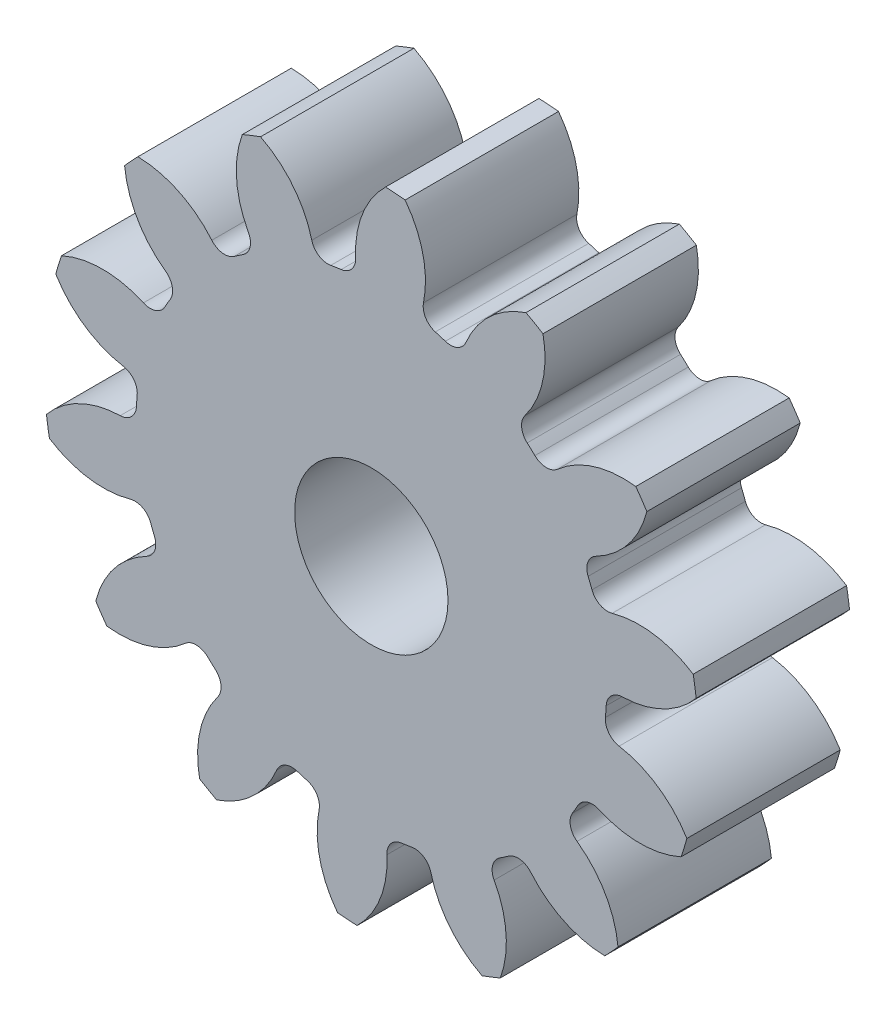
ISO-10303-21;
HEADER;
FILE_DESCRIPTION(('STEP AP214'),'2;1');
FILE_NAME('part.step','',(''),(''),'','','');
FILE_SCHEMA(('AUTOMOTIVE_DESIGN { 1 0 10303 214 1 1 1 1 }'));
ENDSEC;
DATA;
#1=APPLICATION_CONTEXT('core data for automotive mechanical design processes');
#2=APPLICATION_PROTOCOL_DEFINITION('international standard','automotive_design',2000,#1);
#3=PRODUCT_CONTEXT('',#1,'mechanical');
#4=PRODUCT('Part','Part','',(#3));
#5=PRODUCT_RELATED_PRODUCT_CATEGORY('part','',(#4));
#6=PRODUCT_DEFINITION_FORMATION('','',#4);
#7=PRODUCT_DEFINITION_CONTEXT('part definition',#1,'design');
#8=PRODUCT_DEFINITION('design','',#6,#7);
#9=PRODUCT_DEFINITION_SHAPE('','',#8);
#10=(LENGTH_UNIT() NAMED_UNIT(*) SI_UNIT(.MILLI.,.METRE.));
#11=(NAMED_UNIT(*) PLANE_ANGLE_UNIT() SI_UNIT($,.RADIAN.));
#12=(NAMED_UNIT(*) SI_UNIT($,.STERADIAN.) SOLID_ANGLE_UNIT());
#13=UNCERTAINTY_MEASURE_WITH_UNIT(LENGTH_MEASURE(1.E-05),#10,'distance_accuracy_value','');
#14=(GEOMETRIC_REPRESENTATION_CONTEXT(3) GLOBAL_UNCERTAINTY_ASSIGNED_CONTEXT((#13)) GLOBAL_UNIT_ASSIGNED_CONTEXT((#10,
#11,#12)) REPRESENTATION_CONTEXT('',''));
#15=CARTESIAN_POINT('',(0.,0.,0.));
#16=DIRECTION('',(0.,0.,1.));
#17=DIRECTION('',(1.,0.,0.));
#18=AXIS2_PLACEMENT_3D('',#15,#16,#17);
#19=CARTESIAN_POINT('',(0.,0.,127.));
#20=DIRECTION('',(0.,0.,-1.));
#21=DIRECTION('',(-1.,0.,0.));
#22=AXIS2_PLACEMENT_3D('',#19,#20,#21);
#23=CYLINDRICAL_SURFACE('',#22,270.933333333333);
#24=DIRECTION('',(0.,0.,-1.));
#25=VECTOR('',#24,1.);
#26=CARTESIAN_POINT('',(266.514646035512,48.7320691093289,63.5));
#27=LINE('',#26,#25);
#28=CARTESIAN_POINT('',(266.514646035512,48.7320691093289,127.));
#29=VERTEX_POINT('',#28);
#30=CARTESIAN_POINT('',(266.514646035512,48.7320691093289,0.));
#31=VERTEX_POINT('',#30);
#32=EDGE_CURVE('E600',#29,#31,#27,.T.);
#33=ORIENTED_EDGE('',*,*,#32,.F.);
#34=CARTESIAN_POINT('',(0.,0.,127.));
#35=DIRECTION('',(0.,0.,1.));
#36=DIRECTION('',(1.,0.,0.));
#37=AXIS2_PLACEMENT_3D('',#34,#35,#36);
#38=CIRCLE('',#37,270.933333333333);
#39=CARTESIAN_POINT('',(268.956949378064,32.6654326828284,127.));
#40=VERTEX_POINT('',#39);
#41=EDGE_CURVE('E1093',#40,#29,#38,.T.);
#42=ORIENTED_EDGE('',*,*,#41,.F.);
#43=DIRECTION('',(0.,0.,-1.));
#44=VECTOR('',#43,1.);
#45=CARTESIAN_POINT('',(268.956949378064,32.6654326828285,63.5));
#46=LINE('',#45,#44);
#47=CARTESIAN_POINT('',(268.956949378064,32.6654326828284,0.));
#48=VERTEX_POINT('',#47);
#49=EDGE_CURVE('E1087',#48,#40,#46,.F.);
#50=ORIENTED_EDGE('',*,*,#49,.F.);
#51=CARTESIAN_POINT('',(0.,0.,0.));
#52=DIRECTION('',(0.,0.,1.));
#53=DIRECTION('',(1.,0.,0.));
#54=AXIS2_PLACEMENT_3D('',#51,#52,#53);
#55=CIRCLE('',#54,270.933333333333);
#56=EDGE_CURVE('E1098',#48,#31,#55,.T.);
#57=ORIENTED_EDGE('',*,*,#56,.T.);
#58=EDGE_LOOP('',(#33,#42,#50,#57));
#59=FACE_BOUND('',#58,.T.);
#60=ADVANCED_FACE('F33',(#59),#23,.T.);
#61=DIRECTION('',(0.,0.,-1.));
#62=VECTOR('',#61,1.);
#63=CARTESIAN_POINT('',(228.148838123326,146.126584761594,63.5));
#64=LINE('',#63,#62);
#65=CARTESIAN_POINT('',(228.148838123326,146.126584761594,0.));
#66=VERTEX_POINT('',#65);
#67=CARTESIAN_POINT('',(228.148838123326,146.126584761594,127.));
#68=VERTEX_POINT('',#67);
#69=EDGE_CURVE('E571',#66,#68,#64,.F.);
#70=ORIENTED_EDGE('',*,*,#69,.F.);
#71=CARTESIAN_POINT('',(218.977346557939,159.542448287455,0.));
#72=VERTEX_POINT('',#71);
#73=EDGE_CURVE('E1101',#66,#72,#55,.T.);
#74=ORIENTED_EDGE('',*,*,#73,.T.);
#75=DIRECTION('',(0.,0.,-1.));
#76=VECTOR('',#75,1.);
#77=CARTESIAN_POINT('',(218.977346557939,159.542448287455,63.5));
#78=LINE('',#77,#76);
#79=CARTESIAN_POINT('',(218.977346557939,159.542448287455,127.));
#80=VERTEX_POINT('',#79);
#81=EDGE_CURVE('E633',#80,#72,#78,.T.);
#82=ORIENTED_EDGE('',*,*,#81,.F.);
#83=EDGE_CURVE('E1096',#68,#80,#38,.T.);
#84=ORIENTED_EDGE('',*,*,#83,.F.);
#85=EDGE_LOOP('',(#70,#74,#82,#84));
#86=FACE_BOUND('',#85,.T.);
#87=ADVANCED_FACE('F1261',(#86),#23,.T.);
#88=CARTESIAN_POINT('',(0.,0.,127.));
#89=DIRECTION('',(0.,0.,1.));
#90=DIRECTION('',(1.,0.,0.));
#91=AXIS2_PLACEMENT_3D('',#88,#89,#90);
#92=PLANE('',#91);
#93=CARTESIAN_POINT('',(0.,0.,127.000000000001));
#94=DIRECTION('',(0.,0.,1.));
#95=DIRECTION('',(1.,0.,0.));
#96=AXIS2_PLACEMENT_3D('',#93,#94,#95);
#97=CIRCLE('',#96,63.5);
#98=CARTESIAN_POINT('',(63.5,0.,127.000000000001));
#99=VERTEX_POINT('',#98);
#100=EDGE_CURVE('E588',#99,#99,#97,.T.);
#101=ORIENTED_EDGE('',*,*,#100,.F.);
#102=EDGE_LOOP('',(#101));
#103=FACE_BOUND('',#102,.T.);
#104=ORIENTED_EDGE('',*,*,#41,.T.);
#105=CARTESIAN_POINT('',(221.848316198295,-20.2412250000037,127.));
#106=DIRECTION('',(0.,0.,-1.));
#107=DIRECTION('',(0.900968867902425,0.433883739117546,0.));
#108=AXIS2_PLACEMENT_3D('',#105,#106,#107);
#109=CIRCLE('',#108,82.1729658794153);
#110=CARTESIAN_POINT('',(199.425906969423,58.8133883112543,127.));
#111=VERTEX_POINT('',#110);
#112=EDGE_CURVE('E580',#111,#29,#109,.T.);
#113=ORIENTED_EDGE('',*,*,#112,.F.);
#114=CARTESIAN_POINT('',(195.664761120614,72.0740476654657,127.));
#115=DIRECTION('',(0.,0.,1.));
#116=DIRECTION('',(-0.900968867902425,-0.433883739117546,0.));
#117=AXIS2_PLACEMENT_3D('',#114,#115,#116);
#118=CIRCLE('',#117,13.7837333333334);
#119=CARTESIAN_POINT('',(182.730611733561,67.3096920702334,127.));
#120=VERTEX_POINT('',#119);
#121=EDGE_CURVE('E578',#120,#111,#118,.T.);
#122=ORIENTED_EDGE('',*,*,#121,.F.);
#123=CARTESIAN_POINT('',(0.,0.,127.));
#124=DIRECTION('',(0.,0.,-1.));
#125=DIRECTION('',(0.900968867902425,0.433883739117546,0.));
#126=AXIS2_PLACEMENT_3D('',#123,#124,#125);
#127=CIRCLE('',#126,194.733333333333);
#128=CARTESIAN_POINT('',(179.544350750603,75.3982574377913,127.));
#129=VERTEX_POINT('',#128);
#130=EDGE_CURVE('E563',#129,#120,#127,.T.);
#131=ORIENTED_EDGE('',*,*,#130,.F.);
#132=CARTESIAN_POINT('',(192.252968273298,80.7351427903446,127.));
#133=DIRECTION('',(0.,0.,1.));
#134=DIRECTION('',(-0.900968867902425,-0.433883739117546,0.));
#135=AXIS2_PLACEMENT_3D('',#132,#133,#134);
#136=CIRCLE('',#135,13.7837333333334);
#137=CARTESIAN_POINT('',(185.959711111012,92.9983486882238,127.));
#138=VERTEX_POINT('',#137);
#139=EDGE_CURVE('E555',#138,#129,#136,.T.);
#140=ORIENTED_EDGE('',*,*,#139,.F.);
#141=CARTESIAN_POINT('',(148.441892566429,166.106553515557,127.));
#142=DIRECTION('',(0.,0.,-1.));
#143=DIRECTION('',(-0.900968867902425,-0.433883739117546,0.));
#144=AXIS2_PLACEMENT_3D('',#141,#142,#143);
#145=CIRCLE('',#144,82.1729658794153);
#146=EDGE_CURVE('E585',#68,#138,#145,.T.);
#147=ORIENTED_EDGE('',*,*,#146,.F.);
#148=ORIENTED_EDGE('',*,*,#83,.T.);
#149=CARTESIAN_POINT('',(208.660764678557,78.0196633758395,127.));
#150=DIRECTION('',(0.,0.,-1.));
#151=DIRECTION('',(0.623489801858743,0.781831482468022,0.));
#152=AXIS2_PLACEMENT_3D('',#149,#150,#151);
#153=CIRCLE('',#152,82.1729658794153);
#154=CARTESIAN_POINT('',(154.158360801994,139.5166900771,127.));
#155=VERTEX_POINT('',#154);
#156=EDGE_CURVE('E609',#155,#80,#153,.T.);
#157=ORIENTED_EDGE('',*,*,#156,.F.);
#158=CARTESIAN_POINT('',(145.016101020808,149.832231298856,127.));
#159=DIRECTION('',(0.,0.,1.));
#160=DIRECTION('',(-0.623489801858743,-0.781831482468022,0.));
#161=AXIS2_PLACEMENT_3D('',#158,#159,#160);
#162=CIRCLE('',#161,13.7837333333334);
#163=CARTESIAN_POINT('',(135.430011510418,139.927778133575,127.));
#164=VERTEX_POINT('',#163);
#165=EDGE_CURVE('E607',#164,#155,#162,.T.);
#166=ORIENTED_EDGE('',*,*,#165,.F.);
#167=CARTESIAN_POINT('',(0.,0.,127.));
#168=DIRECTION('',(0.,0.,-1.));
#169=DIRECTION('',(0.623489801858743,0.781831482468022,0.));
#170=AXIS2_PLACEMENT_3D('',#167,#168,#169);
#171=CIRCLE('',#170,194.733333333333);
#172=CARTESIAN_POINT('',(129.049792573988,145.832856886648,127.));
#173=VERTEX_POINT('',#172);
#174=EDGE_CURVE('E604',#173,#164,#171,.T.);
#175=ORIENTED_EDGE('',*,*,#174,.F.);
#176=CARTESIAN_POINT('',(138.184273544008,156.155286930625,127.));
#177=DIRECTION('',(0.,0.,1.));
#178=DIRECTION('',(-0.623489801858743,-0.781831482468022,0.));
#179=AXIS2_PLACEMENT_3D('',#176,#177,#178);
#180=CIRCLE('',#179,13.7837333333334);
#181=CARTESIAN_POINT('',(127.193439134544,164.47351171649,127.));
#182=VERTEX_POINT('',#181);
#183=EDGE_CURVE('E602',#182,#173,#180,.T.);
#184=ORIENTED_EDGE('',*,*,#183,.F.);
#185=CARTESIAN_POINT('',(61.6705913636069,214.063356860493,127.));
#186=DIRECTION('',(0.,0.,-1.));
#187=DIRECTION('',(-0.623489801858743,-0.781831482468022,0.));
#188=AXIS2_PLACEMENT_3D('',#185,#186,#187);
#189=CIRCLE('',#188,82.1729658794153);
#190=CARTESIAN_POINT('',(142.153051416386,230.645574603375,127.));
#191=VERTEX_POINT('',#190);
#192=EDGE_CURVE('E612',#191,#182,#189,.T.);
#193=ORIENTED_EDGE('',*,*,#192,.F.);
#194=CARTESIAN_POINT('',(128.06889801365,238.753488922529,127.));
#195=VERTEX_POINT('',#194);
#196=EDGE_CURVE('E1137',#191,#195,#38,.T.);
#197=ORIENTED_EDGE('',*,*,#196,.T.);
#198=CARTESIAN_POINT('',(154.14538965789,160.82780057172,127.));
#199=DIRECTION('',(0.,0.,-1.));
#200=DIRECTION('',(0.222520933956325,0.974927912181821,0.));
#201=AXIS2_PLACEMENT_3D('',#198,#199,#200);
#202=CIRCLE('',#201,82.1729658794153);
#203=CARTESIAN_POINT('',(78.3578606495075,192.58700031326,127.));
#204=VERTEX_POINT('',#203);
#205=EDGE_CURVE('E644',#204,#195,#202,.T.);
#206=ORIENTED_EDGE('',*,*,#205,.F.);
#207=CARTESIAN_POINT('',(65.6452236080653,197.914303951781,127.));
#208=DIRECTION('',(0.,0.,1.));
#209=DIRECTION('',(-0.222520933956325,-0.974927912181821,0.));
#210=AXIS2_PLACEMENT_3D('',#207,#208,#209);
#211=CIRCLE('',#210,13.7837333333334);
#212=CARTESIAN_POINT('',(61.3058365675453,184.831451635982,127.));
#213=VERTEX_POINT('',#212);
#214=EDGE_CURVE('E642',#213,#204,#211,.T.);
#215=ORIENTED_EDGE('',*,*,#214,.F.);
#216=CARTESIAN_POINT('',(0.,0.,127.));
#217=DIRECTION('',(0.,0.,-1.));
#218=DIRECTION('',(0.222520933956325,0.974927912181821,0.));
#219=AXIS2_PLACEMENT_3D('',#216,#217,#218);
#220=CIRCLE('',#219,194.733333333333);
#221=CARTESIAN_POINT('',(52.9953402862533,187.383470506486,127.));
#222=VERTEX_POINT('',#221);
#223=EDGE_CURVE('E639',#222,#213,#220,.T.);
#224=ORIENTED_EDGE('',*,*,#223,.F.);
#225=CARTESIAN_POINT('',(56.746488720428,200.64696137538,127.));
#226=DIRECTION('',(0.,0.,1.));
#227=DIRECTION('',(-0.222520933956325,-0.974927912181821,0.));
#228=AXIS2_PLACEMENT_3D('',#225,#226,#227);
#229=CIRCLE('',#228,13.7837333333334);
#230=CARTESIAN_POINT('',(43.2349466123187,203.372678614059,127.));
#231=VERTEX_POINT('',#230);
#232=EDGE_CURVE('E637',#231,#222,#229,.T.);
#233=ORIENTED_EDGE('',*,*,#232,.F.);
#234=CARTESIAN_POINT('',(-37.3153267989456,219.622287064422,127.));
#235=DIRECTION('',(0.,0.,-1.));
#236=DIRECTION('',(-0.222520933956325,-0.974927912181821,0.));
#237=AXIS2_PLACEMENT_3D('',#234,#235,#236);
#238=CIRCLE('',#237,82.1729658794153);
#239=CARTESIAN_POINT('',(28.0021094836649,269.482379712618,127.));
#240=VERTEX_POINT('',#239);
#241=EDGE_CURVE('E647',#240,#231,#238,.T.);
#242=ORIENTED_EDGE('',*,*,#241,.F.);
#243=CARTESIAN_POINT('',(11.7948335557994,270.676472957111,127.));
#244=VERTEX_POINT('',#243);
#245=EDGE_CURVE('E1243',#240,#244,#38,.T.);
#246=ORIENTED_EDGE('',*,*,#245,.T.);
#247=CARTESIAN_POINT('',(69.0996297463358,211.782019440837,127.));
#248=DIRECTION('',(0.,0.,-1.));
#249=DIRECTION('',(-0.222520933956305,0.974927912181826,0.));
#250=AXIS2_PLACEMENT_3D('',#247,#248,#249);
#251=CIRCLE('',#250,82.1729658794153);
#252=CARTESIAN_POINT('',(-12.9623748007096,207.513093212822,127.));
#253=VERTEX_POINT('',#252);
#254=EDGE_CURVE('E682',#253,#244,#251,.T.);
#255=ORIENTED_EDGE('',*,*,#254,.F.);
#256=CARTESIAN_POINT('',(-26.7274954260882,206.797021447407,127.));
#257=DIRECTION('',(0.,0.,1.));
#258=DIRECTION('',(0.222520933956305,-0.974927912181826,0.));
#259=AXIS2_PLACEMENT_3D('',#256,#257,#258);
#260=CIRCLE('',#259,13.7837333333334);
#261=CARTESIAN_POINT('',(-24.9607111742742,193.126989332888,127.));
#262=VERTEX_POINT('',#261);
#263=EDGE_CURVE('E680',#262,#253,#260,.T.);
#264=ORIENTED_EDGE('',*,*,#263,.F.);
#265=CARTESIAN_POINT('',(0.,0.,127.));
#266=DIRECTION('',(0.,0.,-1.));
#267=DIRECTION('',(-0.222520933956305,0.974927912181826,0.));
#268=AXIS2_PLACEMENT_3D('',#265,#266,#267);
#269=CIRCLE('',#268,194.733333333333);
#270=CARTESIAN_POINT('',(-33.5554890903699,191.820489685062,127.));
#271=VERTEX_POINT('',#270);
#272=EDGE_CURVE('E677',#271,#262,#269,.T.);
#273=ORIENTED_EDGE('',*,*,#272,.F.);
#274=CARTESIAN_POINT('',(-35.9306341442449,205.398044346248,127.));
#275=DIRECTION('',(0.,0.,1.));
#276=DIRECTION('',(0.222520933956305,-0.974927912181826,0.));
#277=AXIS2_PLACEMENT_3D('',#274,#275,#276);
#278=CIRCLE('',#277,13.7837333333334);
#279=CARTESIAN_POINT('',(-49.2867573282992,201.991392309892,127.));
#280=VERTEX_POINT('',#279);
#281=EDGE_CURVE('E675',#280,#271,#278,.T.);
#282=ORIENTED_EDGE('',*,*,#281,.F.);
#283=CARTESIAN_POINT('',(-128.910486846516,181.682329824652,127.));
#284=DIRECTION('',(0.,0.,-1.));
#285=DIRECTION('',(0.222520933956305,-0.974927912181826,0.));
#286=AXIS2_PLACEMENT_3D('',#283,#284,#285);
#287=CIRCLE('',#286,82.1729658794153);
#288=CARTESIAN_POINT('',(-91.6949936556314,254.944894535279,127.));
#289=VERTEX_POINT('',#288);
#290=EDGE_CURVE('E685',#289,#280,#287,.T.);
#291=ORIENTED_EDGE('',*,*,#290,.F.);
#292=CARTESIAN_POINT('',(-106.815342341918,248.988661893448,127.));
#293=VERTEX_POINT('',#292);
#294=EDGE_CURVE('E1239',#289,#293,#38,.T.);
#295=ORIENTED_EDGE('',*,*,#294,.T.);
#296=CARTESIAN_POINT('',(-29.6321592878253,220.790212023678,127.));
#297=DIRECTION('',(0.,0.,-1.));
#298=DIRECTION('',(-0.623489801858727,0.781831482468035,0.));
#299=AXIS2_PLACEMENT_3D('',#296,#297,#298);
#300=CIRCLE('',#299,82.1729658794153);
#301=CARTESIAN_POINT('',(-101.715252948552,181.33867302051,127.));
#302=VERTEX_POINT('',#301);
#303=EDGE_CURVE('E720',#302,#293,#300,.T.);
#304=ORIENTED_EDGE('',*,*,#303,.F.);
#305=CARTESIAN_POINT('',(-113.806506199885,174.721052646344,127.));
#306=DIRECTION('',(0.,0.,1.));
#307=DIRECTION('',(0.623489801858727,-0.781831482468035,0.));
#308=AXIS2_PLACEMENT_3D('',#305,#306,#307);
#309=CIRCLE('',#308,13.7837333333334);
#310=CARTESIAN_POINT('',(-106.283483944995,163.171358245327,127.));
#311=VERTEX_POINT('',#310);
#312=EDGE_CURVE('E718',#311,#302,#309,.T.);
#313=ORIENTED_EDGE('',*,*,#312,.F.);
#314=CARTESIAN_POINT('',(0.,0.,127.));
#315=DIRECTION('',(0.,0.,-1.));
#316=DIRECTION('',(-0.623489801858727,0.781831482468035,0.));
#317=AXIS2_PLACEMENT_3D('',#314,#315,#316);
#318=CIRCLE('',#317,194.733333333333);
#319=CARTESIAN_POINT('',(-113.460242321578,158.26510835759,127.));
#320=VERTEX_POINT('',#319);
#321=EDGE_CURVE('E715',#320,#311,#318,.T.);
#322=ORIENTED_EDGE('',*,*,#321,.F.);
#323=CARTESIAN_POINT('',(-121.491254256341,169.46752559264,127.));
#324=DIRECTION('',(0.,0.,1.));
#325=DIRECTION('',(0.623489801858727,-0.781831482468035,0.));
#326=AXIS2_PLACEMENT_3D('',#323,#324,#325);
#327=CIRCLE('',#326,13.7837333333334);
#328=CARTESIAN_POINT('',(-132.046614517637,160.603233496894,127.));
#329=VERTEX_POINT('',#328);
#330=EDGE_CURVE('E713',#329,#320,#327,.T.);
#331=ORIENTED_EDGE('',*,*,#330,.F.);
#332=CARTESIAN_POINT('',(-194.973343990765,107.75795897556,127.));
#333=DIRECTION('',(0.,0.,-1.));
#334=DIRECTION('',(0.623489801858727,-0.781831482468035,0.));
#335=AXIS2_PLACEMENT_3D('',#332,#333,#334);
#336=CIRCLE('',#335,82.1729658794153);
#337=CARTESIAN_POINT('',(-193.230778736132,189.912446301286,127.));
#338=VERTEX_POINT('',#337);
#339=EDGE_CURVE('E723',#338,#329,#336,.T.);
#340=ORIENTED_EDGE('',*,*,#339,.F.);
#341=CARTESIAN_POINT('',(-204.269429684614,177.985592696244,127.));
#342=VERTEX_POINT('',#341);
#343=EDGE_CURVE('E1235',#338,#342,#38,.T.);
#344=ORIENTED_EDGE('',*,*,#343,.T.);
#345=CARTESIAN_POINT('',(-122.494935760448,186.068195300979,127.));
#346=DIRECTION('',(0.,0.,-1.));
#347=DIRECTION('',(-0.900968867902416,0.433883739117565,0.));
#348=AXIS2_PLACEMENT_3D('',#345,#346,#347);
#349=CIRCLE('',#348,82.1729658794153);
#350=CARTESIAN_POINT('',(-170.32217779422,119.24790466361,127.));
#351=VERTEX_POINT('',#350);
#352=EDGE_CURVE('E758',#351,#342,#349,.T.);
#353=ORIENTED_EDGE('',*,*,#352,.F.);
#354=CARTESIAN_POINT('',(-178.344742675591,108.039436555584,127.));
#355=DIRECTION('',(0.,0.,1.));
#356=DIRECTION('',(0.900968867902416,-0.433883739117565,0.));
#357=AXIS2_PLACEMENT_3D('',#354,#355,#356);
#358=CIRCLE('',#357,13.7837333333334);
#359=CARTESIAN_POINT('',(-166.555509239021,100.897638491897,127.));
#360=VERTEX_POINT('',#359);
#361=EDGE_CURVE('E756',#360,#351,#358,.T.);
#362=ORIENTED_EDGE('',*,*,#361,.F.);
#363=CARTESIAN_POINT('',(0.,0.,127.));
#364=DIRECTION('',(0.,0.,-1.));
#365=DIRECTION('',(-0.900968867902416,0.433883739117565,0.));
#366=AXIS2_PLACEMENT_3D('',#363,#364,#365);
#367=CIRCLE('',#366,194.733333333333);
#368=CARTESIAN_POINT('',(-170.892803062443,93.3633813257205,127.));
#369=VERTEX_POINT('',#368);
#370=EDGE_CURVE('E753',#369,#360,#367,.T.);
#371=ORIENTED_EDGE('',*,*,#370,.F.);
#372=CARTESIAN_POINT('',(-182.989041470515,99.971885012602,127.));
#373=DIRECTION('',(0.,0.,1.));
#374=DIRECTION('',(0.900968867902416,-0.433883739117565,0.));
#375=AXIS2_PLACEMENT_3D('',#372,#373,#374);
#376=CIRCLE('',#375,13.7837333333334);
#377=CARTESIAN_POINT('',(-188.653020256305,87.4056346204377,127.));
#378=VERTEX_POINT('',#377);
#379=EDGE_CURVE('E751',#378,#369,#376,.T.);
#380=ORIENTED_EDGE('',*,*,#379,.F.);
#381=CARTESIAN_POINT('',(-222.419339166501,12.490802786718,127.));
#382=DIRECTION('',(0.,0.,-1.));
#383=DIRECTION('',(0.900968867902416,-0.433883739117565,0.));
#384=AXIS2_PLACEMENT_3D('',#381,#382,#383);
#385=CIRCLE('',#384,82.1729658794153);
#386=CARTESIAN_POINT('',(-256.49483826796,87.2655089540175,127.));
#387=VERTEX_POINT('',#386);
#388=EDGE_CURVE('E761',#387,#378,#385,.T.);
#389=ORIENTED_EDGE('',*,*,#388,.F.);
#390=CARTESIAN_POINT('',(-261.265451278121,71.7302940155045,127.));
#391=VERTEX_POINT('',#390);
#392=EDGE_CURVE('E1231',#387,#391,#38,.T.);
#393=ORIENTED_EDGE('',*,*,#392,.T.);
#394=CARTESIAN_POINT('',(-191.096087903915,114.493090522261,127.));
#395=DIRECTION('',(0.,0.,-1.));
#396=DIRECTION('',(-1.,0.,0.));
#397=AXIS2_PLACEMENT_3D('',#394,#395,#396);
#398=CIRCLE('',#397,82.1729658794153);
#399=CARTESIAN_POINT('',(-205.194706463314,33.5386263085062,127.));
#400=VERTEX_POINT('',#399);
#401=EDGE_CURVE('E796',#400,#391,#398,.T.);
#402=ORIENTED_EDGE('',*,*,#401,.F.);
#403=CARTESIAN_POINT('',(-207.559615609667,19.9592850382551,127.));
#404=DIRECTION('',(0.,0.,1.));
#405=DIRECTION('',(1.,0.,0.));
#406=AXIS2_PLACEMENT_3D('',#403,#404,#405);
#407=CIRCLE('',#406,13.7837333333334);
#408=CARTESIAN_POINT('',(-193.839173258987,18.6399040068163,127.));
#409=VERTEX_POINT('',#408);
#410=EDGE_CURVE('E794',#409,#400,#407,.T.);
#411=ORIENTED_EDGE('',*,*,#410,.F.);
#412=CARTESIAN_POINT('',(0.,0.,127.));
#413=DIRECTION('',(0.,0.,-1.));
#414=DIRECTION('',(-1.,0.,0.));
#415=AXIS2_PLACEMENT_3D('',#412,#413,#414);
#416=CIRCLE('',#415,194.733333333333);
#417=CARTESIAN_POINT('',(-194.477948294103,9.96989159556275,127.));
#418=VERTEX_POINT('',#417);
#419=EDGE_CURVE('E791',#418,#409,#416,.T.);
#420=ORIENTED_EDGE('',*,*,#419,.F.);
#421=CARTESIAN_POINT('',(-208.243604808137,10.6755865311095,127.));
#422=DIRECTION('',(0.,0.,1.));
#423=DIRECTION('',(1.,0.,0.));
#424=AXIS2_PLACEMENT_3D('',#421,#422,#423);
#425=CIRCLE('',#424,13.7837333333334);
#426=CARTESIAN_POINT('',(-207.894381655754,-3.10372215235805,127.));
#427=VERTEX_POINT('',#426);
#428=EDGE_CURVE('E789',#427,#418,#425,.T.);
#429=ORIENTED_EDGE('',*,*,#428,.F.);
#430=CARTESIAN_POINT('',(-205.812456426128,-85.2503100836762,127.));
#431=DIRECTION('',(0.,0.,-1.));
#432=DIRECTION('',(1.,0.,0.));
#433=AXIS2_PLACEMENT_3D('',#430,#431,#432);
#434=CIRCLE('',#433,82.1729658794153);
#435=CARTESIAN_POINT('',(-268.956949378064,-32.6654326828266,127.));
#436=VERTEX_POINT('',#435);
#437=EDGE_CURVE('E799',#436,#427,#434,.T.);
#438=ORIENTED_EDGE('',*,*,#437,.F.);
#439=CARTESIAN_POINT('',(-266.514646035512,-48.7320691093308,127.));
#440=VERTEX_POINT('',#439);
#441=EDGE_CURVE('E1227',#436,#440,#38,.T.);
#442=ORIENTED_EDGE('',*,*,#441,.T.);
#443=CARTESIAN_POINT('',(-221.848316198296,20.2412250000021,127.));
#444=DIRECTION('',(0.,0.,-1.));
#445=DIRECTION('',(-0.900968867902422,-0.433883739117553,0.));
#446=AXIS2_PLACEMENT_3D('',#443,#444,#445);
#447=CIRCLE('',#446,82.1729658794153);
#448=CARTESIAN_POINT('',(-199.425906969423,-58.8133883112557,127.));
#449=VERTEX_POINT('',#448);
#450=EDGE_CURVE('E834',#449,#440,#447,.T.);
#451=ORIENTED_EDGE('',*,*,#450,.F.);
#452=CARTESIAN_POINT('',(-195.664761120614,-72.0740476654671,127.));
#453=DIRECTION('',(0.,0.,1.));
#454=DIRECTION('',(0.900968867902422,0.433883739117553,0.));
#455=AXIS2_PLACEMENT_3D('',#452,#453,#454);
#456=CIRCLE('',#455,13.7837333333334);
#457=CARTESIAN_POINT('',(-182.73061173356,-67.3096920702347,127.));
#458=VERTEX_POINT('',#457);
#459=EDGE_CURVE('E832',#458,#449,#456,.T.);
#460=ORIENTED_EDGE('',*,*,#459,.F.);
#461=CARTESIAN_POINT('',(0.,0.,127.));
#462=DIRECTION('',(0.,0.,-1.));
#463=DIRECTION('',(-0.900968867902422,-0.433883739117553,0.));
#464=AXIS2_PLACEMENT_3D('',#461,#462,#463);
#465=CIRCLE('',#464,194.733333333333);
#466=CARTESIAN_POINT('',(-179.544350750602,-75.3982574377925,127.));
#467=VERTEX_POINT('',#466);
#468=EDGE_CURVE('E829',#467,#458,#465,.T.);
#469=ORIENTED_EDGE('',*,*,#468,.F.);
#470=CARTESIAN_POINT('',(-192.252968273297,-80.7351427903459,127.));
#471=DIRECTION('',(0.,0.,1.));
#472=DIRECTION('',(0.900968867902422,0.433883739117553,0.));
#473=AXIS2_PLACEMENT_3D('',#470,#471,#472);
#474=CIRCLE('',#473,13.7837333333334);
#475=CARTESIAN_POINT('',(-185.959711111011,-92.9983486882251,127.));
#476=VERTEX_POINT('',#475);
#477=EDGE_CURVE('E827',#476,#467,#474,.T.);
#478=ORIENTED_EDGE('',*,*,#477,.F.);
#479=CARTESIAN_POINT('',(-148.441892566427,-166.106553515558,127.));
#480=DIRECTION('',(0.,0.,-1.));
#481=DIRECTION('',(0.900968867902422,0.433883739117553,0.));
#482=AXIS2_PLACEMENT_3D('',#479,#480,#481);
#483=CIRCLE('',#482,82.1729658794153);
#484=CARTESIAN_POINT('',(-228.148838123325,-146.126584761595,127.));
#485=VERTEX_POINT('',#484);
#486=EDGE_CURVE('E837',#485,#476,#483,.T.);
#487=ORIENTED_EDGE('',*,*,#486,.F.);
#488=CARTESIAN_POINT('',(-218.977346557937,-159.542448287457,127.));
#489=VERTEX_POINT('',#488);
#490=EDGE_CURVE('E1223',#485,#489,#38,.T.);
#491=ORIENTED_EDGE('',*,*,#490,.T.);
#492=CARTESIAN_POINT('',(-208.660764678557,-78.0196633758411,127.));
#493=DIRECTION('',(0.,0.,-1.));
#494=DIRECTION('',(-0.623489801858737,-0.781831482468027,0.));
#495=AXIS2_PLACEMENT_3D('',#492,#493,#494);
#496=CIRCLE('',#495,82.1729658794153);
#497=CARTESIAN_POINT('',(-154.158360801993,-139.516690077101,127.));
#498=VERTEX_POINT('',#497);
#499=EDGE_CURVE('E872',#498,#489,#496,.T.);
#500=ORIENTED_EDGE('',*,*,#499,.F.);
#501=CARTESIAN_POINT('',(-145.016101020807,-149.832231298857,127.));
#502=DIRECTION('',(0.,0.,1.));
#503=DIRECTION('',(0.623489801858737,0.781831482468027,0.));
#504=AXIS2_PLACEMENT_3D('',#501,#502,#503);
#505=CIRCLE('',#504,13.7837333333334);
#506=CARTESIAN_POINT('',(-135.430011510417,-139.927778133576,127.));
#507=VERTEX_POINT('',#506);
#508=EDGE_CURVE('E870',#507,#498,#505,.T.);
#509=ORIENTED_EDGE('',*,*,#508,.F.);
#510=CARTESIAN_POINT('',(0.,0.,127.));
#511=DIRECTION('',(0.,0.,-1.));
#512=DIRECTION('',(-0.623489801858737,-0.781831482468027,0.));
#513=AXIS2_PLACEMENT_3D('',#510,#511,#512);
#514=CIRCLE('',#513,194.733333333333);
#515=CARTESIAN_POINT('',(-129.049792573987,-145.832856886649,127.));
#516=VERTEX_POINT('',#515);
#517=EDGE_CURVE('E867',#516,#507,#514,.T.);
#518=ORIENTED_EDGE('',*,*,#517,.F.);
#519=CARTESIAN_POINT('',(-138.184273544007,-156.155286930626,127.));
#520=DIRECTION('',(0.,0.,1.));
#521=DIRECTION('',(0.623489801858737,0.781831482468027,0.));
#522=AXIS2_PLACEMENT_3D('',#519,#520,#521);
#523=CIRCLE('',#522,13.7837333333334);
#524=CARTESIAN_POINT('',(-127.193439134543,-164.473511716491,127.));
#525=VERTEX_POINT('',#524);
#526=EDGE_CURVE('E865',#525,#516,#523,.T.);
#527=ORIENTED_EDGE('',*,*,#526,.F.);
#528=CARTESIAN_POINT('',(-61.6705913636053,-214.063356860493,127.));
#529=DIRECTION('',(0.,0.,-1.));
#530=DIRECTION('',(0.623489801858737,0.781831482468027,0.));
#531=AXIS2_PLACEMENT_3D('',#528,#529,#530);
#532=CIRCLE('',#531,82.1729658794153);
#533=CARTESIAN_POINT('',(-142.153051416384,-230.645574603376,127.));
#534=VERTEX_POINT('',#533);
#535=EDGE_CURVE('E875',#534,#525,#532,.T.);
#536=ORIENTED_EDGE('',*,*,#535,.F.);
#537=CARTESIAN_POINT('',(-128.068898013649,-238.75348892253,127.));
#538=VERTEX_POINT('',#537);
#539=EDGE_CURVE('E1219',#534,#538,#38,.T.);
#540=ORIENTED_EDGE('',*,*,#539,.T.);
#541=CARTESIAN_POINT('',(-154.145389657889,-160.827800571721,127.));
#542=DIRECTION('',(0.,0.,-1.));
#543=DIRECTION('',(-0.222520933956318,-0.974927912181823,0.));
#544=AXIS2_PLACEMENT_3D('',#541,#542,#543);
#545=CIRCLE('',#544,82.1729658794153);
#546=CARTESIAN_POINT('',(-78.3578606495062,-192.587000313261,127.));
#547=VERTEX_POINT('',#546);
#548=EDGE_CURVE('E910',#547,#538,#545,.T.);
#549=ORIENTED_EDGE('',*,*,#548,.F.);
#550=CARTESIAN_POINT('',(-65.645223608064,-197.914303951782,127.));
#551=DIRECTION('',(0.,0.,1.));
#552=DIRECTION('',(0.222520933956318,0.974927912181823,0.));
#553=AXIS2_PLACEMENT_3D('',#550,#551,#552);
#554=CIRCLE('',#553,13.7837333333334);
#555=CARTESIAN_POINT('',(-61.3058365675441,-184.831451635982,127.));
#556=VERTEX_POINT('',#555);
#557=EDGE_CURVE('E908',#556,#547,#554,.T.);
#558=ORIENTED_EDGE('',*,*,#557,.F.);
#559=CARTESIAN_POINT('',(0.,0.,127.));
#560=DIRECTION('',(0.,0.,-1.));
#561=DIRECTION('',(-0.222520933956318,-0.974927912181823,0.));
#562=AXIS2_PLACEMENT_3D('',#559,#560,#561);
#563=CIRCLE('',#562,194.733333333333);
#564=CARTESIAN_POINT('',(-52.9953402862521,-187.383470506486,127.));
#565=VERTEX_POINT('',#564);
#566=EDGE_CURVE('E905',#565,#556,#563,.T.);
#567=ORIENTED_EDGE('',*,*,#566,.F.);
#568=CARTESIAN_POINT('',(-56.7464887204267,-200.64696137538,127.));
#569=DIRECTION('',(0.,0.,1.));
#570=DIRECTION('',(0.222520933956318,0.974927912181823,0.));
#571=AXIS2_PLACEMENT_3D('',#568,#569,#570);
#572=CIRCLE('',#571,13.7837333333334);
#573=CARTESIAN_POINT('',(-43.2349466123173,-203.372678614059,127.));
#574=VERTEX_POINT('',#573);
#575=EDGE_CURVE('E903',#574,#565,#572,.T.);
#576=ORIENTED_EDGE('',*,*,#575,.F.);
#577=CARTESIAN_POINT('',(37.315326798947,-219.622287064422,127.));
#578=DIRECTION('',(0.,0.,-1.));
#579=DIRECTION('',(0.222520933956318,0.974927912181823,0.));
#580=AXIS2_PLACEMENT_3D('',#577,#578,#579);
#581=CIRCLE('',#580,82.1729658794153);
#582=CARTESIAN_POINT('',(-28.0021094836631,-269.482379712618,127.));
#583=VERTEX_POINT('',#582);
#584=EDGE_CURVE('E913',#583,#574,#581,.T.);
#585=ORIENTED_EDGE('',*,*,#584,.F.);
#586=CARTESIAN_POINT('',(-11.7948335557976,-270.676472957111,127.));
#587=VERTEX_POINT('',#586);
#588=EDGE_CURVE('E1215',#583,#587,#38,.T.);
#589=ORIENTED_EDGE('',*,*,#588,.T.);
#590=CARTESIAN_POINT('',(-69.0996297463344,-211.782019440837,127.));
#591=DIRECTION('',(0.,0.,-1.));
#592=DIRECTION('',(0.222520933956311,-0.974927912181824,0.));
#593=AXIS2_PLACEMENT_3D('',#590,#591,#592);
#594=CIRCLE('',#593,82.1729658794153);
#595=CARTESIAN_POINT('',(12.962374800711,-207.513093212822,127.));
#596=VERTEX_POINT('',#595);
#597=EDGE_CURVE('E948',#596,#587,#594,.T.);
#598=ORIENTED_EDGE('',*,*,#597,.F.);
#599=CARTESIAN_POINT('',(26.7274954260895,-206.797021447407,127.));
#600=DIRECTION('',(0.,0.,1.));
#601=DIRECTION('',(-0.222520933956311,0.974927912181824,0.));
#602=AXIS2_PLACEMENT_3D('',#599,#600,#601);
#603=CIRCLE('',#602,13.7837333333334);
#604=CARTESIAN_POINT('',(24.9607111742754,-193.126989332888,127.));
#605=VERTEX_POINT('',#604);
#606=EDGE_CURVE('E946',#605,#596,#603,.T.);
#607=ORIENTED_EDGE('',*,*,#606,.F.);
#608=CARTESIAN_POINT('',(0.,0.,127.));
#609=DIRECTION('',(0.,0.,-1.));
#610=DIRECTION('',(0.222520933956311,-0.974927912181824,0.));
#611=AXIS2_PLACEMENT_3D('',#608,#609,#610);
#612=CIRCLE('',#611,194.733333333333);
#613=CARTESIAN_POINT('',(33.5554890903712,-191.820489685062,127.));
#614=VERTEX_POINT('',#613);
#615=EDGE_CURVE('E943',#614,#605,#612,.T.);
#616=ORIENTED_EDGE('',*,*,#615,.F.);
#617=CARTESIAN_POINT('',(35.9306341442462,-205.398044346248,127.));
#618=DIRECTION('',(0.,0.,1.));
#619=DIRECTION('',(-0.222520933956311,0.974927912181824,0.));
#620=AXIS2_PLACEMENT_3D('',#617,#618,#619);
#621=CIRCLE('',#620,13.7837333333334);
#622=CARTESIAN_POINT('',(49.2867573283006,-201.991392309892,127.));
#623=VERTEX_POINT('',#622);
#624=EDGE_CURVE('E941',#623,#614,#621,.T.);
#625=ORIENTED_EDGE('',*,*,#624,.F.);
#626=CARTESIAN_POINT('',(128.910486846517,-181.682329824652,127.));
#627=DIRECTION('',(0.,0.,-1.));
#628=DIRECTION('',(-0.222520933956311,0.974927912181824,0.));
#629=AXIS2_PLACEMENT_3D('',#626,#627,#628);
#630=CIRCLE('',#629,82.1729658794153);
#631=CARTESIAN_POINT('',(91.694993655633,-254.944894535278,127.));
#632=VERTEX_POINT('',#631);
#633=EDGE_CURVE('E951',#632,#623,#630,.T.);
#634=ORIENTED_EDGE('',*,*,#633,.F.);
#635=CARTESIAN_POINT('',(106.81534234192,-248.988661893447,127.));
#636=VERTEX_POINT('',#635);
#637=EDGE_CURVE('E1211',#632,#636,#38,.T.);
#638=ORIENTED_EDGE('',*,*,#637,.T.);
#639=CARTESIAN_POINT('',(29.6321592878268,-220.790212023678,127.));
#640=DIRECTION('',(0.,0.,-1.));
#641=DIRECTION('',(0.623489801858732,-0.781831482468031,0.));
#642=AXIS2_PLACEMENT_3D('',#639,#640,#641);
#643=CIRCLE('',#642,82.1729658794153);
#644=CARTESIAN_POINT('',(101.715252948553,-181.338673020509,127.));
#645=VERTEX_POINT('',#644);
#646=EDGE_CURVE('E986',#645,#636,#643,.T.);
#647=ORIENTED_EDGE('',*,*,#646,.F.);
#648=CARTESIAN_POINT('',(113.806506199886,-174.721052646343,127.));
#649=DIRECTION('',(0.,0.,1.));
#650=DIRECTION('',(-0.623489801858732,0.781831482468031,0.));
#651=AXIS2_PLACEMENT_3D('',#648,#649,#650);
#652=CIRCLE('',#651,13.7837333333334);
#653=CARTESIAN_POINT('',(106.283483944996,-163.171358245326,127.));
#654=VERTEX_POINT('',#653);
#655=EDGE_CURVE('E984',#654,#645,#652,.T.);
#656=ORIENTED_EDGE('',*,*,#655,.F.);
#657=CARTESIAN_POINT('',(0.,0.,127.));
#658=DIRECTION('',(0.,0.,-1.));
#659=DIRECTION('',(0.623489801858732,-0.781831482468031,0.));
#660=AXIS2_PLACEMENT_3D('',#657,#658,#659);
#661=CIRCLE('',#660,194.733333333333);
#662=CARTESIAN_POINT('',(113.460242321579,-158.265108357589,127.));
#663=VERTEX_POINT('',#662);
#664=EDGE_CURVE('E981',#663,#654,#661,.T.);
#665=ORIENTED_EDGE('',*,*,#664,.F.);
#666=CARTESIAN_POINT('',(121.491254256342,-169.467525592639,127.));
#667=DIRECTION('',(0.,0.,1.));
#668=DIRECTION('',(-0.623489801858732,0.781831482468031,0.));
#669=AXIS2_PLACEMENT_3D('',#666,#667,#668);
#670=CIRCLE('',#669,13.7837333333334);
#671=CARTESIAN_POINT('',(132.046614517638,-160.603233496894,127.));
#672=VERTEX_POINT('',#671);
#673=EDGE_CURVE('E979',#672,#663,#670,.T.);
#674=ORIENTED_EDGE('',*,*,#673,.F.);
#675=CARTESIAN_POINT('',(194.973343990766,-107.757958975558,127.));
#676=DIRECTION('',(0.,0.,-1.));
#677=DIRECTION('',(-0.623489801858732,0.781831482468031,0.));
#678=AXIS2_PLACEMENT_3D('',#675,#676,#677);
#679=CIRCLE('',#678,82.1729658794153);
#680=CARTESIAN_POINT('',(193.230778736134,-189.912446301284,127.));
#681=VERTEX_POINT('',#680);
#682=EDGE_CURVE('E989',#681,#672,#679,.T.);
#683=ORIENTED_EDGE('',*,*,#682,.F.);
#684=CARTESIAN_POINT('',(204.269429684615,-177.985592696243,127.));
#685=VERTEX_POINT('',#684);
#686=EDGE_CURVE('E1210',#681,#685,#38,.T.);
#687=ORIENTED_EDGE('',*,*,#686,.T.);
#688=CARTESIAN_POINT('',(122.494935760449,-186.068195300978,127.));
#689=DIRECTION('',(0.,0.,-1.));
#690=DIRECTION('',(0.900968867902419,-0.433883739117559,0.));
#691=AXIS2_PLACEMENT_3D('',#688,#689,#690);
#692=CIRCLE('',#691,82.1729658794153);
#693=CARTESIAN_POINT('',(170.322177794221,-119.247904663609,127.));
#694=VERTEX_POINT('',#693);
#695=EDGE_CURVE('E1024',#694,#685,#692,.T.);
#696=ORIENTED_EDGE('',*,*,#695,.F.);
#697=CARTESIAN_POINT('',(178.344742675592,-108.039436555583,127.));
#698=DIRECTION('',(0.,0.,1.));
#699=DIRECTION('',(-0.900968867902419,0.433883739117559,0.));
#700=AXIS2_PLACEMENT_3D('',#697,#698,#699);
#701=CIRCLE('',#700,13.7837333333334);
#702=CARTESIAN_POINT('',(166.555509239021,-100.897638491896,127.));
#703=VERTEX_POINT('',#702);
#704=EDGE_CURVE('E1022',#703,#694,#701,.T.);
#705=ORIENTED_EDGE('',*,*,#704,.F.);
#706=CARTESIAN_POINT('',(0.,0.,127.));
#707=DIRECTION('',(0.,0.,-1.));
#708=DIRECTION('',(0.900968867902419,-0.433883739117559,0.));
#709=AXIS2_PLACEMENT_3D('',#706,#707,#708);
#710=CIRCLE('',#709,194.733333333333);
#711=CARTESIAN_POINT('',(170.892803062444,-93.3633813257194,127.));
#712=VERTEX_POINT('',#711);
#713=EDGE_CURVE('E1019',#712,#703,#710,.T.);
#714=ORIENTED_EDGE('',*,*,#713,.F.);
#715=CARTESIAN_POINT('',(182.989041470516,-99.9718850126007,127.));
#716=DIRECTION('',(0.,0.,1.));
#717=DIRECTION('',(-0.900968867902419,0.433883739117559,0.));
#718=AXIS2_PLACEMENT_3D('',#715,#716,#717);
#719=CIRCLE('',#718,13.7837333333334);
#720=CARTESIAN_POINT('',(188.653020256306,-87.4056346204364,127.));
#721=VERTEX_POINT('',#720);
#722=EDGE_CURVE('E1017',#721,#712,#719,.T.);
#723=ORIENTED_EDGE('',*,*,#722,.F.);
#724=CARTESIAN_POINT('',(222.419339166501,-12.4908027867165,127.));
#725=DIRECTION('',(0.,0.,-1.));
#726=DIRECTION('',(-0.900968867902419,0.433883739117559,0.));
#727=AXIS2_PLACEMENT_3D('',#724,#725,#726);
#728=CIRCLE('',#727,82.1729658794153);
#729=CARTESIAN_POINT('',(256.494838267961,-87.2655089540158,127.));
#730=VERTEX_POINT('',#729);
#731=EDGE_CURVE('E1027',#730,#721,#728,.T.);
#732=ORIENTED_EDGE('',*,*,#731,.F.);
#733=CARTESIAN_POINT('',(261.265451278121,-71.7302940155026,127.));
#734=VERTEX_POINT('',#733);
#735=EDGE_CURVE('E1097',#730,#734,#38,.T.);
#736=ORIENTED_EDGE('',*,*,#735,.T.);
#737=CARTESIAN_POINT('',(191.096087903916,-114.49309052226,127.));
#738=DIRECTION('',(0.,0.,-1.));
#739=DIRECTION('',(1.,0.,0.));
#740=AXIS2_PLACEMENT_3D('',#737,#738,#739);
#741=CIRCLE('',#740,82.1729658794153);
#742=CARTESIAN_POINT('',(205.194706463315,-33.5386263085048,127.));
#743=VERTEX_POINT('',#742);
#744=EDGE_CURVE('E1062',#743,#734,#741,.T.);
#745=ORIENTED_EDGE('',*,*,#744,.F.);
#746=CARTESIAN_POINT('',(207.559615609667,-19.9592850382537,127.));
#747=DIRECTION('',(0.,0.,1.));
#748=DIRECTION('',(-1.,0.,0.));
#749=AXIS2_PLACEMENT_3D('',#746,#747,#748);
#750=CIRCLE('',#749,13.7837333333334);
#751=CARTESIAN_POINT('',(193.839173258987,-18.6399040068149,127.));
#752=VERTEX_POINT('',#751);
#753=EDGE_CURVE('E1060',#752,#743,#750,.T.);
#754=ORIENTED_EDGE('',*,*,#753,.F.);
#755=CARTESIAN_POINT('',(0.,0.,127.));
#756=DIRECTION('',(0.,0.,-1.));
#757=DIRECTION('',(1.,0.,0.));
#758=AXIS2_PLACEMENT_3D('',#755,#756,#757);
#759=CIRCLE('',#758,194.733333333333);
#760=CARTESIAN_POINT('',(194.477948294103,-9.96989159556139,127.));
#761=VERTEX_POINT('',#760);
#762=EDGE_CURVE('E1057',#761,#752,#759,.T.);
#763=ORIENTED_EDGE('',*,*,#762,.F.);
#764=CARTESIAN_POINT('',(208.243604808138,-10.675586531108,127.));
#765=DIRECTION('',(0.,0.,1.));
#766=DIRECTION('',(-1.,0.,0.));
#767=AXIS2_PLACEMENT_3D('',#764,#765,#766);
#768=CIRCLE('',#767,13.7837333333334);
#769=CARTESIAN_POINT('',(207.894381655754,3.1037221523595,127.));
#770=VERTEX_POINT('',#769);
#771=EDGE_CURVE('E1055',#770,#761,#768,.T.);
#772=ORIENTED_EDGE('',*,*,#771,.F.);
#773=CARTESIAN_POINT('',(205.812456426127,85.2503100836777,127.));
#774=DIRECTION('',(0.,0.,-1.));
#775=DIRECTION('',(-1.,0.,0.));
#776=AXIS2_PLACEMENT_3D('',#773,#774,#775);
#777=CIRCLE('',#776,82.1729658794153);
#778=EDGE_CURVE('E1065',#40,#770,#777,.T.);
#779=ORIENTED_EDGE('',*,*,#778,.F.);
#780=EDGE_LOOP('',(#104,#113,#122,#131,#140,#147,#148,#157,#166,#175,#184,#193,#197,#206,#215,
#224,#233,#242,#246,#255,#264,#273,#282,#291,#295,#304,#313,#322,#331,#340,#344,#353,#362,#371,
#380,#389,#393,#402,#411,#420,#429,#438,#442,#451,#460,#469,#478,#487,#491,#500,#509,#518,#527,
#536,#540,#549,#558,#567,#576,#585,#589,#598,#607,#616,#625,#634,#638,#647,#656,#665,#674,#683,
#687,#696,#705,#714,#723,#732,#736,#745,#754,#763,#772,#779));
#781=FACE_BOUND('',#780,.T.);
#782=ADVANCED_FACE('F576',(#103,#781),#92,.T.);
#783=CARTESIAN_POINT('',(0.,0.,0.));
#784=DIRECTION('',(0.,0.,1.));
#785=DIRECTION('',(1.,0.,0.));
#786=AXIS2_PLACEMENT_3D('',#783,#784,#785);
#787=PLANE('',#786);
#788=CARTESIAN_POINT('',(0.,0.,0.));
#789=DIRECTION('',(0.,0.,1.));
#790=DIRECTION('',(1.,0.,0.));
#791=AXIS2_PLACEMENT_3D('',#788,#789,#790);
#792=CIRCLE('',#791,63.5);
#793=CARTESIAN_POINT('',(63.5,0.,-1.77635683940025E-12));
#794=VERTEX_POINT('',#793);
#795=EDGE_CURVE('E36',#794,#794,#792,.T.);
#796=ORIENTED_EDGE('',*,*,#795,.T.);
#797=EDGE_LOOP('',(#796));
#798=FACE_BOUND('',#797,.T.);
#799=CARTESIAN_POINT('',(221.848316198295,-20.2412250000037,0.));
#800=DIRECTION('',(0.,0.,-1.));
#801=DIRECTION('',(0.900968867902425,0.433883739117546,0.));
#802=AXIS2_PLACEMENT_3D('',#799,#800,#801);
#803=CIRCLE('',#802,82.1729658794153);
#804=CARTESIAN_POINT('',(199.425906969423,58.8133883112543,0.));
#805=VERTEX_POINT('',#804);
#806=EDGE_CURVE('E564',#805,#31,#803,.T.);
#807=ORIENTED_EDGE('',*,*,#806,.T.);
#808=ORIENTED_EDGE('',*,*,#56,.F.);
#809=CARTESIAN_POINT('',(205.812456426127,85.2503100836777,0.));
#810=DIRECTION('',(0.,0.,1.));
#811=DIRECTION('',(1.,0.,0.));
#812=AXIS2_PLACEMENT_3D('',#809,#810,#811);
#813=CIRCLE('',#812,82.1729658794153);
#814=CARTESIAN_POINT('',(207.894381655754,3.1037221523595,0.));
#815=VERTEX_POINT('',#814);
#816=EDGE_CURVE('E1095',#815,#48,#813,.T.);
#817=ORIENTED_EDGE('',*,*,#816,.F.);
#818=CARTESIAN_POINT('',(208.243604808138,-10.675586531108,0.));
#819=DIRECTION('',(0.,0.,1.));
#820=DIRECTION('',(-1.,0.,0.));
#821=AXIS2_PLACEMENT_3D('',#818,#819,#820);
#822=CIRCLE('',#821,13.7837333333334);
#823=CARTESIAN_POINT('',(194.477948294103,-9.96989159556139,0.));
#824=VERTEX_POINT('',#823);
#825=EDGE_CURVE('E1054',#815,#824,#822,.T.);
#826=ORIENTED_EDGE('',*,*,#825,.T.);
#827=CARTESIAN_POINT('',(0.,0.,0.));
#828=DIRECTION('',(0.,0.,-1.));
#829=DIRECTION('',(1.,0.,0.));
#830=AXIS2_PLACEMENT_3D('',#827,#828,#829);
#831=CIRCLE('',#830,194.733333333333);
#832=CARTESIAN_POINT('',(193.839173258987,-18.6399040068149,0.));
#833=VERTEX_POINT('',#832);
#834=EDGE_CURVE('E1070',#824,#833,#831,.T.);
#835=ORIENTED_EDGE('',*,*,#834,.T.);
#836=CARTESIAN_POINT('',(207.559615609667,-19.9592850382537,0.));
#837=DIRECTION('',(0.,0.,1.));
#838=DIRECTION('',(-1.,0.,0.));
#839=AXIS2_PLACEMENT_3D('',#836,#837,#838);
#840=CIRCLE('',#839,13.7837333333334);
#841=CARTESIAN_POINT('',(205.194706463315,-33.5386263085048,0.));
#842=VERTEX_POINT('',#841);
#843=EDGE_CURVE('E1073',#833,#842,#840,.T.);
#844=ORIENTED_EDGE('',*,*,#843,.T.);
#845=CARTESIAN_POINT('',(191.096087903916,-114.49309052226,0.));
#846=DIRECTION('',(0.,0.,-1.));
#847=DIRECTION('',(1.,0.,0.));
#848=AXIS2_PLACEMENT_3D('',#845,#846,#847);
#849=CIRCLE('',#848,82.1729658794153);
#850=CARTESIAN_POINT('',(261.265451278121,-71.7302940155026,0.));
#851=VERTEX_POINT('',#850);
#852=EDGE_CURVE('E1058',#842,#851,#849,.T.);
#853=ORIENTED_EDGE('',*,*,#852,.T.);
#854=CARTESIAN_POINT('',(256.494838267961,-87.2655089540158,0.));
#855=VERTEX_POINT('',#854);
#856=EDGE_CURVE('E1092',#855,#851,#55,.T.);
#857=ORIENTED_EDGE('',*,*,#856,.F.);
#858=CARTESIAN_POINT('',(222.419339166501,-12.4908027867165,0.));
#859=DIRECTION('',(0.,0.,1.));
#860=DIRECTION('',(1.,0.,0.));
#861=AXIS2_PLACEMENT_3D('',#858,#859,#860);
#862=CIRCLE('',#861,82.1729658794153);
#863=CARTESIAN_POINT('',(188.653020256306,-87.4056346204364,0.));
#864=VERTEX_POINT('',#863);
#865=EDGE_CURVE('E1103',#864,#855,#862,.T.);
#866=ORIENTED_EDGE('',*,*,#865,.F.);
#867=CARTESIAN_POINT('',(182.989041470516,-99.9718850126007,0.));
#868=DIRECTION('',(0.,0.,1.));
#869=DIRECTION('',(-0.900968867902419,0.433883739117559,0.));
#870=AXIS2_PLACEMENT_3D('',#867,#868,#869);
#871=CIRCLE('',#870,13.7837333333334);
#872=CARTESIAN_POINT('',(170.892803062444,-93.3633813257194,0.));
#873=VERTEX_POINT('',#872);
#874=EDGE_CURVE('E1016',#864,#873,#871,.T.);
#875=ORIENTED_EDGE('',*,*,#874,.T.);
#876=CARTESIAN_POINT('',(0.,0.,0.));
#877=DIRECTION('',(0.,0.,-1.));
#878=DIRECTION('',(0.900968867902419,-0.433883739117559,0.));
#879=AXIS2_PLACEMENT_3D('',#876,#877,#878);
#880=CIRCLE('',#879,194.733333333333);
#881=CARTESIAN_POINT('',(166.555509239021,-100.897638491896,0.));
#882=VERTEX_POINT('',#881);
#883=EDGE_CURVE('E1032',#873,#882,#880,.T.);
#884=ORIENTED_EDGE('',*,*,#883,.T.);
#885=CARTESIAN_POINT('',(178.344742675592,-108.039436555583,0.));
#886=DIRECTION('',(0.,0.,1.));
#887=DIRECTION('',(-0.900968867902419,0.433883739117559,0.));
#888=AXIS2_PLACEMENT_3D('',#885,#886,#887);
#889=CIRCLE('',#888,13.7837333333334);
#890=CARTESIAN_POINT('',(170.322177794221,-119.247904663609,0.));
#891=VERTEX_POINT('',#890);
#892=EDGE_CURVE('E1035',#882,#891,#889,.T.);
#893=ORIENTED_EDGE('',*,*,#892,.T.);
#894=CARTESIAN_POINT('',(122.494935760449,-186.068195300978,0.));
#895=DIRECTION('',(0.,0.,-1.));
#896=DIRECTION('',(0.900968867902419,-0.433883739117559,0.));
#897=AXIS2_PLACEMENT_3D('',#894,#895,#896);
#898=CIRCLE('',#897,82.1729658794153);
#899=CARTESIAN_POINT('',(204.269429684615,-177.985592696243,0.));
#900=VERTEX_POINT('',#899);
#901=EDGE_CURVE('E1020',#891,#900,#898,.T.);
#902=ORIENTED_EDGE('',*,*,#901,.T.);
#903=CARTESIAN_POINT('',(193.230778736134,-189.912446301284,0.));
#904=VERTEX_POINT('',#903);
#905=EDGE_CURVE('E1181',#904,#900,#55,.T.);
#906=ORIENTED_EDGE('',*,*,#905,.F.);
#907=CARTESIAN_POINT('',(194.973343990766,-107.757958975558,0.));
#908=DIRECTION('',(0.,0.,1.));
#909=DIRECTION('',(1.,0.,0.));
#910=AXIS2_PLACEMENT_3D('',#907,#908,#909);
#911=CIRCLE('',#910,82.1729658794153);
#912=CARTESIAN_POINT('',(132.046614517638,-160.603233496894,0.));
#913=VERTEX_POINT('',#912);
#914=EDGE_CURVE('E1105',#913,#904,#911,.T.);
#915=ORIENTED_EDGE('',*,*,#914,.F.);
#916=CARTESIAN_POINT('',(121.491254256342,-169.467525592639,0.));
#917=DIRECTION('',(0.,0.,1.));
#918=DIRECTION('',(-0.623489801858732,0.781831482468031,0.));
#919=AXIS2_PLACEMENT_3D('',#916,#917,#918);
#920=CIRCLE('',#919,13.7837333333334);
#921=CARTESIAN_POINT('',(113.460242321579,-158.265108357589,0.));
#922=VERTEX_POINT('',#921);
#923=EDGE_CURVE('E978',#913,#922,#920,.T.);
#924=ORIENTED_EDGE('',*,*,#923,.T.);
#925=CARTESIAN_POINT('',(0.,0.,0.));
#926=DIRECTION('',(0.,0.,-1.));
#927=DIRECTION('',(0.623489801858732,-0.781831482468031,0.));
#928=AXIS2_PLACEMENT_3D('',#925,#926,#927);
#929=CIRCLE('',#928,194.733333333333);
#930=CARTESIAN_POINT('',(106.283483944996,-163.171358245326,0.));
#931=VERTEX_POINT('',#930);
#932=EDGE_CURVE('E994',#922,#931,#929,.T.);
#933=ORIENTED_EDGE('',*,*,#932,.T.);
#934=CARTESIAN_POINT('',(113.806506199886,-174.721052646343,0.));
#935=DIRECTION('',(0.,0.,1.));
#936=DIRECTION('',(-0.623489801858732,0.781831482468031,0.));
#937=AXIS2_PLACEMENT_3D('',#934,#935,#936);
#938=CIRCLE('',#937,13.7837333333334);
#939=CARTESIAN_POINT('',(101.715252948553,-181.338673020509,0.));
#940=VERTEX_POINT('',#939);
#941=EDGE_CURVE('E997',#931,#940,#938,.T.);
#942=ORIENTED_EDGE('',*,*,#941,.T.);
#943=CARTESIAN_POINT('',(29.6321592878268,-220.790212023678,0.));
#944=DIRECTION('',(0.,0.,-1.));
#945=DIRECTION('',(0.623489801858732,-0.781831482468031,0.));
#946=AXIS2_PLACEMENT_3D('',#943,#944,#945);
#947=CIRCLE('',#946,82.1729658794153);
#948=CARTESIAN_POINT('',(106.81534234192,-248.988661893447,0.));
#949=VERTEX_POINT('',#948);
#950=EDGE_CURVE('E982',#940,#949,#947,.T.);
#951=ORIENTED_EDGE('',*,*,#950,.T.);
#952=CARTESIAN_POINT('',(91.694993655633,-254.944894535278,0.));
#953=VERTEX_POINT('',#952);
#954=EDGE_CURVE('E1176',#953,#949,#55,.T.);
#955=ORIENTED_EDGE('',*,*,#954,.F.);
#956=CARTESIAN_POINT('',(128.910486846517,-181.682329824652,0.));
#957=DIRECTION('',(0.,0.,1.));
#958=DIRECTION('',(1.,0.,0.));
#959=AXIS2_PLACEMENT_3D('',#956,#957,#958);
#960=CIRCLE('',#959,82.1729658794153);
#961=CARTESIAN_POINT('',(49.2867573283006,-201.991392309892,0.));
#962=VERTEX_POINT('',#961);
#963=EDGE_CURVE('E1107',#962,#953,#960,.T.);
#964=ORIENTED_EDGE('',*,*,#963,.F.);
#965=CARTESIAN_POINT('',(35.9306341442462,-205.398044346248,0.));
#966=DIRECTION('',(0.,0.,1.));
#967=DIRECTION('',(-0.222520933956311,0.974927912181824,0.));
#968=AXIS2_PLACEMENT_3D('',#965,#966,#967);
#969=CIRCLE('',#968,13.7837333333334);
#970=CARTESIAN_POINT('',(33.5554890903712,-191.820489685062,0.));
#971=VERTEX_POINT('',#970);
#972=EDGE_CURVE('E940',#962,#971,#969,.T.);
#973=ORIENTED_EDGE('',*,*,#972,.T.);
#974=CARTESIAN_POINT('',(0.,0.,0.));
#975=DIRECTION('',(0.,0.,-1.));
#976=DIRECTION('',(0.222520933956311,-0.974927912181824,0.));
#977=AXIS2_PLACEMENT_3D('',#974,#975,#976);
#978=CIRCLE('',#977,194.733333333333);
#979=CARTESIAN_POINT('',(24.9607111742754,-193.126989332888,0.));
#980=VERTEX_POINT('',#979);
#981=EDGE_CURVE('E956',#971,#980,#978,.T.);
#982=ORIENTED_EDGE('',*,*,#981,.T.);
#983=CARTESIAN_POINT('',(26.7274954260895,-206.797021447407,0.));
#984=DIRECTION('',(0.,0.,1.));
#985=DIRECTION('',(-0.222520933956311,0.974927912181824,0.));
#986=AXIS2_PLACEMENT_3D('',#983,#984,#985);
#987=CIRCLE('',#986,13.7837333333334);
#988=CARTESIAN_POINT('',(12.962374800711,-207.513093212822,0.));
#989=VERTEX_POINT('',#988);
#990=EDGE_CURVE('E959',#980,#989,#987,.T.);
#991=ORIENTED_EDGE('',*,*,#990,.T.);
#992=CARTESIAN_POINT('',(-69.0996297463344,-211.782019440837,0.));
#993=DIRECTION('',(0.,0.,-1.));
#994=DIRECTION('',(0.222520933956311,-0.974927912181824,0.));
#995=AXIS2_PLACEMENT_3D('',#992,#993,#994);
#996=CIRCLE('',#995,82.1729658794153);
#997=CARTESIAN_POINT('',(-11.7948335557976,-270.676472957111,0.));
#998=VERTEX_POINT('',#997);
#999=EDGE_CURVE('E944',#989,#998,#996,.T.);
#1000=ORIENTED_EDGE('',*,*,#999,.T.);
#1001=CARTESIAN_POINT('',(-28.0021094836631,-269.482379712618,0.));
#1002=VERTEX_POINT('',#1001);
#1003=EDGE_CURVE('E1171',#1002,#998,#55,.T.);
#1004=ORIENTED_EDGE('',*,*,#1003,.F.);
#1005=CARTESIAN_POINT('',(37.315326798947,-219.622287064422,0.));
#1006=DIRECTION('',(0.,0.,1.));
#1007=DIRECTION('',(1.,0.,0.));
#1008=AXIS2_PLACEMENT_3D('',#1005,#1006,#1007);
#1009=CIRCLE('',#1008,82.1729658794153);
#1010=CARTESIAN_POINT('',(-43.2349466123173,-203.372678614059,0.));
#1011=VERTEX_POINT('',#1010);
#1012=EDGE_CURVE('E1109',#1011,#1002,#1009,.T.);
#1013=ORIENTED_EDGE('',*,*,#1012,.F.);
#1014=CARTESIAN_POINT('',(-56.7464887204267,-200.64696137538,0.));
#1015=DIRECTION('',(0.,0.,1.));
#1016=DIRECTION('',(0.222520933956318,0.974927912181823,0.));
#1017=AXIS2_PLACEMENT_3D('',#1014,#1015,#1016);
#1018=CIRCLE('',#1017,13.7837333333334);
#1019=CARTESIAN_POINT('',(-52.9953402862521,-187.383470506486,0.));
#1020=VERTEX_POINT('',#1019);
#1021=EDGE_CURVE('E902',#1011,#1020,#1018,.T.);
#1022=ORIENTED_EDGE('',*,*,#1021,.T.);
#1023=CARTESIAN_POINT('',(0.,0.,0.));
#1024=DIRECTION('',(0.,0.,-1.));
#1025=DIRECTION('',(-0.222520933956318,-0.974927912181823,0.));
#1026=AXIS2_PLACEMENT_3D('',#1023,#1024,#1025);
#1027=CIRCLE('',#1026,194.733333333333);
#1028=CARTESIAN_POINT('',(-61.3058365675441,-184.831451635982,0.));
#1029=VERTEX_POINT('',#1028);
#1030=EDGE_CURVE('E918',#1020,#1029,#1027,.T.);
#1031=ORIENTED_EDGE('',*,*,#1030,.T.);
#1032=CARTESIAN_POINT('',(-65.645223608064,-197.914303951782,0.));
#1033=DIRECTION('',(0.,0.,1.));
#1034=DIRECTION('',(0.222520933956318,0.974927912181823,0.));
#1035=AXIS2_PLACEMENT_3D('',#1032,#1033,#1034);
#1036=CIRCLE('',#1035,13.7837333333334);
#1037=CARTESIAN_POINT('',(-78.3578606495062,-192.587000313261,0.));
#1038=VERTEX_POINT('',#1037);
#1039=EDGE_CURVE('E921',#1029,#1038,#1036,.T.);
#1040=ORIENTED_EDGE('',*,*,#1039,.T.);
#1041=CARTESIAN_POINT('',(-154.145389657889,-160.827800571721,0.));
#1042=DIRECTION('',(0.,0.,-1.));
#1043=DIRECTION('',(-0.222520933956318,-0.974927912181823,0.));
#1044=AXIS2_PLACEMENT_3D('',#1041,#1042,#1043);
#1045=CIRCLE('',#1044,82.1729658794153);
#1046=CARTESIAN_POINT('',(-128.068898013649,-238.75348892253,0.));
#1047=VERTEX_POINT('',#1046);
#1048=EDGE_CURVE('E906',#1038,#1047,#1045,.T.);
#1049=ORIENTED_EDGE('',*,*,#1048,.T.);
#1050=CARTESIAN_POINT('',(-142.153051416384,-230.645574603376,0.));
#1051=VERTEX_POINT('',#1050);
#1052=EDGE_CURVE('E1166',#1051,#1047,#55,.T.);
#1053=ORIENTED_EDGE('',*,*,#1052,.F.);
#1054=CARTESIAN_POINT('',(-61.6705913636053,-214.063356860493,0.));
#1055=DIRECTION('',(0.,0.,1.));
#1056=DIRECTION('',(1.,0.,0.));
#1057=AXIS2_PLACEMENT_3D('',#1054,#1055,#1056);
#1058=CIRCLE('',#1057,82.1729658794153);
#1059=CARTESIAN_POINT('',(-127.193439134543,-164.473511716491,0.));
#1060=VERTEX_POINT('',#1059);
#1061=EDGE_CURVE('E1111',#1060,#1051,#1058,.T.);
#1062=ORIENTED_EDGE('',*,*,#1061,.F.);
#1063=CARTESIAN_POINT('',(-138.184273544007,-156.155286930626,0.));
#1064=DIRECTION('',(0.,0.,1.));
#1065=DIRECTION('',(0.623489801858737,0.781831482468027,0.));
#1066=AXIS2_PLACEMENT_3D('',#1063,#1064,#1065);
#1067=CIRCLE('',#1066,13.7837333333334);
#1068=CARTESIAN_POINT('',(-129.049792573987,-145.832856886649,0.));
#1069=VERTEX_POINT('',#1068);
#1070=EDGE_CURVE('E864',#1060,#1069,#1067,.T.);
#1071=ORIENTED_EDGE('',*,*,#1070,.T.);
#1072=CARTESIAN_POINT('',(0.,0.,0.));
#1073=DIRECTION('',(0.,0.,-1.));
#1074=DIRECTION('',(-0.623489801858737,-0.781831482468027,0.));
#1075=AXIS2_PLACEMENT_3D('',#1072,#1073,#1074);
#1076=CIRCLE('',#1075,194.733333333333);
#1077=CARTESIAN_POINT('',(-135.430011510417,-139.927778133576,0.));
#1078=VERTEX_POINT('',#1077);
#1079=EDGE_CURVE('E880',#1069,#1078,#1076,.T.);
#1080=ORIENTED_EDGE('',*,*,#1079,.T.);
#1081=CARTESIAN_POINT('',(-145.016101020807,-149.832231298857,0.));
#1082=DIRECTION('',(0.,0.,1.));
#1083=DIRECTION('',(0.623489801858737,0.781831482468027,0.));
#1084=AXIS2_PLACEMENT_3D('',#1081,#1082,#1083);
#1085=CIRCLE('',#1084,13.7837333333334);
#1086=CARTESIAN_POINT('',(-154.158360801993,-139.516690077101,0.));
#1087=VERTEX_POINT('',#1086);
#1088=EDGE_CURVE('E883',#1078,#1087,#1085,.T.);
#1089=ORIENTED_EDGE('',*,*,#1088,.T.);
#1090=CARTESIAN_POINT('',(-208.660764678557,-78.0196633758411,0.));
#1091=DIRECTION('',(0.,0.,-1.));
#1092=DIRECTION('',(-0.623489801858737,-0.781831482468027,0.));
#1093=AXIS2_PLACEMENT_3D('',#1090,#1091,#1092);
#1094=CIRCLE('',#1093,82.1729658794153);
#1095=CARTESIAN_POINT('',(-218.977346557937,-159.542448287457,0.));
#1096=VERTEX_POINT('',#1095);
#1097=EDGE_CURVE('E868',#1087,#1096,#1094,.T.);
#1098=ORIENTED_EDGE('',*,*,#1097,.T.);
#1099=CARTESIAN_POINT('',(-228.148838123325,-146.126584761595,0.));
#1100=VERTEX_POINT('',#1099);
#1101=EDGE_CURVE('E1161',#1100,#1096,#55,.T.);
#1102=ORIENTED_EDGE('',*,*,#1101,.F.);
#1103=CARTESIAN_POINT('',(-148.441892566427,-166.106553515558,0.));
#1104=DIRECTION('',(0.,0.,1.));
#1105=DIRECTION('',(1.,0.,0.));
#1106=AXIS2_PLACEMENT_3D('',#1103,#1104,#1105);
#1107=CIRCLE('',#1106,82.1729658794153);
#1108=CARTESIAN_POINT('',(-185.959711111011,-92.9983486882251,0.));
#1109=VERTEX_POINT('',#1108);
#1110=EDGE_CURVE('E1113',#1109,#1100,#1107,.T.);
#1111=ORIENTED_EDGE('',*,*,#1110,.F.);
#1112=CARTESIAN_POINT('',(-192.252968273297,-80.7351427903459,0.));
#1113=DIRECTION('',(0.,0.,1.));
#1114=DIRECTION('',(0.900968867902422,0.433883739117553,0.));
#1115=AXIS2_PLACEMENT_3D('',#1112,#1113,#1114);
#1116=CIRCLE('',#1115,13.7837333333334);
#1117=CARTESIAN_POINT('',(-179.544350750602,-75.3982574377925,0.));
#1118=VERTEX_POINT('',#1117);
#1119=EDGE_CURVE('E826',#1109,#1118,#1116,.T.);
#1120=ORIENTED_EDGE('',*,*,#1119,.T.);
#1121=CARTESIAN_POINT('',(0.,0.,0.));
#1122=DIRECTION('',(0.,0.,-1.));
#1123=DIRECTION('',(-0.900968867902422,-0.433883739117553,0.));
#1124=AXIS2_PLACEMENT_3D('',#1121,#1122,#1123);
#1125=CIRCLE('',#1124,194.733333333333);
#1126=CARTESIAN_POINT('',(-182.73061173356,-67.3096920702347,0.));
#1127=VERTEX_POINT('',#1126);
#1128=EDGE_CURVE('E842',#1118,#1127,#1125,.T.);
#1129=ORIENTED_EDGE('',*,*,#1128,.T.);
#1130=CARTESIAN_POINT('',(-195.664761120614,-72.0740476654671,0.));
#1131=DIRECTION('',(0.,0.,1.));
#1132=DIRECTION('',(0.900968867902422,0.433883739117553,0.));
#1133=AXIS2_PLACEMENT_3D('',#1130,#1131,#1132);
#1134=CIRCLE('',#1133,13.7837333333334);
#1135=CARTESIAN_POINT('',(-199.425906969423,-58.8133883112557,0.));
#1136=VERTEX_POINT('',#1135);
#1137=EDGE_CURVE('E845',#1127,#1136,#1134,.T.);
#1138=ORIENTED_EDGE('',*,*,#1137,.T.);
#1139=CARTESIAN_POINT('',(-221.848316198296,20.2412250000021,0.));
#1140=DIRECTION('',(0.,0.,-1.));
#1141=DIRECTION('',(-0.900968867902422,-0.433883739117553,0.));
#1142=AXIS2_PLACEMENT_3D('',#1139,#1140,#1141);
#1143=CIRCLE('',#1142,82.1729658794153);
#1144=CARTESIAN_POINT('',(-266.514646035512,-48.7320691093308,0.));
#1145=VERTEX_POINT('',#1144);
#1146=EDGE_CURVE('E830',#1136,#1145,#1143,.T.);
#1147=ORIENTED_EDGE('',*,*,#1146,.T.);
#1148=CARTESIAN_POINT('',(-268.956949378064,-32.6654326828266,0.));
#1149=VERTEX_POINT('',#1148);
#1150=EDGE_CURVE('E1156',#1149,#1145,#55,.T.);
#1151=ORIENTED_EDGE('',*,*,#1150,.F.);
#1152=CARTESIAN_POINT('',(-205.812456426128,-85.2503100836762,0.));
#1153=DIRECTION('',(0.,0.,1.));
#1154=DIRECTION('',(1.,0.,0.));
#1155=AXIS2_PLACEMENT_3D('',#1152,#1153,#1154);
#1156=CIRCLE('',#1155,82.1729658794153);
#1157=CARTESIAN_POINT('',(-207.894381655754,-3.10372215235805,0.));
#1158=VERTEX_POINT('',#1157);
#1159=EDGE_CURVE('E1115',#1158,#1149,#1156,.T.);
#1160=ORIENTED_EDGE('',*,*,#1159,.F.);
#1161=CARTESIAN_POINT('',(-208.243604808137,10.6755865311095,0.));
#1162=DIRECTION('',(0.,0.,1.));
#1163=DIRECTION('',(1.,0.,0.));
#1164=AXIS2_PLACEMENT_3D('',#1161,#1162,#1163);
#1165=CIRCLE('',#1164,13.7837333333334);
#1166=CARTESIAN_POINT('',(-194.477948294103,9.96989159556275,0.));
#1167=VERTEX_POINT('',#1166);
#1168=EDGE_CURVE('E788',#1158,#1167,#1165,.T.);
#1169=ORIENTED_EDGE('',*,*,#1168,.T.);
#1170=CARTESIAN_POINT('',(0.,0.,0.));
#1171=DIRECTION('',(0.,0.,-1.));
#1172=DIRECTION('',(-1.,0.,0.));
#1173=AXIS2_PLACEMENT_3D('',#1170,#1171,#1172);
#1174=CIRCLE('',#1173,194.733333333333);
#1175=CARTESIAN_POINT('',(-193.839173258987,18.6399040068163,0.));
#1176=VERTEX_POINT('',#1175);
#1177=EDGE_CURVE('E804',#1167,#1176,#1174,.T.);
#1178=ORIENTED_EDGE('',*,*,#1177,.T.);
#1179=CARTESIAN_POINT('',(-207.559615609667,19.9592850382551,0.));
#1180=DIRECTION('',(0.,0.,1.));
#1181=DIRECTION('',(1.,0.,0.));
#1182=AXIS2_PLACEMENT_3D('',#1179,#1180,#1181);
#1183=CIRCLE('',#1182,13.7837333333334);
#1184=CARTESIAN_POINT('',(-205.194706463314,33.5386263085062,0.));
#1185=VERTEX_POINT('',#1184);
#1186=EDGE_CURVE('E807',#1176,#1185,#1183,.T.);
#1187=ORIENTED_EDGE('',*,*,#1186,.T.);
#1188=CARTESIAN_POINT('',(-191.096087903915,114.493090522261,0.));
#1189=DIRECTION('',(0.,0.,-1.));
#1190=DIRECTION('',(-1.,0.,0.));
#1191=AXIS2_PLACEMENT_3D('',#1188,#1189,#1190);
#1192=CIRCLE('',#1191,82.1729658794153);
#1193=CARTESIAN_POINT('',(-261.265451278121,71.7302940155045,0.));
#1194=VERTEX_POINT('',#1193);
#1195=EDGE_CURVE('E792',#1185,#1194,#1192,.T.);
#1196=ORIENTED_EDGE('',*,*,#1195,.T.);
#1197=CARTESIAN_POINT('',(-256.49483826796,87.2655089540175,0.));
#1198=VERTEX_POINT('',#1197);
#1199=EDGE_CURVE('E1151',#1198,#1194,#55,.T.);
#1200=ORIENTED_EDGE('',*,*,#1199,.F.);
#1201=CARTESIAN_POINT('',(-222.419339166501,12.490802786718,0.));
#1202=DIRECTION('',(0.,0.,1.));
#1203=DIRECTION('',(1.,0.,0.));
#1204=AXIS2_PLACEMENT_3D('',#1201,#1202,#1203);
#1205=CIRCLE('',#1204,82.1729658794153);
#1206=CARTESIAN_POINT('',(-188.653020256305,87.4056346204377,0.));
#1207=VERTEX_POINT('',#1206);
#1208=EDGE_CURVE('E1117',#1207,#1198,#1205,.T.);
#1209=ORIENTED_EDGE('',*,*,#1208,.F.);
#1210=CARTESIAN_POINT('',(-182.989041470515,99.971885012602,0.));
#1211=DIRECTION('',(0.,0.,1.));
#1212=DIRECTION('',(0.900968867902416,-0.433883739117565,0.));
#1213=AXIS2_PLACEMENT_3D('',#1210,#1211,#1212);
#1214=CIRCLE('',#1213,13.7837333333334);
#1215=CARTESIAN_POINT('',(-170.892803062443,93.3633813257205,0.));
#1216=VERTEX_POINT('',#1215);
#1217=EDGE_CURVE('E750',#1207,#1216,#1214,.T.);
#1218=ORIENTED_EDGE('',*,*,#1217,.T.);
#1219=CARTESIAN_POINT('',(0.,0.,0.));
#1220=DIRECTION('',(0.,0.,-1.));
#1221=DIRECTION('',(-0.900968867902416,0.433883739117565,0.));
#1222=AXIS2_PLACEMENT_3D('',#1219,#1220,#1221);
#1223=CIRCLE('',#1222,194.733333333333);
#1224=CARTESIAN_POINT('',(-166.555509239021,100.897638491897,0.));
#1225=VERTEX_POINT('',#1224);
#1226=EDGE_CURVE('E766',#1216,#1225,#1223,.T.);
#1227=ORIENTED_EDGE('',*,*,#1226,.T.);
#1228=CARTESIAN_POINT('',(-178.344742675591,108.039436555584,0.));
#1229=DIRECTION('',(0.,0.,1.));
#1230=DIRECTION('',(0.900968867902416,-0.433883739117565,0.));
#1231=AXIS2_PLACEMENT_3D('',#1228,#1229,#1230);
#1232=CIRCLE('',#1231,13.7837333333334);
#1233=CARTESIAN_POINT('',(-170.32217779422,119.24790466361,0.));
#1234=VERTEX_POINT('',#1233);
#1235=EDGE_CURVE('E769',#1225,#1234,#1232,.T.);
#1236=ORIENTED_EDGE('',*,*,#1235,.T.);
#1237=CARTESIAN_POINT('',(-122.494935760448,186.068195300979,0.));
#1238=DIRECTION('',(0.,0.,-1.));
#1239=DIRECTION('',(-0.900968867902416,0.433883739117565,0.));
#1240=AXIS2_PLACEMENT_3D('',#1237,#1238,#1239);
#1241=CIRCLE('',#1240,82.1729658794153);
#1242=CARTESIAN_POINT('',(-204.269429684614,177.985592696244,0.));
#1243=VERTEX_POINT('',#1242);
#1244=EDGE_CURVE('E754',#1234,#1243,#1241,.T.);
#1245=ORIENTED_EDGE('',*,*,#1244,.T.);
#1246=CARTESIAN_POINT('',(-193.230778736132,189.912446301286,0.));
#1247=VERTEX_POINT('',#1246);
#1248=EDGE_CURVE('E1146',#1247,#1243,#55,.T.);
#1249=ORIENTED_EDGE('',*,*,#1248,.F.);
#1250=CARTESIAN_POINT('',(-194.973343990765,107.75795897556,0.));
#1251=DIRECTION('',(0.,0.,1.));
#1252=DIRECTION('',(1.,0.,0.));
#1253=AXIS2_PLACEMENT_3D('',#1250,#1251,#1252);
#1254=CIRCLE('',#1253,82.1729658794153);
#1255=CARTESIAN_POINT('',(-132.046614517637,160.603233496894,0.));
#1256=VERTEX_POINT('',#1255);
#1257=EDGE_CURVE('E1119',#1256,#1247,#1254,.T.);
#1258=ORIENTED_EDGE('',*,*,#1257,.F.);
#1259=CARTESIAN_POINT('',(-121.491254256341,169.46752559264,0.));
#1260=DIRECTION('',(0.,0.,1.));
#1261=DIRECTION('',(0.623489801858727,-0.781831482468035,0.));
#1262=AXIS2_PLACEMENT_3D('',#1259,#1260,#1261);
#1263=CIRCLE('',#1262,13.7837333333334);
#1264=CARTESIAN_POINT('',(-113.460242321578,158.26510835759,0.));
#1265=VERTEX_POINT('',#1264);
#1266=EDGE_CURVE('E712',#1256,#1265,#1263,.T.);
#1267=ORIENTED_EDGE('',*,*,#1266,.T.);
#1268=CARTESIAN_POINT('',(0.,0.,0.));
#1269=DIRECTION('',(0.,0.,-1.));
#1270=DIRECTION('',(-0.623489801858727,0.781831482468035,0.));
#1271=AXIS2_PLACEMENT_3D('',#1268,#1269,#1270);
#1272=CIRCLE('',#1271,194.733333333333);
#1273=CARTESIAN_POINT('',(-106.283483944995,163.171358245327,0.));
#1274=VERTEX_POINT('',#1273);
#1275=EDGE_CURVE('E728',#1265,#1274,#1272,.T.);
#1276=ORIENTED_EDGE('',*,*,#1275,.T.);
#1277=CARTESIAN_POINT('',(-113.806506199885,174.721052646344,0.));
#1278=DIRECTION('',(0.,0.,1.));
#1279=DIRECTION('',(0.623489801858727,-0.781831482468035,0.));
#1280=AXIS2_PLACEMENT_3D('',#1277,#1278,#1279);
#1281=CIRCLE('',#1280,13.7837333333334);
#1282=CARTESIAN_POINT('',(-101.715252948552,181.33867302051,0.));
#1283=VERTEX_POINT('',#1282);
#1284=EDGE_CURVE('E731',#1274,#1283,#1281,.T.);
#1285=ORIENTED_EDGE('',*,*,#1284,.T.);
#1286=CARTESIAN_POINT('',(-29.6321592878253,220.790212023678,0.));
#1287=DIRECTION('',(0.,0.,-1.));
#1288=DIRECTION('',(-0.623489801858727,0.781831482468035,0.));
#1289=AXIS2_PLACEMENT_3D('',#1286,#1287,#1288);
#1290=CIRCLE('',#1289,82.1729658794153);
#1291=CARTESIAN_POINT('',(-106.815342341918,248.988661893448,0.));
#1292=VERTEX_POINT('',#1291);
#1293=EDGE_CURVE('E716',#1283,#1292,#1290,.T.);
#1294=ORIENTED_EDGE('',*,*,#1293,.T.);
#1295=CARTESIAN_POINT('',(-91.6949936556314,254.944894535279,0.));
#1296=VERTEX_POINT('',#1295);
#1297=EDGE_CURVE('E1141',#1296,#1292,#55,.T.);
#1298=ORIENTED_EDGE('',*,*,#1297,.F.);
#1299=CARTESIAN_POINT('',(-128.910486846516,181.682329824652,0.));
#1300=DIRECTION('',(0.,0.,1.));
#1301=DIRECTION('',(1.,0.,0.));
#1302=AXIS2_PLACEMENT_3D('',#1299,#1300,#1301);
#1303=CIRCLE('',#1302,82.1729658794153);
#1304=CARTESIAN_POINT('',(-49.2867573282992,201.991392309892,0.));
#1305=VERTEX_POINT('',#1304);
#1306=EDGE_CURVE('E1121',#1305,#1296,#1303,.T.);
#1307=ORIENTED_EDGE('',*,*,#1306,.F.);
#1308=CARTESIAN_POINT('',(-35.9306341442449,205.398044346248,0.));
#1309=DIRECTION('',(0.,0.,1.));
#1310=DIRECTION('',(0.222520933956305,-0.974927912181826,0.));
#1311=AXIS2_PLACEMENT_3D('',#1308,#1309,#1310);
#1312=CIRCLE('',#1311,13.7837333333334);
#1313=CARTESIAN_POINT('',(-33.5554890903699,191.820489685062,0.));
#1314=VERTEX_POINT('',#1313);
#1315=EDGE_CURVE('E674',#1305,#1314,#1312,.T.);
#1316=ORIENTED_EDGE('',*,*,#1315,.T.);
#1317=CARTESIAN_POINT('',(0.,0.,0.));
#1318=DIRECTION('',(0.,0.,-1.));
#1319=DIRECTION('',(-0.222520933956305,0.974927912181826,0.));
#1320=AXIS2_PLACEMENT_3D('',#1317,#1318,#1319);
#1321=CIRCLE('',#1320,194.733333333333);
#1322=CARTESIAN_POINT('',(-24.9607111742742,193.126989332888,0.));
#1323=VERTEX_POINT('',#1322);
#1324=EDGE_CURVE('E690',#1314,#1323,#1321,.T.);
#1325=ORIENTED_EDGE('',*,*,#1324,.T.);
#1326=CARTESIAN_POINT('',(-26.7274954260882,206.797021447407,0.));
#1327=DIRECTION('',(0.,0.,1.));
#1328=DIRECTION('',(0.222520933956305,-0.974927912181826,0.));
#1329=AXIS2_PLACEMENT_3D('',#1326,#1327,#1328);
#1330=CIRCLE('',#1329,13.7837333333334);
#1331=CARTESIAN_POINT('',(-12.9623748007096,207.513093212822,0.));
#1332=VERTEX_POINT('',#1331);
#1333=EDGE_CURVE('E693',#1323,#1332,#1330,.T.);
#1334=ORIENTED_EDGE('',*,*,#1333,.T.);
#1335=CARTESIAN_POINT('',(69.0996297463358,211.782019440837,0.));
#1336=DIRECTION('',(0.,0.,-1.));
#1337=DIRECTION('',(-0.222520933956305,0.974927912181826,0.));
#1338=AXIS2_PLACEMENT_3D('',#1335,#1336,#1337);
#1339=CIRCLE('',#1338,82.1729658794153);
#1340=CARTESIAN_POINT('',(11.7948335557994,270.676472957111,0.));
#1341=VERTEX_POINT('',#1340);
#1342=EDGE_CURVE('E678',#1332,#1341,#1339,.T.);
#1343=ORIENTED_EDGE('',*,*,#1342,.T.);
#1344=CARTESIAN_POINT('',(28.0021094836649,269.482379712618,0.));
#1345=VERTEX_POINT('',#1344);
#1346=EDGE_CURVE('E1140',#1345,#1341,#55,.T.);
#1347=ORIENTED_EDGE('',*,*,#1346,.F.);
#1348=CARTESIAN_POINT('',(-37.3153267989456,219.622287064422,0.));
#1349=DIRECTION('',(0.,0.,1.));
#1350=DIRECTION('',(1.,0.,0.));
#1351=AXIS2_PLACEMENT_3D('',#1348,#1349,#1350);
#1352=CIRCLE('',#1351,82.1729658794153);
#1353=CARTESIAN_POINT('',(43.2349466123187,203.372678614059,0.));
#1354=VERTEX_POINT('',#1353);
#1355=EDGE_CURVE('E1123',#1354,#1345,#1352,.T.);
#1356=ORIENTED_EDGE('',*,*,#1355,.F.);
#1357=CARTESIAN_POINT('',(56.746488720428,200.64696137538,0.));
#1358=DIRECTION('',(0.,0.,1.));
#1359=DIRECTION('',(-0.222520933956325,-0.974927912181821,0.));
#1360=AXIS2_PLACEMENT_3D('',#1357,#1358,#1359);
#1361=CIRCLE('',#1360,13.7837333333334);
#1362=CARTESIAN_POINT('',(52.9953402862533,187.383470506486,0.));
#1363=VERTEX_POINT('',#1362);
#1364=EDGE_CURVE('E636',#1354,#1363,#1361,.T.);
#1365=ORIENTED_EDGE('',*,*,#1364,.T.);
#1366=CARTESIAN_POINT('',(0.,0.,0.));
#1367=DIRECTION('',(0.,0.,-1.));
#1368=DIRECTION('',(0.222520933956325,0.974927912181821,0.));
#1369=AXIS2_PLACEMENT_3D('',#1366,#1367,#1368);
#1370=CIRCLE('',#1369,194.733333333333);
#1371=CARTESIAN_POINT('',(61.3058365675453,184.831451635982,0.));
#1372=VERTEX_POINT('',#1371);
#1373=EDGE_CURVE('E652',#1363,#1372,#1370,.T.);
#1374=ORIENTED_EDGE('',*,*,#1373,.T.);
#1375=CARTESIAN_POINT('',(65.6452236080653,197.914303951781,0.));
#1376=DIRECTION('',(0.,0.,1.));
#1377=DIRECTION('',(-0.222520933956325,-0.974927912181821,0.));
#1378=AXIS2_PLACEMENT_3D('',#1375,#1376,#1377);
#1379=CIRCLE('',#1378,13.7837333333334);
#1380=CARTESIAN_POINT('',(78.3578606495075,192.58700031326,0.));
#1381=VERTEX_POINT('',#1380);
#1382=EDGE_CURVE('E655',#1372,#1381,#1379,.T.);
#1383=ORIENTED_EDGE('',*,*,#1382,.T.);
#1384=CARTESIAN_POINT('',(154.14538965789,160.82780057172,0.));
#1385=DIRECTION('',(0.,0.,-1.));
#1386=DIRECTION('',(0.222520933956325,0.974927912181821,0.));
#1387=AXIS2_PLACEMENT_3D('',#1384,#1385,#1386);
#1388=CIRCLE('',#1387,82.1729658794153);
#1389=CARTESIAN_POINT('',(128.06889801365,238.753488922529,0.));
#1390=VERTEX_POINT('',#1389);
#1391=EDGE_CURVE('E640',#1381,#1390,#1388,.T.);
#1392=ORIENTED_EDGE('',*,*,#1391,.T.);
#1393=CARTESIAN_POINT('',(142.153051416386,230.645574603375,0.));
#1394=VERTEX_POINT('',#1393);
#1395=EDGE_CURVE('E1136',#1394,#1390,#55,.T.);
#1396=ORIENTED_EDGE('',*,*,#1395,.F.);
#1397=CARTESIAN_POINT('',(61.6705913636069,214.063356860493,0.));
#1398=DIRECTION('',(0.,0.,1.));
#1399=DIRECTION('',(1.,0.,0.));
#1400=AXIS2_PLACEMENT_3D('',#1397,#1398,#1399);
#1401=CIRCLE('',#1400,82.1729658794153);
#1402=CARTESIAN_POINT('',(127.193439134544,164.47351171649,0.));
#1403=VERTEX_POINT('',#1402);
#1404=EDGE_CURVE('E41',#1403,#1394,#1401,.T.);
#1405=ORIENTED_EDGE('',*,*,#1404,.F.);
#1406=CARTESIAN_POINT('',(138.184273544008,156.155286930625,0.));
#1407=DIRECTION('',(0.,0.,1.));
#1408=DIRECTION('',(-0.623489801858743,-0.781831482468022,0.));
#1409=AXIS2_PLACEMENT_3D('',#1406,#1407,#1408);
#1410=CIRCLE('',#1409,13.7837333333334);
#1411=CARTESIAN_POINT('',(129.049792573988,145.832856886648,0.));
#1412=VERTEX_POINT('',#1411);
#1413=EDGE_CURVE('E56',#1403,#1412,#1410,.T.);
#1414=ORIENTED_EDGE('',*,*,#1413,.T.);
#1415=CARTESIAN_POINT('',(0.,0.,0.));
#1416=DIRECTION('',(0.,0.,-1.));
#1417=DIRECTION('',(0.623489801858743,0.781831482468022,0.));
#1418=AXIS2_PLACEMENT_3D('',#1415,#1416,#1417);
#1419=CIRCLE('',#1418,194.733333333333);
#1420=CARTESIAN_POINT('',(135.430011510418,139.927778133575,0.));
#1421=VERTEX_POINT('',#1420);
#1422=EDGE_CURVE('E616',#1412,#1421,#1419,.T.);
#1423=ORIENTED_EDGE('',*,*,#1422,.T.);
#1424=CARTESIAN_POINT('',(145.016101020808,149.832231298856,0.));
#1425=DIRECTION('',(0.,0.,1.));
#1426=DIRECTION('',(-0.623489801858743,-0.781831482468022,0.));
#1427=AXIS2_PLACEMENT_3D('',#1424,#1425,#1426);
#1428=CIRCLE('',#1427,13.7837333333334);
#1429=CARTESIAN_POINT('',(154.158360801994,139.5166900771,0.));
#1430=VERTEX_POINT('',#1429);
#1431=EDGE_CURVE('E619',#1421,#1430,#1428,.T.);
#1432=ORIENTED_EDGE('',*,*,#1431,.T.);
#1433=CARTESIAN_POINT('',(208.660764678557,78.0196633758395,0.));
#1434=DIRECTION('',(0.,0.,-1.));
#1435=DIRECTION('',(0.623489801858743,0.781831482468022,0.));
#1436=AXIS2_PLACEMENT_3D('',#1433,#1434,#1435);
#1437=CIRCLE('',#1436,82.1729658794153);
#1438=EDGE_CURVE('E605',#1430,#72,#1437,.T.);
#1439=ORIENTED_EDGE('',*,*,#1438,.T.);
#1440=ORIENTED_EDGE('',*,*,#73,.F.);
#1441=CARTESIAN_POINT('',(148.441892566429,166.106553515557,0.));
#1442=DIRECTION('',(0.,0.,1.));
#1443=DIRECTION('',(1.,0.,0.));
#1444=AXIS2_PLACEMENT_3D('',#1441,#1442,#1443);
#1445=CIRCLE('',#1444,82.1729658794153);
#1446=CARTESIAN_POINT('',(185.959711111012,92.9983486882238,0.));
#1447=VERTEX_POINT('',#1446);
#1448=EDGE_CURVE('E11',#1447,#66,#1445,.T.);
#1449=ORIENTED_EDGE('',*,*,#1448,.F.);
#1450=CARTESIAN_POINT('',(192.252968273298,80.7351427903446,0.));
#1451=DIRECTION('',(0.,0.,1.));
#1452=DIRECTION('',(-0.900968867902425,-0.433883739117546,0.));
#1453=AXIS2_PLACEMENT_3D('',#1450,#1451,#1452);
#1454=CIRCLE('',#1453,13.7837333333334);
#1455=CARTESIAN_POINT('',(179.544350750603,75.3982574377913,0.));
#1456=VERTEX_POINT('',#1455);
#1457=EDGE_CURVE('E48',#1447,#1456,#1454,.T.);
#1458=ORIENTED_EDGE('',*,*,#1457,.T.);
#1459=CARTESIAN_POINT('',(0.,0.,0.));
#1460=DIRECTION('',(0.,0.,-1.));
#1461=DIRECTION('',(0.900968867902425,0.433883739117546,0.));
#1462=AXIS2_PLACEMENT_3D('',#1459,#1460,#1461);
#1463=CIRCLE('',#1462,194.733333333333);
#1464=CARTESIAN_POINT('',(182.730611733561,67.3096920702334,0.));
#1465=VERTEX_POINT('',#1464);
#1466=EDGE_CURVE('E570',#1456,#1465,#1463,.T.);
#1467=ORIENTED_EDGE('',*,*,#1466,.T.);
#1468=CARTESIAN_POINT('',(195.664761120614,72.0740476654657,0.));
#1469=DIRECTION('',(0.,0.,1.));
#1470=DIRECTION('',(-0.900968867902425,-0.433883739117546,0.));
#1471=AXIS2_PLACEMENT_3D('',#1468,#1469,#1470);
#1472=CIRCLE('',#1471,13.7837333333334);
#1473=EDGE_CURVE('E590',#1465,#805,#1472,.T.);
#1474=ORIENTED_EDGE('',*,*,#1473,.T.);
#1475=EDGE_LOOP('',(#807,#808,#817,#826,#835,#844,#853,#857,#866,#875,#884,#893,#902,#906,#915,
#924,#933,#942,#951,#955,#964,#973,#982,#991,#1000,#1004,#1013,#1022,#1031,#1040,#1049,#1053,
#1062,#1071,#1080,#1089,#1098,#1102,#1111,#1120,#1129,#1138,#1147,#1151,#1160,#1169,#1178,#1187,
#1196,#1200,#1209,#1218,#1227,#1236,#1245,#1249,#1258,#1267,#1276,#1285,#1294,#1298,#1307,#1316,
#1325,#1334,#1343,#1347,#1356,#1365,#1374,#1383,#1392,#1396,#1405,#1414,#1423,#1432,#1439,#1440,
#1449,#1458,#1467,#1474));
#1476=FACE_BOUND('',#1475,.T.);
#1477=ADVANCED_FACE('F1138',(#798,#1476),#787,.F.);
#1478=DIRECTION('',(0.,0.,-1.));
#1479=VECTOR('',#1478,1.);
#1480=CARTESIAN_POINT('',(142.153051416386,230.645574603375,63.5));
#1481=LINE('',#1480,#1479);
#1482=EDGE_CURVE('E631',#1394,#191,#1481,.F.);
#1483=ORIENTED_EDGE('',*,*,#1482,.F.);
#1484=ORIENTED_EDGE('',*,*,#1395,.T.);
#1485=DIRECTION('',(0.,0.,-1.));
#1486=VECTOR('',#1485,1.);
#1487=CARTESIAN_POINT('',(128.06889801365,238.753488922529,63.5));
#1488=LINE('',#1487,#1486);
#1489=EDGE_CURVE('E671',#195,#1390,#1488,.T.);
#1490=ORIENTED_EDGE('',*,*,#1489,.F.);
#1491=ORIENTED_EDGE('',*,*,#196,.F.);
#1492=EDGE_LOOP('',(#1483,#1484,#1490,#1491));
#1493=FACE_BOUND('',#1492,.T.);
#1494=ADVANCED_FACE('F1134',(#1493),#23,.T.);
#1495=DIRECTION('',(0.,0.,-1.));
#1496=VECTOR('',#1495,1.);
#1497=CARTESIAN_POINT('',(28.0021094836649,269.482379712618,63.5));
#1498=LINE('',#1497,#1496);
#1499=EDGE_CURVE('E669',#1345,#240,#1498,.F.);
#1500=ORIENTED_EDGE('',*,*,#1499,.F.);
#1501=ORIENTED_EDGE('',*,*,#1346,.T.);
#1502=DIRECTION('',(0.,0.,-1.));
#1503=VECTOR('',#1502,1.);
#1504=CARTESIAN_POINT('',(11.7948335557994,270.676472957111,63.5));
#1505=LINE('',#1504,#1503);
#1506=EDGE_CURVE('E709',#244,#1341,#1505,.T.);
#1507=ORIENTED_EDGE('',*,*,#1506,.F.);
#1508=ORIENTED_EDGE('',*,*,#245,.F.);
#1509=EDGE_LOOP('',(#1500,#1501,#1507,#1508));
#1510=FACE_BOUND('',#1509,.T.);
#1511=ADVANCED_FACE('F1359',(#1510),#23,.T.);
#1512=DIRECTION('',(0.,0.,-1.));
#1513=VECTOR('',#1512,1.);
#1514=CARTESIAN_POINT('',(-91.6949936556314,254.944894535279,63.5));
#1515=LINE('',#1514,#1513);
#1516=EDGE_CURVE('E707',#1296,#289,#1515,.F.);
#1517=ORIENTED_EDGE('',*,*,#1516,.F.);
#1518=ORIENTED_EDGE('',*,*,#1297,.T.);
#1519=DIRECTION('',(0.,0.,-1.));
#1520=VECTOR('',#1519,1.);
#1521=CARTESIAN_POINT('',(-106.815342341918,248.988661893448,63.5));
#1522=LINE('',#1521,#1520);
#1523=EDGE_CURVE('E747',#293,#1292,#1522,.T.);
#1524=ORIENTED_EDGE('',*,*,#1523,.F.);
#1525=ORIENTED_EDGE('',*,*,#294,.F.);
#1526=EDGE_LOOP('',(#1517,#1518,#1524,#1525));
#1527=FACE_BOUND('',#1526,.T.);
#1528=ADVANCED_FACE('F1447',(#1527),#23,.T.);
#1529=DIRECTION('',(0.,0.,-1.));
#1530=VECTOR('',#1529,1.);
#1531=CARTESIAN_POINT('',(-193.230778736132,189.912446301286,63.5));
#1532=LINE('',#1531,#1530);
#1533=EDGE_CURVE('E745',#1247,#338,#1532,.F.);
#1534=ORIENTED_EDGE('',*,*,#1533,.F.);
#1535=ORIENTED_EDGE('',*,*,#1248,.T.);
#1536=DIRECTION('',(0.,0.,-1.));
#1537=VECTOR('',#1536,1.);
#1538=CARTESIAN_POINT('',(-204.269429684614,177.985592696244,63.5));
#1539=LINE('',#1538,#1537);
#1540=EDGE_CURVE('E785',#342,#1243,#1539,.T.);
#1541=ORIENTED_EDGE('',*,*,#1540,.F.);
#1542=ORIENTED_EDGE('',*,*,#343,.F.);
#1543=EDGE_LOOP('',(#1534,#1535,#1541,#1542));
#1544=FACE_BOUND('',#1543,.T.);
#1545=ADVANCED_FACE('F1454',(#1544),#23,.T.);
#1546=DIRECTION('',(0.,0.,-1.));
#1547=VECTOR('',#1546,1.);
#1548=CARTESIAN_POINT('',(-256.49483826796,87.2655089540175,63.5));
#1549=LINE('',#1548,#1547);
#1550=EDGE_CURVE('E783',#1198,#387,#1549,.F.);
#1551=ORIENTED_EDGE('',*,*,#1550,.F.);
#1552=ORIENTED_EDGE('',*,*,#1199,.T.);
#1553=DIRECTION('',(0.,0.,-1.));
#1554=VECTOR('',#1553,1.);
#1555=CARTESIAN_POINT('',(-261.265451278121,71.7302940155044,63.5));
#1556=LINE('',#1555,#1554);
#1557=EDGE_CURVE('E823',#391,#1194,#1556,.T.);
#1558=ORIENTED_EDGE('',*,*,#1557,.F.);
#1559=ORIENTED_EDGE('',*,*,#392,.F.);
#1560=EDGE_LOOP('',(#1551,#1552,#1558,#1559));
#1561=FACE_BOUND('',#1560,.T.);
#1562=ADVANCED_FACE('F1461',(#1561),#23,.T.);
#1563=DIRECTION('',(0.,0.,-1.));
#1564=VECTOR('',#1563,1.);
#1565=CARTESIAN_POINT('',(-268.956949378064,-32.6654326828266,63.5));
#1566=LINE('',#1565,#1564);
#1567=EDGE_CURVE('E821',#1149,#436,#1566,.F.);
#1568=ORIENTED_EDGE('',*,*,#1567,.F.);
#1569=ORIENTED_EDGE('',*,*,#1150,.T.);
#1570=DIRECTION('',(0.,0.,-1.));
#1571=VECTOR('',#1570,1.);
#1572=CARTESIAN_POINT('',(-266.514646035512,-48.7320691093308,63.5));
#1573=LINE('',#1572,#1571);
#1574=EDGE_CURVE('E861',#440,#1145,#1573,.T.);
#1575=ORIENTED_EDGE('',*,*,#1574,.F.);
#1576=ORIENTED_EDGE('',*,*,#441,.F.);
#1577=EDGE_LOOP('',(#1568,#1569,#1575,#1576));
#1578=FACE_BOUND('',#1577,.T.);
#1579=ADVANCED_FACE('F1468',(#1578),#23,.T.);
#1580=DIRECTION('',(0.,0.,-1.));
#1581=VECTOR('',#1580,1.);
#1582=CARTESIAN_POINT('',(-228.148838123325,-146.126584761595,63.5));
#1583=LINE('',#1582,#1581);
#1584=EDGE_CURVE('E859',#1100,#485,#1583,.F.);
#1585=ORIENTED_EDGE('',*,*,#1584,.F.);
#1586=ORIENTED_EDGE('',*,*,#1101,.T.);
#1587=DIRECTION('',(0.,0.,-1.));
#1588=VECTOR('',#1587,1.);
#1589=CARTESIAN_POINT('',(-218.977346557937,-159.542448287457,63.5));
#1590=LINE('',#1589,#1588);
#1591=EDGE_CURVE('E899',#489,#1096,#1590,.T.);
#1592=ORIENTED_EDGE('',*,*,#1591,.F.);
#1593=ORIENTED_EDGE('',*,*,#490,.F.);
#1594=EDGE_LOOP('',(#1585,#1586,#1592,#1593));
#1595=FACE_BOUND('',#1594,.T.);
#1596=ADVANCED_FACE('F1475',(#1595),#23,.T.);
#1597=DIRECTION('',(0.,0.,-1.));
#1598=VECTOR('',#1597,1.);
#1599=CARTESIAN_POINT('',(-142.153051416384,-230.645574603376,63.5));
#1600=LINE('',#1599,#1598);
#1601=EDGE_CURVE('E897',#1051,#534,#1600,.F.);
#1602=ORIENTED_EDGE('',*,*,#1601,.F.);
#1603=ORIENTED_EDGE('',*,*,#1052,.T.);
#1604=DIRECTION('',(0.,0.,-1.));
#1605=VECTOR('',#1604,1.);
#1606=CARTESIAN_POINT('',(-128.068898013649,-238.75348892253,63.5));
#1607=LINE('',#1606,#1605);
#1608=EDGE_CURVE('E937',#538,#1047,#1607,.T.);
#1609=ORIENTED_EDGE('',*,*,#1608,.F.);
#1610=ORIENTED_EDGE('',*,*,#539,.F.);
#1611=EDGE_LOOP('',(#1602,#1603,#1609,#1610));
#1612=FACE_BOUND('',#1611,.T.);
#1613=ADVANCED_FACE('F1482',(#1612),#23,.T.);
#1614=DIRECTION('',(0.,0.,-1.));
#1615=VECTOR('',#1614,1.);
#1616=CARTESIAN_POINT('',(-28.0021094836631,-269.482379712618,63.5));
#1617=LINE('',#1616,#1615);
#1618=EDGE_CURVE('E935',#1002,#583,#1617,.F.);
#1619=ORIENTED_EDGE('',*,*,#1618,.F.);
#1620=ORIENTED_EDGE('',*,*,#1003,.T.);
#1621=DIRECTION('',(0.,0.,-1.));
#1622=VECTOR('',#1621,1.);
#1623=CARTESIAN_POINT('',(-11.7948335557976,-270.676472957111,63.5));
#1624=LINE('',#1623,#1622);
#1625=EDGE_CURVE('E975',#587,#998,#1624,.T.);
#1626=ORIENTED_EDGE('',*,*,#1625,.F.);
#1627=ORIENTED_EDGE('',*,*,#588,.F.);
#1628=EDGE_LOOP('',(#1619,#1620,#1626,#1627));
#1629=FACE_BOUND('',#1628,.T.);
#1630=ADVANCED_FACE('F1301',(#1629),#23,.T.);
#1631=DIRECTION('',(0.,0.,-1.));
#1632=VECTOR('',#1631,1.);
#1633=CARTESIAN_POINT('',(91.694993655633,-254.944894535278,63.5));
#1634=LINE('',#1633,#1632);
#1635=EDGE_CURVE('E973',#953,#632,#1634,.F.);
#1636=ORIENTED_EDGE('',*,*,#1635,.F.);
#1637=ORIENTED_EDGE('',*,*,#954,.T.);
#1638=DIRECTION('',(0.,0.,-1.));
#1639=VECTOR('',#1638,1.);
#1640=CARTESIAN_POINT('',(106.81534234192,-248.988661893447,63.5));
#1641=LINE('',#1640,#1639);
#1642=EDGE_CURVE('E1013',#636,#949,#1641,.T.);
#1643=ORIENTED_EDGE('',*,*,#1642,.F.);
#1644=ORIENTED_EDGE('',*,*,#637,.F.);
#1645=EDGE_LOOP('',(#1636,#1637,#1643,#1644));
#1646=FACE_BOUND('',#1645,.T.);
#1647=ADVANCED_FACE('F1297',(#1646),#23,.T.);
#1648=DIRECTION('',(0.,0.,-1.));
#1649=VECTOR('',#1648,1.);
#1650=CARTESIAN_POINT('',(193.230778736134,-189.912446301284,63.5));
#1651=LINE('',#1650,#1649);
#1652=EDGE_CURVE('E1011',#904,#681,#1651,.F.);
#1653=ORIENTED_EDGE('',*,*,#1652,.F.);
#1654=ORIENTED_EDGE('',*,*,#905,.T.);
#1655=DIRECTION('',(0.,0.,-1.));
#1656=VECTOR('',#1655,1.);
#1657=CARTESIAN_POINT('',(204.269429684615,-177.985592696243,63.5));
#1658=LINE('',#1657,#1656);
#1659=EDGE_CURVE('E1051',#685,#900,#1658,.T.);
#1660=ORIENTED_EDGE('',*,*,#1659,.F.);
#1661=ORIENTED_EDGE('',*,*,#686,.F.);
#1662=EDGE_LOOP('',(#1653,#1654,#1660,#1661));
#1663=FACE_BOUND('',#1662,.T.);
#1664=ADVANCED_FACE('F1290',(#1663),#23,.T.);
#1665=DIRECTION('',(0.,0.,-1.));
#1666=VECTOR('',#1665,1.);
#1667=CARTESIAN_POINT('',(256.494838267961,-87.2655089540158,63.5));
#1668=LINE('',#1667,#1666);
#1669=EDGE_CURVE('E1049',#855,#730,#1668,.F.);
#1670=ORIENTED_EDGE('',*,*,#1669,.F.);
#1671=ORIENTED_EDGE('',*,*,#856,.T.);
#1672=DIRECTION('',(0.,0.,-1.));
#1673=VECTOR('',#1672,1.);
#1674=CARTESIAN_POINT('',(261.265451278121,-71.7302940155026,63.5));
#1675=LINE('',#1674,#1673);
#1676=EDGE_CURVE('E1089',#734,#851,#1675,.T.);
#1677=ORIENTED_EDGE('',*,*,#1676,.F.);
#1678=ORIENTED_EDGE('',*,*,#735,.F.);
#1679=EDGE_LOOP('',(#1670,#1671,#1677,#1678));
#1680=FACE_BOUND('',#1679,.T.);
#1681=ADVANCED_FACE('F1194',(#1680),#23,.T.);
#1682=CARTESIAN_POINT('',(191.096087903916,-114.49309052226,127.));
#1683=DIRECTION('',(0.,0.,-1.));
#1684=DIRECTION('',(-1.,0.,0.));
#1685=AXIS2_PLACEMENT_3D('',#1682,#1683,#1684);
#1686=CYLINDRICAL_SURFACE('',#1685,82.1729658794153);
#1687=ORIENTED_EDGE('',*,*,#1676,.T.);
#1688=ORIENTED_EDGE('',*,*,#852,.F.);
#1689=DIRECTION('',(0.,0.,-1.));
#1690=VECTOR('',#1689,1.);
#1691=CARTESIAN_POINT('',(205.194706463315,-33.5386263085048,127.));
#1692=LINE('',#1691,#1690);
#1693=EDGE_CURVE('E1080',#743,#842,#1692,.T.);
#1694=ORIENTED_EDGE('',*,*,#1693,.F.);
#1695=ORIENTED_EDGE('',*,*,#744,.T.);
#1696=EDGE_LOOP('',(#1687,#1688,#1694,#1695));
#1697=FACE_BOUND('',#1696,.T.);
#1698=ADVANCED_FACE('F1199',(#1697),#1686,.T.);
#1699=CARTESIAN_POINT('',(205.812456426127,85.2503100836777,127.));
#1700=DIRECTION('',(0.,0.,-1.));
#1701=DIRECTION('',(-1.,0.,0.));
#1702=AXIS2_PLACEMENT_3D('',#1699,#1700,#1701);
#1703=CYLINDRICAL_SURFACE('',#1702,82.1729658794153);
#1704=ORIENTED_EDGE('',*,*,#49,.T.);
#1705=ORIENTED_EDGE('',*,*,#778,.T.);
#1706=DIRECTION('',(0.,0.,-1.));
#1707=VECTOR('',#1706,1.);
#1708=CARTESIAN_POINT('',(207.894381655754,3.1037221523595,127.));
#1709=LINE('',#1708,#1707);
#1710=EDGE_CURVE('E1067',#770,#815,#1709,.T.);
#1711=ORIENTED_EDGE('',*,*,#1710,.T.);
#1712=ORIENTED_EDGE('',*,*,#816,.T.);
#1713=EDGE_LOOP('',(#1704,#1705,#1711,#1712));
#1714=FACE_BOUND('',#1713,.T.);
#1715=ADVANCED_FACE('F1295',(#1714),#1703,.T.);
#1716=CARTESIAN_POINT('',(208.243604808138,-10.675586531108,127.));
#1717=DIRECTION('',(0.,0.,-1.));
#1718=DIRECTION('',(-1.,0.,0.));
#1719=AXIS2_PLACEMENT_3D('',#1716,#1717,#1718);
#1720=CYLINDRICAL_SURFACE('',#1719,13.7837333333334);
#1721=ORIENTED_EDGE('',*,*,#825,.F.);
#1722=ORIENTED_EDGE('',*,*,#1710,.F.);
#1723=ORIENTED_EDGE('',*,*,#771,.T.);
#1724=DIRECTION('',(0.,0.,-1.));
#1725=VECTOR('',#1724,1.);
#1726=CARTESIAN_POINT('',(194.477948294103,-9.96989159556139,127.));
#1727=LINE('',#1726,#1725);
#1728=EDGE_CURVE('E1084',#761,#824,#1727,.T.);
#1729=ORIENTED_EDGE('',*,*,#1728,.T.);
#1730=EDGE_LOOP('',(#1721,#1722,#1723,#1729));
#1731=FACE_BOUND('',#1730,.T.);
#1732=ADVANCED_FACE('F1340',(#1731),#1720,.F.);
#1733=CARTESIAN_POINT('',(0.,0.,127.));
#1734=DIRECTION('',(0.,0.,-1.));
#1735=DIRECTION('',(-1.,0.,0.));
#1736=AXIS2_PLACEMENT_3D('',#1733,#1734,#1735);
#1737=CYLINDRICAL_SURFACE('',#1736,194.733333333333);
#1738=ORIENTED_EDGE('',*,*,#834,.F.);
#1739=ORIENTED_EDGE('',*,*,#1728,.F.);
#1740=ORIENTED_EDGE('',*,*,#762,.T.);
#1741=DIRECTION('',(0.,0.,-1.));
#1742=VECTOR('',#1741,1.);
#1743=CARTESIAN_POINT('',(193.839173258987,-18.6399040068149,127.));
#1744=LINE('',#1743,#1742);
#1745=EDGE_CURVE('E1082',#752,#833,#1744,.T.);
#1746=ORIENTED_EDGE('',*,*,#1745,.T.);
#1747=EDGE_LOOP('',(#1738,#1739,#1740,#1746));
#1748=FACE_BOUND('',#1747,.T.);
#1749=ADVANCED_FACE('F1345',(#1748),#1737,.T.);
#1750=CARTESIAN_POINT('',(207.559615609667,-19.9592850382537,127.));
#1751=DIRECTION('',(0.,0.,-1.));
#1752=DIRECTION('',(-1.,0.,0.));
#1753=AXIS2_PLACEMENT_3D('',#1750,#1751,#1752);
#1754=CYLINDRICAL_SURFACE('',#1753,13.7837333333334);
#1755=ORIENTED_EDGE('',*,*,#843,.F.);
#1756=ORIENTED_EDGE('',*,*,#1745,.F.);
#1757=ORIENTED_EDGE('',*,*,#753,.T.);
#1758=ORIENTED_EDGE('',*,*,#1693,.T.);
#1759=EDGE_LOOP('',(#1755,#1756,#1757,#1758));
#1760=FACE_BOUND('',#1759,.T.);
#1761=ADVANCED_FACE('F1205',(#1760),#1754,.F.);
#1762=CARTESIAN_POINT('',(122.494935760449,-186.068195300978,127.));
#1763=DIRECTION('',(0.,0.,-1.));
#1764=DIRECTION('',(-1.,0.,0.));
#1765=AXIS2_PLACEMENT_3D('',#1762,#1763,#1764);
#1766=CYLINDRICAL_SURFACE('',#1765,82.1729658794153);
#1767=ORIENTED_EDGE('',*,*,#1659,.T.);
#1768=ORIENTED_EDGE('',*,*,#901,.F.);
#1769=DIRECTION('',(0.,0.,-1.));
#1770=VECTOR('',#1769,1.);
#1771=CARTESIAN_POINT('',(170.322177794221,-119.247904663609,127.));
#1772=LINE('',#1771,#1770);
#1773=EDGE_CURVE('E1042',#694,#891,#1772,.T.);
#1774=ORIENTED_EDGE('',*,*,#1773,.F.);
#1775=ORIENTED_EDGE('',*,*,#695,.T.);
#1776=EDGE_LOOP('',(#1767,#1768,#1774,#1775));
#1777=FACE_BOUND('',#1776,.T.);
#1778=ADVANCED_FACE('F1308',(#1777),#1766,.T.);
#1779=CARTESIAN_POINT('',(222.419339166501,-12.4908027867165,127.));
#1780=DIRECTION('',(0.,0.,-1.));
#1781=DIRECTION('',(-1.,0.,0.));
#1782=AXIS2_PLACEMENT_3D('',#1779,#1780,#1781);
#1783=CYLINDRICAL_SURFACE('',#1782,82.1729658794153);
#1784=ORIENTED_EDGE('',*,*,#1669,.T.);
#1785=ORIENTED_EDGE('',*,*,#731,.T.);
#1786=DIRECTION('',(0.,0.,-1.));
#1787=VECTOR('',#1786,1.);
#1788=CARTESIAN_POINT('',(188.653020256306,-87.4056346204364,127.));
#1789=LINE('',#1788,#1787);
#1790=EDGE_CURVE('E1029',#721,#864,#1789,.T.);
#1791=ORIENTED_EDGE('',*,*,#1790,.T.);
#1792=ORIENTED_EDGE('',*,*,#865,.T.);
#1793=EDGE_LOOP('',(#1784,#1785,#1791,#1792));
#1794=FACE_BOUND('',#1793,.T.);
#1795=ADVANCED_FACE('F1321',(#1794),#1783,.T.);
#1796=CARTESIAN_POINT('',(182.989041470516,-99.9718850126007,127.));
#1797=DIRECTION('',(0.,0.,-1.));
#1798=DIRECTION('',(-1.,0.,0.));
#1799=AXIS2_PLACEMENT_3D('',#1796,#1797,#1798);
#1800=CYLINDRICAL_SURFACE('',#1799,13.7837333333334);
#1801=ORIENTED_EDGE('',*,*,#874,.F.);
#1802=ORIENTED_EDGE('',*,*,#1790,.F.);
#1803=ORIENTED_EDGE('',*,*,#722,.T.);
#1804=DIRECTION('',(0.,0.,-1.));
#1805=VECTOR('',#1804,1.);
#1806=CARTESIAN_POINT('',(170.892803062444,-93.3633813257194,127.));
#1807=LINE('',#1806,#1805);
#1808=EDGE_CURVE('E1046',#712,#873,#1807,.T.);
#1809=ORIENTED_EDGE('',*,*,#1808,.T.);
#1810=EDGE_LOOP('',(#1801,#1802,#1803,#1809));
#1811=FACE_BOUND('',#1810,.T.);
#1812=ADVANCED_FACE('F1318',(#1811),#1800,.F.);
#1813=CARTESIAN_POINT('',(0.,0.,127.));
#1814=DIRECTION('',(0.,0.,-1.));
#1815=DIRECTION('',(-1.,0.,0.));
#1816=AXIS2_PLACEMENT_3D('',#1813,#1814,#1815);
#1817=CYLINDRICAL_SURFACE('',#1816,194.733333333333);
#1818=ORIENTED_EDGE('',*,*,#883,.F.);
#1819=ORIENTED_EDGE('',*,*,#1808,.F.);
#1820=ORIENTED_EDGE('',*,*,#713,.T.);
#1821=DIRECTION('',(0.,0.,-1.));
#1822=VECTOR('',#1821,1.);
#1823=CARTESIAN_POINT('',(166.555509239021,-100.897638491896,127.));
#1824=LINE('',#1823,#1822);
#1825=EDGE_CURVE('E1044',#703,#882,#1824,.T.);
#1826=ORIENTED_EDGE('',*,*,#1825,.T.);
#1827=EDGE_LOOP('',(#1818,#1819,#1820,#1826));
#1828=FACE_BOUND('',#1827,.T.);
#1829=ADVANCED_FACE('F1315',(#1828),#1817,.T.);
#1830=CARTESIAN_POINT('',(178.344742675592,-108.039436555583,127.));
#1831=DIRECTION('',(0.,0.,-1.));
#1832=DIRECTION('',(-1.,0.,0.));
#1833=AXIS2_PLACEMENT_3D('',#1830,#1831,#1832);
#1834=CYLINDRICAL_SURFACE('',#1833,13.7837333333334);
#1835=ORIENTED_EDGE('',*,*,#892,.F.);
#1836=ORIENTED_EDGE('',*,*,#1825,.F.);
#1837=ORIENTED_EDGE('',*,*,#704,.T.);
#1838=ORIENTED_EDGE('',*,*,#1773,.T.);
#1839=EDGE_LOOP('',(#1835,#1836,#1837,#1838));
#1840=FACE_BOUND('',#1839,.T.);
#1841=ADVANCED_FACE('F1313',(#1840),#1834,.F.);
#1842=CARTESIAN_POINT('',(29.6321592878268,-220.790212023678,127.));
#1843=DIRECTION('',(0.,0.,-1.));
#1844=DIRECTION('',(-1.,0.,0.));
#1845=AXIS2_PLACEMENT_3D('',#1842,#1843,#1844);
#1846=CYLINDRICAL_SURFACE('',#1845,82.1729658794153);
#1847=ORIENTED_EDGE('',*,*,#1642,.T.);
#1848=ORIENTED_EDGE('',*,*,#950,.F.);
#1849=DIRECTION('',(0.,0.,-1.));
#1850=VECTOR('',#1849,1.);
#1851=CARTESIAN_POINT('',(101.715252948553,-181.338673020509,127.));
#1852=LINE('',#1851,#1850);
#1853=EDGE_CURVE('E1004',#645,#940,#1852,.T.);
#1854=ORIENTED_EDGE('',*,*,#1853,.F.);
#1855=ORIENTED_EDGE('',*,*,#646,.T.);
#1856=EDGE_LOOP('',(#1847,#1848,#1854,#1855));
#1857=FACE_BOUND('',#1856,.T.);
#1858=ADVANCED_FACE('F1336',(#1857),#1846,.T.);
#1859=CARTESIAN_POINT('',(194.973343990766,-107.757958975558,127.));
#1860=DIRECTION('',(0.,0.,-1.));
#1861=DIRECTION('',(-1.,0.,0.));
#1862=AXIS2_PLACEMENT_3D('',#1859,#1860,#1861);
#1863=CYLINDRICAL_SURFACE('',#1862,82.1729658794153);
#1864=ORIENTED_EDGE('',*,*,#1652,.T.);
#1865=ORIENTED_EDGE('',*,*,#682,.T.);
#1866=DIRECTION('',(0.,0.,-1.));
#1867=VECTOR('',#1866,1.);
#1868=CARTESIAN_POINT('',(132.046614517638,-160.603233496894,127.));
#1869=LINE('',#1868,#1867);
#1870=EDGE_CURVE('E991',#672,#913,#1869,.T.);
#1871=ORIENTED_EDGE('',*,*,#1870,.T.);
#1872=ORIENTED_EDGE('',*,*,#914,.T.);
#1873=EDGE_LOOP('',(#1864,#1865,#1871,#1872));
#1874=FACE_BOUND('',#1873,.T.);
#1875=ADVANCED_FACE('F1572',(#1874),#1863,.T.);
#1876=CARTESIAN_POINT('',(121.491254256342,-169.467525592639,127.));
#1877=DIRECTION('',(0.,0.,-1.));
#1878=DIRECTION('',(-1.,0.,0.));
#1879=AXIS2_PLACEMENT_3D('',#1876,#1877,#1878);
#1880=CYLINDRICAL_SURFACE('',#1879,13.7837333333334);
#1881=ORIENTED_EDGE('',*,*,#923,.F.);
#1882=ORIENTED_EDGE('',*,*,#1870,.F.);
#1883=ORIENTED_EDGE('',*,*,#673,.T.);
#1884=DIRECTION('',(0.,0.,-1.));
#1885=VECTOR('',#1884,1.);
#1886=CARTESIAN_POINT('',(113.460242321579,-158.265108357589,127.));
#1887=LINE('',#1886,#1885);
#1888=EDGE_CURVE('E1008',#663,#922,#1887,.T.);
#1889=ORIENTED_EDGE('',*,*,#1888,.T.);
#1890=EDGE_LOOP('',(#1881,#1882,#1883,#1889));
#1891=FACE_BOUND('',#1890,.T.);
#1892=ADVANCED_FACE('F1331',(#1891),#1880,.F.);
#1893=CARTESIAN_POINT('',(0.,0.,127.));
#1894=DIRECTION('',(0.,0.,-1.));
#1895=DIRECTION('',(-1.,0.,0.));
#1896=AXIS2_PLACEMENT_3D('',#1893,#1894,#1895);
#1897=CYLINDRICAL_SURFACE('',#1896,194.733333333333);
#1898=ORIENTED_EDGE('',*,*,#932,.F.);
#1899=ORIENTED_EDGE('',*,*,#1888,.F.);
#1900=ORIENTED_EDGE('',*,*,#664,.T.);
#1901=DIRECTION('',(0.,0.,-1.));
#1902=VECTOR('',#1901,1.);
#1903=CARTESIAN_POINT('',(106.283483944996,-163.171358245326,127.));
#1904=LINE('',#1903,#1902);
#1905=EDGE_CURVE('E1006',#654,#931,#1904,.T.);
#1906=ORIENTED_EDGE('',*,*,#1905,.T.);
#1907=EDGE_LOOP('',(#1898,#1899,#1900,#1906));
#1908=FACE_BOUND('',#1907,.T.);
#1909=ADVANCED_FACE('F1590',(#1908),#1897,.T.);
#1910=CARTESIAN_POINT('',(113.806506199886,-174.721052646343,127.));
#1911=DIRECTION('',(0.,0.,-1.));
#1912=DIRECTION('',(-1.,0.,0.));
#1913=AXIS2_PLACEMENT_3D('',#1910,#1911,#1912);
#1914=CYLINDRICAL_SURFACE('',#1913,13.7837333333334);
#1915=ORIENTED_EDGE('',*,*,#941,.F.);
#1916=ORIENTED_EDGE('',*,*,#1905,.F.);
#1917=ORIENTED_EDGE('',*,*,#655,.T.);
#1918=ORIENTED_EDGE('',*,*,#1853,.T.);
#1919=EDGE_LOOP('',(#1915,#1916,#1917,#1918));
#1920=FACE_BOUND('',#1919,.T.);
#1921=ADVANCED_FACE('F1599',(#1920),#1914,.F.);
#1922=CARTESIAN_POINT('',(-69.0996297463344,-211.782019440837,127.));
#1923=DIRECTION('',(0.,0.,-1.));
#1924=DIRECTION('',(-1.,0.,0.));
#1925=AXIS2_PLACEMENT_3D('',#1922,#1923,#1924);
#1926=CYLINDRICAL_SURFACE('',#1925,82.1729658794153);
#1927=ORIENTED_EDGE('',*,*,#1625,.T.);
#1928=ORIENTED_EDGE('',*,*,#999,.F.);
#1929=DIRECTION('',(0.,0.,-1.));
#1930=VECTOR('',#1929,1.);
#1931=CARTESIAN_POINT('',(12.962374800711,-207.513093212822,127.));
#1932=LINE('',#1931,#1930);
#1933=EDGE_CURVE('E966',#596,#989,#1932,.T.);
#1934=ORIENTED_EDGE('',*,*,#1933,.F.);
#1935=ORIENTED_EDGE('',*,*,#597,.T.);
#1936=EDGE_LOOP('',(#1927,#1928,#1934,#1935));
#1937=FACE_BOUND('',#1936,.T.);
#1938=ADVANCED_FACE('F1608',(#1937),#1926,.T.);
#1939=CARTESIAN_POINT('',(128.910486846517,-181.682329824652,127.));
#1940=DIRECTION('',(0.,0.,-1.));
#1941=DIRECTION('',(-1.,0.,0.));
#1942=AXIS2_PLACEMENT_3D('',#1939,#1940,#1941);
#1943=CYLINDRICAL_SURFACE('',#1942,82.1729658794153);
#1944=ORIENTED_EDGE('',*,*,#1635,.T.);
#1945=ORIENTED_EDGE('',*,*,#633,.T.);
#1946=DIRECTION('',(0.,0.,-1.));
#1947=VECTOR('',#1946,1.);
#1948=CARTESIAN_POINT('',(49.2867573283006,-201.991392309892,127.));
#1949=LINE('',#1948,#1947);
#1950=EDGE_CURVE('E953',#623,#962,#1949,.T.);
#1951=ORIENTED_EDGE('',*,*,#1950,.T.);
#1952=ORIENTED_EDGE('',*,*,#963,.T.);
#1953=EDGE_LOOP('',(#1944,#1945,#1951,#1952));
#1954=FACE_BOUND('',#1953,.T.);
#1955=ADVANCED_FACE('F1618',(#1954),#1943,.T.);
#1956=CARTESIAN_POINT('',(35.9306341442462,-205.398044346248,127.));
#1957=DIRECTION('',(0.,0.,-1.));
#1958=DIRECTION('',(-1.,0.,0.));
#1959=AXIS2_PLACEMENT_3D('',#1956,#1957,#1958);
#1960=CYLINDRICAL_SURFACE('',#1959,13.7837333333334);
#1961=ORIENTED_EDGE('',*,*,#972,.F.);
#1962=ORIENTED_EDGE('',*,*,#1950,.F.);
#1963=ORIENTED_EDGE('',*,*,#624,.T.);
#1964=DIRECTION('',(0.,0.,-1.));
#1965=VECTOR('',#1964,1.);
#1966=CARTESIAN_POINT('',(33.5554890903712,-191.820489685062,127.));
#1967=LINE('',#1966,#1965);
#1968=EDGE_CURVE('E970',#614,#971,#1967,.T.);
#1969=ORIENTED_EDGE('',*,*,#1968,.T.);
#1970=EDGE_LOOP('',(#1961,#1962,#1963,#1969));
#1971=FACE_BOUND('',#1970,.T.);
#1972=ADVANCED_FACE('F1628',(#1971),#1960,.F.);
#1973=CARTESIAN_POINT('',(0.,0.,127.));
#1974=DIRECTION('',(0.,0.,-1.));
#1975=DIRECTION('',(-1.,0.,0.));
#1976=AXIS2_PLACEMENT_3D('',#1973,#1974,#1975);
#1977=CYLINDRICAL_SURFACE('',#1976,194.733333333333);
#1978=ORIENTED_EDGE('',*,*,#981,.F.);
#1979=ORIENTED_EDGE('',*,*,#1968,.F.);
#1980=ORIENTED_EDGE('',*,*,#615,.T.);
#1981=DIRECTION('',(0.,0.,-1.));
#1982=VECTOR('',#1981,1.);
#1983=CARTESIAN_POINT('',(24.9607111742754,-193.126989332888,127.));
#1984=LINE('',#1983,#1982);
#1985=EDGE_CURVE('E968',#605,#980,#1984,.T.);
#1986=ORIENTED_EDGE('',*,*,#1985,.T.);
#1987=EDGE_LOOP('',(#1978,#1979,#1980,#1986));
#1988=FACE_BOUND('',#1987,.T.);
#1989=ADVANCED_FACE('F1638',(#1988),#1977,.T.);
#1990=CARTESIAN_POINT('',(26.7274954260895,-206.797021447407,127.));
#1991=DIRECTION('',(0.,0.,-1.));
#1992=DIRECTION('',(-1.,0.,0.));
#1993=AXIS2_PLACEMENT_3D('',#1990,#1991,#1992);
#1994=CYLINDRICAL_SURFACE('',#1993,13.7837333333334);
#1995=ORIENTED_EDGE('',*,*,#990,.F.);
#1996=ORIENTED_EDGE('',*,*,#1985,.F.);
#1997=ORIENTED_EDGE('',*,*,#606,.T.);
#1998=ORIENTED_EDGE('',*,*,#1933,.T.);
#1999=EDGE_LOOP('',(#1995,#1996,#1997,#1998));
#2000=FACE_BOUND('',#1999,.T.);
#2001=ADVANCED_FACE('F1648',(#2000),#1994,.F.);
#2002=CARTESIAN_POINT('',(-154.145389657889,-160.827800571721,127.));
#2003=DIRECTION('',(0.,0.,-1.));
#2004=DIRECTION('',(-1.,0.,0.));
#2005=AXIS2_PLACEMENT_3D('',#2002,#2003,#2004);
#2006=CYLINDRICAL_SURFACE('',#2005,82.1729658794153);
#2007=ORIENTED_EDGE('',*,*,#1608,.T.);
#2008=ORIENTED_EDGE('',*,*,#1048,.F.);
#2009=DIRECTION('',(0.,0.,-1.));
#2010=VECTOR('',#2009,1.);
#2011=CARTESIAN_POINT('',(-78.3578606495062,-192.587000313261,127.));
#2012=LINE('',#2011,#2010);
#2013=EDGE_CURVE('E928',#547,#1038,#2012,.T.);
#2014=ORIENTED_EDGE('',*,*,#2013,.F.);
#2015=ORIENTED_EDGE('',*,*,#548,.T.);
#2016=EDGE_LOOP('',(#2007,#2008,#2014,#2015));
#2017=FACE_BOUND('',#2016,.T.);
#2018=ADVANCED_FACE('F1658',(#2017),#2006,.T.);
#2019=CARTESIAN_POINT('',(37.315326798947,-219.622287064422,127.));
#2020=DIRECTION('',(0.,0.,-1.));
#2021=DIRECTION('',(-1.,0.,0.));
#2022=AXIS2_PLACEMENT_3D('',#2019,#2020,#2021);
#2023=CYLINDRICAL_SURFACE('',#2022,82.1729658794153);
#2024=ORIENTED_EDGE('',*,*,#1618,.T.);
#2025=ORIENTED_EDGE('',*,*,#584,.T.);
#2026=DIRECTION('',(0.,0.,-1.));
#2027=VECTOR('',#2026,1.);
#2028=CARTESIAN_POINT('',(-43.2349466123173,-203.372678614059,127.));
#2029=LINE('',#2028,#2027);
#2030=EDGE_CURVE('E915',#574,#1011,#2029,.T.);
#2031=ORIENTED_EDGE('',*,*,#2030,.T.);
#2032=ORIENTED_EDGE('',*,*,#1012,.T.);
#2033=EDGE_LOOP('',(#2024,#2025,#2031,#2032));
#2034=FACE_BOUND('',#2033,.T.);
#2035=ADVANCED_FACE('F1668',(#2034),#2023,.T.);
#2036=CARTESIAN_POINT('',(-56.7464887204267,-200.64696137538,127.));
#2037=DIRECTION('',(0.,0.,-1.));
#2038=DIRECTION('',(-1.,0.,0.));
#2039=AXIS2_PLACEMENT_3D('',#2036,#2037,#2038);
#2040=CYLINDRICAL_SURFACE('',#2039,13.7837333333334);
#2041=ORIENTED_EDGE('',*,*,#1021,.F.);
#2042=ORIENTED_EDGE('',*,*,#2030,.F.);
#2043=ORIENTED_EDGE('',*,*,#575,.T.);
#2044=DIRECTION('',(0.,0.,-1.));
#2045=VECTOR('',#2044,1.);
#2046=CARTESIAN_POINT('',(-52.9953402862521,-187.383470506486,127.));
#2047=LINE('',#2046,#2045);
#2048=EDGE_CURVE('E932',#565,#1020,#2047,.T.);
#2049=ORIENTED_EDGE('',*,*,#2048,.T.);
#2050=EDGE_LOOP('',(#2041,#2042,#2043,#2049));
#2051=FACE_BOUND('',#2050,.T.);
#2052=ADVANCED_FACE('F1678',(#2051),#2040,.F.);
#2053=CARTESIAN_POINT('',(0.,0.,127.));
#2054=DIRECTION('',(0.,0.,-1.));
#2055=DIRECTION('',(-1.,0.,0.));
#2056=AXIS2_PLACEMENT_3D('',#2053,#2054,#2055);
#2057=CYLINDRICAL_SURFACE('',#2056,194.733333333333);
#2058=ORIENTED_EDGE('',*,*,#1030,.F.);
#2059=ORIENTED_EDGE('',*,*,#2048,.F.);
#2060=ORIENTED_EDGE('',*,*,#566,.T.);
#2061=DIRECTION('',(0.,0.,-1.));
#2062=VECTOR('',#2061,1.);
#2063=CARTESIAN_POINT('',(-61.3058365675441,-184.831451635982,127.));
#2064=LINE('',#2063,#2062);
#2065=EDGE_CURVE('E930',#556,#1029,#2064,.T.);
#2066=ORIENTED_EDGE('',*,*,#2065,.T.);
#2067=EDGE_LOOP('',(#2058,#2059,#2060,#2066));
#2068=FACE_BOUND('',#2067,.T.);
#2069=ADVANCED_FACE('F1688',(#2068),#2057,.T.);
#2070=CARTESIAN_POINT('',(-65.645223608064,-197.914303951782,127.));
#2071=DIRECTION('',(0.,0.,-1.));
#2072=DIRECTION('',(-1.,0.,0.));
#2073=AXIS2_PLACEMENT_3D('',#2070,#2071,#2072);
#2074=CYLINDRICAL_SURFACE('',#2073,13.7837333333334);
#2075=ORIENTED_EDGE('',*,*,#1039,.F.);
#2076=ORIENTED_EDGE('',*,*,#2065,.F.);
#2077=ORIENTED_EDGE('',*,*,#557,.T.);
#2078=ORIENTED_EDGE('',*,*,#2013,.T.);
#2079=EDGE_LOOP('',(#2075,#2076,#2077,#2078));
#2080=FACE_BOUND('',#2079,.T.);
#2081=ADVANCED_FACE('F1698',(#2080),#2074,.F.);
#2082=CARTESIAN_POINT('',(-208.660764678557,-78.0196633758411,127.));
#2083=DIRECTION('',(0.,0.,-1.));
#2084=DIRECTION('',(-1.,0.,0.));
#2085=AXIS2_PLACEMENT_3D('',#2082,#2083,#2084);
#2086=CYLINDRICAL_SURFACE('',#2085,82.1729658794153);
#2087=ORIENTED_EDGE('',*,*,#1591,.T.);
#2088=ORIENTED_EDGE('',*,*,#1097,.F.);
#2089=DIRECTION('',(0.,0.,-1.));
#2090=VECTOR('',#2089,1.);
#2091=CARTESIAN_POINT('',(-154.158360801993,-139.516690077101,127.));
#2092=LINE('',#2091,#2090);
#2093=EDGE_CURVE('E890',#498,#1087,#2092,.T.);
#2094=ORIENTED_EDGE('',*,*,#2093,.F.);
#2095=ORIENTED_EDGE('',*,*,#499,.T.);
#2096=EDGE_LOOP('',(#2087,#2088,#2094,#2095));
#2097=FACE_BOUND('',#2096,.T.);
#2098=ADVANCED_FACE('F1708',(#2097),#2086,.T.);
#2099=CARTESIAN_POINT('',(-61.6705913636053,-214.063356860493,127.));
#2100=DIRECTION('',(0.,0.,-1.));
#2101=DIRECTION('',(-1.,0.,0.));
#2102=AXIS2_PLACEMENT_3D('',#2099,#2100,#2101);
#2103=CYLINDRICAL_SURFACE('',#2102,82.1729658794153);
#2104=ORIENTED_EDGE('',*,*,#1601,.T.);
#2105=ORIENTED_EDGE('',*,*,#535,.T.);
#2106=DIRECTION('',(0.,0.,-1.));
#2107=VECTOR('',#2106,1.);
#2108=CARTESIAN_POINT('',(-127.193439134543,-164.473511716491,127.));
#2109=LINE('',#2108,#2107);
#2110=EDGE_CURVE('E877',#525,#1060,#2109,.T.);
#2111=ORIENTED_EDGE('',*,*,#2110,.T.);
#2112=ORIENTED_EDGE('',*,*,#1061,.T.);
#2113=EDGE_LOOP('',(#2104,#2105,#2111,#2112));
#2114=FACE_BOUND('',#2113,.T.);
#2115=ADVANCED_FACE('F1718',(#2114),#2103,.T.);
#2116=CARTESIAN_POINT('',(-138.184273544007,-156.155286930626,127.));
#2117=DIRECTION('',(0.,0.,-1.));
#2118=DIRECTION('',(-1.,0.,0.));
#2119=AXIS2_PLACEMENT_3D('',#2116,#2117,#2118);
#2120=CYLINDRICAL_SURFACE('',#2119,13.7837333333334);
#2121=ORIENTED_EDGE('',*,*,#1070,.F.);
#2122=ORIENTED_EDGE('',*,*,#2110,.F.);
#2123=ORIENTED_EDGE('',*,*,#526,.T.);
#2124=DIRECTION('',(0.,0.,-1.));
#2125=VECTOR('',#2124,1.);
#2126=CARTESIAN_POINT('',(-129.049792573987,-145.832856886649,127.));
#2127=LINE('',#2126,#2125);
#2128=EDGE_CURVE('E894',#516,#1069,#2127,.T.);
#2129=ORIENTED_EDGE('',*,*,#2128,.T.);
#2130=EDGE_LOOP('',(#2121,#2122,#2123,#2129));
#2131=FACE_BOUND('',#2130,.T.);
#2132=ADVANCED_FACE('F1728',(#2131),#2120,.F.);
#2133=CARTESIAN_POINT('',(0.,0.,127.));
#2134=DIRECTION('',(0.,0.,-1.));
#2135=DIRECTION('',(-1.,0.,0.));
#2136=AXIS2_PLACEMENT_3D('',#2133,#2134,#2135);
#2137=CYLINDRICAL_SURFACE('',#2136,194.733333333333);
#2138=ORIENTED_EDGE('',*,*,#1079,.F.);
#2139=ORIENTED_EDGE('',*,*,#2128,.F.);
#2140=ORIENTED_EDGE('',*,*,#517,.T.);
#2141=DIRECTION('',(0.,0.,-1.));
#2142=VECTOR('',#2141,1.);
#2143=CARTESIAN_POINT('',(-135.430011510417,-139.927778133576,127.));
#2144=LINE('',#2143,#2142);
#2145=EDGE_CURVE('E892',#507,#1078,#2144,.T.);
#2146=ORIENTED_EDGE('',*,*,#2145,.T.);
#2147=EDGE_LOOP('',(#2138,#2139,#2140,#2146));
#2148=FACE_BOUND('',#2147,.T.);
#2149=ADVANCED_FACE('F1738',(#2148),#2137,.T.);
#2150=CARTESIAN_POINT('',(-145.016101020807,-149.832231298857,127.));
#2151=DIRECTION('',(0.,0.,-1.));
#2152=DIRECTION('',(-1.,0.,0.));
#2153=AXIS2_PLACEMENT_3D('',#2150,#2151,#2152);
#2154=CYLINDRICAL_SURFACE('',#2153,13.7837333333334);
#2155=ORIENTED_EDGE('',*,*,#1088,.F.);
#2156=ORIENTED_EDGE('',*,*,#2145,.F.);
#2157=ORIENTED_EDGE('',*,*,#508,.T.);
#2158=ORIENTED_EDGE('',*,*,#2093,.T.);
#2159=EDGE_LOOP('',(#2155,#2156,#2157,#2158));
#2160=FACE_BOUND('',#2159,.T.);
#2161=ADVANCED_FACE('F1748',(#2160),#2154,.F.);
#2162=CARTESIAN_POINT('',(-221.848316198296,20.2412250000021,127.));
#2163=DIRECTION('',(0.,0.,-1.));
#2164=DIRECTION('',(-1.,0.,0.));
#2165=AXIS2_PLACEMENT_3D('',#2162,#2163,#2164);
#2166=CYLINDRICAL_SURFACE('',#2165,82.1729658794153);
#2167=ORIENTED_EDGE('',*,*,#1574,.T.);
#2168=ORIENTED_EDGE('',*,*,#1146,.F.);
#2169=DIRECTION('',(0.,0.,-1.));
#2170=VECTOR('',#2169,1.);
#2171=CARTESIAN_POINT('',(-199.425906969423,-58.8133883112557,127.));
#2172=LINE('',#2171,#2170);
#2173=EDGE_CURVE('E852',#449,#1136,#2172,.T.);
#2174=ORIENTED_EDGE('',*,*,#2173,.F.);
#2175=ORIENTED_EDGE('',*,*,#450,.T.);
#2176=EDGE_LOOP('',(#2167,#2168,#2174,#2175));
#2177=FACE_BOUND('',#2176,.T.);
#2178=ADVANCED_FACE('F1758',(#2177),#2166,.T.);
#2179=CARTESIAN_POINT('',(-148.441892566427,-166.106553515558,127.));
#2180=DIRECTION('',(0.,0.,-1.));
#2181=DIRECTION('',(-1.,0.,0.));
#2182=AXIS2_PLACEMENT_3D('',#2179,#2180,#2181);
#2183=CYLINDRICAL_SURFACE('',#2182,82.1729658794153);
#2184=ORIENTED_EDGE('',*,*,#1584,.T.);
#2185=ORIENTED_EDGE('',*,*,#486,.T.);
#2186=DIRECTION('',(0.,0.,-1.));
#2187=VECTOR('',#2186,1.);
#2188=CARTESIAN_POINT('',(-185.959711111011,-92.9983486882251,127.));
#2189=LINE('',#2188,#2187);
#2190=EDGE_CURVE('E839',#476,#1109,#2189,.T.);
#2191=ORIENTED_EDGE('',*,*,#2190,.T.);
#2192=ORIENTED_EDGE('',*,*,#1110,.T.);
#2193=EDGE_LOOP('',(#2184,#2185,#2191,#2192));
#2194=FACE_BOUND('',#2193,.T.);
#2195=ADVANCED_FACE('F1768',(#2194),#2183,.T.);
#2196=CARTESIAN_POINT('',(-192.252968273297,-80.7351427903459,127.));
#2197=DIRECTION('',(0.,0.,-1.));
#2198=DIRECTION('',(-1.,0.,0.));
#2199=AXIS2_PLACEMENT_3D('',#2196,#2197,#2198);
#2200=CYLINDRICAL_SURFACE('',#2199,13.7837333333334);
#2201=ORIENTED_EDGE('',*,*,#1119,.F.);
#2202=ORIENTED_EDGE('',*,*,#2190,.F.);
#2203=ORIENTED_EDGE('',*,*,#477,.T.);
#2204=DIRECTION('',(0.,0.,-1.));
#2205=VECTOR('',#2204,1.);
#2206=CARTESIAN_POINT('',(-179.544350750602,-75.3982574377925,127.));
#2207=LINE('',#2206,#2205);
#2208=EDGE_CURVE('E856',#467,#1118,#2207,.T.);
#2209=ORIENTED_EDGE('',*,*,#2208,.T.);
#2210=EDGE_LOOP('',(#2201,#2202,#2203,#2209));
#2211=FACE_BOUND('',#2210,.T.);
#2212=ADVANCED_FACE('F1778',(#2211),#2200,.F.);
#2213=CARTESIAN_POINT('',(0.,0.,127.));
#2214=DIRECTION('',(0.,0.,-1.));
#2215=DIRECTION('',(-1.,0.,0.));
#2216=AXIS2_PLACEMENT_3D('',#2213,#2214,#2215);
#2217=CYLINDRICAL_SURFACE('',#2216,194.733333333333);
#2218=ORIENTED_EDGE('',*,*,#1128,.F.);
#2219=ORIENTED_EDGE('',*,*,#2208,.F.);
#2220=ORIENTED_EDGE('',*,*,#468,.T.);
#2221=DIRECTION('',(0.,0.,-1.));
#2222=VECTOR('',#2221,1.);
#2223=CARTESIAN_POINT('',(-182.73061173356,-67.3096920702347,127.));
#2224=LINE('',#2223,#2222);
#2225=EDGE_CURVE('E854',#458,#1127,#2224,.T.);
#2226=ORIENTED_EDGE('',*,*,#2225,.T.);
#2227=EDGE_LOOP('',(#2218,#2219,#2220,#2226));
#2228=FACE_BOUND('',#2227,.T.);
#2229=ADVANCED_FACE('F1788',(#2228),#2217,.T.);
#2230=CARTESIAN_POINT('',(-195.664761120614,-72.0740476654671,127.));
#2231=DIRECTION('',(0.,0.,-1.));
#2232=DIRECTION('',(-1.,0.,0.));
#2233=AXIS2_PLACEMENT_3D('',#2230,#2231,#2232);
#2234=CYLINDRICAL_SURFACE('',#2233,13.7837333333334);
#2235=ORIENTED_EDGE('',*,*,#1137,.F.);
#2236=ORIENTED_EDGE('',*,*,#2225,.F.);
#2237=ORIENTED_EDGE('',*,*,#459,.T.);
#2238=ORIENTED_EDGE('',*,*,#2173,.T.);
#2239=EDGE_LOOP('',(#2235,#2236,#2237,#2238));
#2240=FACE_BOUND('',#2239,.T.);
#2241=ADVANCED_FACE('F1798',(#2240),#2234,.F.);
#2242=CARTESIAN_POINT('',(-191.096087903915,114.493090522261,127.));
#2243=DIRECTION('',(0.,0.,-1.));
#2244=DIRECTION('',(-1.,0.,0.));
#2245=AXIS2_PLACEMENT_3D('',#2242,#2243,#2244);
#2246=CYLINDRICAL_SURFACE('',#2245,82.1729658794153);
#2247=ORIENTED_EDGE('',*,*,#1557,.T.);
#2248=ORIENTED_EDGE('',*,*,#1195,.F.);
#2249=DIRECTION('',(0.,0.,-1.));
#2250=VECTOR('',#2249,1.);
#2251=CARTESIAN_POINT('',(-205.194706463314,33.5386263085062,127.));
#2252=LINE('',#2251,#2250);
#2253=EDGE_CURVE('E814',#400,#1185,#2252,.T.);
#2254=ORIENTED_EDGE('',*,*,#2253,.F.);
#2255=ORIENTED_EDGE('',*,*,#401,.T.);
#2256=EDGE_LOOP('',(#2247,#2248,#2254,#2255));
#2257=FACE_BOUND('',#2256,.T.);
#2258=ADVANCED_FACE('F1808',(#2257),#2246,.T.);
#2259=CARTESIAN_POINT('',(-205.812456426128,-85.2503100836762,127.));
#2260=DIRECTION('',(0.,0.,-1.));
#2261=DIRECTION('',(-1.,0.,0.));
#2262=AXIS2_PLACEMENT_3D('',#2259,#2260,#2261);
#2263=CYLINDRICAL_SURFACE('',#2262,82.1729658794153);
#2264=ORIENTED_EDGE('',*,*,#1567,.T.);
#2265=ORIENTED_EDGE('',*,*,#437,.T.);
#2266=DIRECTION('',(0.,0.,-1.));
#2267=VECTOR('',#2266,1.);
#2268=CARTESIAN_POINT('',(-207.894381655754,-3.10372215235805,127.));
#2269=LINE('',#2268,#2267);
#2270=EDGE_CURVE('E801',#427,#1158,#2269,.T.);
#2271=ORIENTED_EDGE('',*,*,#2270,.T.);
#2272=ORIENTED_EDGE('',*,*,#1159,.T.);
#2273=EDGE_LOOP('',(#2264,#2265,#2271,#2272));
#2274=FACE_BOUND('',#2273,.T.);
#2275=ADVANCED_FACE('F1818',(#2274),#2263,.T.);
#2276=CARTESIAN_POINT('',(-208.243604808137,10.6755865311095,127.));
#2277=DIRECTION('',(0.,0.,-1.));
#2278=DIRECTION('',(-1.,0.,0.));
#2279=AXIS2_PLACEMENT_3D('',#2276,#2277,#2278);
#2280=CYLINDRICAL_SURFACE('',#2279,13.7837333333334);
#2281=ORIENTED_EDGE('',*,*,#1168,.F.);
#2282=ORIENTED_EDGE('',*,*,#2270,.F.);
#2283=ORIENTED_EDGE('',*,*,#428,.T.);
#2284=DIRECTION('',(0.,0.,-1.));
#2285=VECTOR('',#2284,1.);
#2286=CARTESIAN_POINT('',(-194.477948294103,9.96989159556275,127.));
#2287=LINE('',#2286,#2285);
#2288=EDGE_CURVE('E818',#418,#1167,#2287,.T.);
#2289=ORIENTED_EDGE('',*,*,#2288,.T.);
#2290=EDGE_LOOP('',(#2281,#2282,#2283,#2289));
#2291=FACE_BOUND('',#2290,.T.);
#2292=ADVANCED_FACE('F1828',(#2291),#2280,.F.);
#2293=CARTESIAN_POINT('',(0.,0.,127.));
#2294=DIRECTION('',(0.,0.,-1.));
#2295=DIRECTION('',(-1.,0.,0.));
#2296=AXIS2_PLACEMENT_3D('',#2293,#2294,#2295);
#2297=CYLINDRICAL_SURFACE('',#2296,194.733333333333);
#2298=ORIENTED_EDGE('',*,*,#1177,.F.);
#2299=ORIENTED_EDGE('',*,*,#2288,.F.);
#2300=ORIENTED_EDGE('',*,*,#419,.T.);
#2301=DIRECTION('',(0.,0.,-1.));
#2302=VECTOR('',#2301,1.);
#2303=CARTESIAN_POINT('',(-193.839173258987,18.6399040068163,127.));
#2304=LINE('',#2303,#2302);
#2305=EDGE_CURVE('E816',#409,#1176,#2304,.T.);
#2306=ORIENTED_EDGE('',*,*,#2305,.T.);
#2307=EDGE_LOOP('',(#2298,#2299,#2300,#2306));
#2308=FACE_BOUND('',#2307,.T.);
#2309=ADVANCED_FACE('F1838',(#2308),#2297,.T.);
#2310=CARTESIAN_POINT('',(-207.559615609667,19.9592850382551,127.));
#2311=DIRECTION('',(0.,0.,-1.));
#2312=DIRECTION('',(-1.,0.,0.));
#2313=AXIS2_PLACEMENT_3D('',#2310,#2311,#2312);
#2314=CYLINDRICAL_SURFACE('',#2313,13.7837333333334);
#2315=ORIENTED_EDGE('',*,*,#1186,.F.);
#2316=ORIENTED_EDGE('',*,*,#2305,.F.);
#2317=ORIENTED_EDGE('',*,*,#410,.T.);
#2318=ORIENTED_EDGE('',*,*,#2253,.T.);
#2319=EDGE_LOOP('',(#2315,#2316,#2317,#2318));
#2320=FACE_BOUND('',#2319,.T.);
#2321=ADVANCED_FACE('F1848',(#2320),#2314,.F.);
#2322=CARTESIAN_POINT('',(-122.494935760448,186.068195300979,127.));
#2323=DIRECTION('',(0.,0.,-1.));
#2324=DIRECTION('',(-1.,0.,0.));
#2325=AXIS2_PLACEMENT_3D('',#2322,#2323,#2324);
#2326=CYLINDRICAL_SURFACE('',#2325,82.1729658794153);
#2327=ORIENTED_EDGE('',*,*,#1540,.T.);
#2328=ORIENTED_EDGE('',*,*,#1244,.F.);
#2329=DIRECTION('',(0.,0.,-1.));
#2330=VECTOR('',#2329,1.);
#2331=CARTESIAN_POINT('',(-170.32217779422,119.24790466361,127.));
#2332=LINE('',#2331,#2330);
#2333=EDGE_CURVE('E776',#351,#1234,#2332,.T.);
#2334=ORIENTED_EDGE('',*,*,#2333,.F.);
#2335=ORIENTED_EDGE('',*,*,#352,.T.);
#2336=EDGE_LOOP('',(#2327,#2328,#2334,#2335));
#2337=FACE_BOUND('',#2336,.T.);
#2338=ADVANCED_FACE('F1858',(#2337),#2326,.T.);
#2339=CARTESIAN_POINT('',(-222.419339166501,12.490802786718,127.));
#2340=DIRECTION('',(0.,0.,-1.));
#2341=DIRECTION('',(-1.,0.,0.));
#2342=AXIS2_PLACEMENT_3D('',#2339,#2340,#2341);
#2343=CYLINDRICAL_SURFACE('',#2342,82.1729658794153);
#2344=ORIENTED_EDGE('',*,*,#1550,.T.);
#2345=ORIENTED_EDGE('',*,*,#388,.T.);
#2346=DIRECTION('',(0.,0.,-1.));
#2347=VECTOR('',#2346,1.);
#2348=CARTESIAN_POINT('',(-188.653020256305,87.4056346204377,127.));
#2349=LINE('',#2348,#2347);
#2350=EDGE_CURVE('E763',#378,#1207,#2349,.T.);
#2351=ORIENTED_EDGE('',*,*,#2350,.T.);
#2352=ORIENTED_EDGE('',*,*,#1208,.T.);
#2353=EDGE_LOOP('',(#2344,#2345,#2351,#2352));
#2354=FACE_BOUND('',#2353,.T.);
#2355=ADVANCED_FACE('F1868',(#2354),#2343,.T.);
#2356=CARTESIAN_POINT('',(-182.989041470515,99.971885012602,127.));
#2357=DIRECTION('',(0.,0.,-1.));
#2358=DIRECTION('',(-1.,0.,0.));
#2359=AXIS2_PLACEMENT_3D('',#2356,#2357,#2358);
#2360=CYLINDRICAL_SURFACE('',#2359,13.7837333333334);
#2361=ORIENTED_EDGE('',*,*,#1217,.F.);
#2362=ORIENTED_EDGE('',*,*,#2350,.F.);
#2363=ORIENTED_EDGE('',*,*,#379,.T.);
#2364=DIRECTION('',(0.,0.,-1.));
#2365=VECTOR('',#2364,1.);
#2366=CARTESIAN_POINT('',(-170.892803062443,93.3633813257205,127.));
#2367=LINE('',#2366,#2365);
#2368=EDGE_CURVE('E780',#369,#1216,#2367,.T.);
#2369=ORIENTED_EDGE('',*,*,#2368,.T.);
#2370=EDGE_LOOP('',(#2361,#2362,#2363,#2369));
#2371=FACE_BOUND('',#2370,.T.);
#2372=ADVANCED_FACE('F1878',(#2371),#2360,.F.);
#2373=CARTESIAN_POINT('',(0.,0.,127.));
#2374=DIRECTION('',(0.,0.,-1.));
#2375=DIRECTION('',(-1.,0.,0.));
#2376=AXIS2_PLACEMENT_3D('',#2373,#2374,#2375);
#2377=CYLINDRICAL_SURFACE('',#2376,194.733333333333);
#2378=ORIENTED_EDGE('',*,*,#1226,.F.);
#2379=ORIENTED_EDGE('',*,*,#2368,.F.);
#2380=ORIENTED_EDGE('',*,*,#370,.T.);
#2381=DIRECTION('',(0.,0.,-1.));
#2382=VECTOR('',#2381,1.);
#2383=CARTESIAN_POINT('',(-166.555509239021,100.897638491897,127.));
#2384=LINE('',#2383,#2382);
#2385=EDGE_CURVE('E778',#360,#1225,#2384,.T.);
#2386=ORIENTED_EDGE('',*,*,#2385,.T.);
#2387=EDGE_LOOP('',(#2378,#2379,#2380,#2386));
#2388=FACE_BOUND('',#2387,.T.);
#2389=ADVANCED_FACE('F1888',(#2388),#2377,.T.);
#2390=CARTESIAN_POINT('',(-178.344742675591,108.039436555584,127.));
#2391=DIRECTION('',(0.,0.,-1.));
#2392=DIRECTION('',(-1.,0.,0.));
#2393=AXIS2_PLACEMENT_3D('',#2390,#2391,#2392);
#2394=CYLINDRICAL_SURFACE('',#2393,13.7837333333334);
#2395=ORIENTED_EDGE('',*,*,#1235,.F.);
#2396=ORIENTED_EDGE('',*,*,#2385,.F.);
#2397=ORIENTED_EDGE('',*,*,#361,.T.);
#2398=ORIENTED_EDGE('',*,*,#2333,.T.);
#2399=EDGE_LOOP('',(#2395,#2396,#2397,#2398));
#2400=FACE_BOUND('',#2399,.T.);
#2401=ADVANCED_FACE('F1898',(#2400),#2394,.F.);
#2402=CARTESIAN_POINT('',(-29.6321592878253,220.790212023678,127.));
#2403=DIRECTION('',(0.,0.,-1.));
#2404=DIRECTION('',(-1.,0.,0.));
#2405=AXIS2_PLACEMENT_3D('',#2402,#2403,#2404);
#2406=CYLINDRICAL_SURFACE('',#2405,82.1729658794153);
#2407=ORIENTED_EDGE('',*,*,#1523,.T.);
#2408=ORIENTED_EDGE('',*,*,#1293,.F.);
#2409=DIRECTION('',(0.,0.,-1.));
#2410=VECTOR('',#2409,1.);
#2411=CARTESIAN_POINT('',(-101.715252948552,181.33867302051,127.));
#2412=LINE('',#2411,#2410);
#2413=EDGE_CURVE('E738',#302,#1283,#2412,.T.);
#2414=ORIENTED_EDGE('',*,*,#2413,.F.);
#2415=ORIENTED_EDGE('',*,*,#303,.T.);
#2416=EDGE_LOOP('',(#2407,#2408,#2414,#2415));
#2417=FACE_BOUND('',#2416,.T.);
#2418=ADVANCED_FACE('F1908',(#2417),#2406,.T.);
#2419=CARTESIAN_POINT('',(-194.973343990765,107.75795897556,127.));
#2420=DIRECTION('',(0.,0.,-1.));
#2421=DIRECTION('',(-1.,0.,0.));
#2422=AXIS2_PLACEMENT_3D('',#2419,#2420,#2421);
#2423=CYLINDRICAL_SURFACE('',#2422,82.1729658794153);
#2424=ORIENTED_EDGE('',*,*,#1533,.T.);
#2425=ORIENTED_EDGE('',*,*,#339,.T.);
#2426=DIRECTION('',(0.,0.,-1.));
#2427=VECTOR('',#2426,1.);
#2428=CARTESIAN_POINT('',(-132.046614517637,160.603233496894,127.));
#2429=LINE('',#2428,#2427);
#2430=EDGE_CURVE('E725',#329,#1256,#2429,.T.);
#2431=ORIENTED_EDGE('',*,*,#2430,.T.);
#2432=ORIENTED_EDGE('',*,*,#1257,.T.);
#2433=EDGE_LOOP('',(#2424,#2425,#2431,#2432));
#2434=FACE_BOUND('',#2433,.T.);
#2435=ADVANCED_FACE('F1918',(#2434),#2423,.T.);
#2436=CARTESIAN_POINT('',(-121.491254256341,169.46752559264,127.));
#2437=DIRECTION('',(0.,0.,-1.));
#2438=DIRECTION('',(-1.,0.,0.));
#2439=AXIS2_PLACEMENT_3D('',#2436,#2437,#2438);
#2440=CYLINDRICAL_SURFACE('',#2439,13.7837333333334);
#2441=ORIENTED_EDGE('',*,*,#1266,.F.);
#2442=ORIENTED_EDGE('',*,*,#2430,.F.);
#2443=ORIENTED_EDGE('',*,*,#330,.T.);
#2444=DIRECTION('',(0.,0.,-1.));
#2445=VECTOR('',#2444,1.);
#2446=CARTESIAN_POINT('',(-113.460242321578,158.26510835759,127.));
#2447=LINE('',#2446,#2445);
#2448=EDGE_CURVE('E742',#320,#1265,#2447,.T.);
#2449=ORIENTED_EDGE('',*,*,#2448,.T.);
#2450=EDGE_LOOP('',(#2441,#2442,#2443,#2449));
#2451=FACE_BOUND('',#2450,.T.);
#2452=ADVANCED_FACE('F1928',(#2451),#2440,.F.);
#2453=CARTESIAN_POINT('',(0.,0.,127.));
#2454=DIRECTION('',(0.,0.,-1.));
#2455=DIRECTION('',(-1.,0.,0.));
#2456=AXIS2_PLACEMENT_3D('',#2453,#2454,#2455);
#2457=CYLINDRICAL_SURFACE('',#2456,194.733333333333);
#2458=ORIENTED_EDGE('',*,*,#1275,.F.);
#2459=ORIENTED_EDGE('',*,*,#2448,.F.);
#2460=ORIENTED_EDGE('',*,*,#321,.T.);
#2461=DIRECTION('',(0.,0.,-1.));
#2462=VECTOR('',#2461,1.);
#2463=CARTESIAN_POINT('',(-106.283483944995,163.171358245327,127.));
#2464=LINE('',#2463,#2462);
#2465=EDGE_CURVE('E740',#311,#1274,#2464,.T.);
#2466=ORIENTED_EDGE('',*,*,#2465,.T.);
#2467=EDGE_LOOP('',(#2458,#2459,#2460,#2466));
#2468=FACE_BOUND('',#2467,.T.);
#2469=ADVANCED_FACE('F1938',(#2468),#2457,.T.);
#2470=CARTESIAN_POINT('',(-113.806506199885,174.721052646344,127.));
#2471=DIRECTION('',(0.,0.,-1.));
#2472=DIRECTION('',(-1.,0.,0.));
#2473=AXIS2_PLACEMENT_3D('',#2470,#2471,#2472);
#2474=CYLINDRICAL_SURFACE('',#2473,13.7837333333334);
#2475=ORIENTED_EDGE('',*,*,#1284,.F.);
#2476=ORIENTED_EDGE('',*,*,#2465,.F.);
#2477=ORIENTED_EDGE('',*,*,#312,.T.);
#2478=ORIENTED_EDGE('',*,*,#2413,.T.);
#2479=EDGE_LOOP('',(#2475,#2476,#2477,#2478));
#2480=FACE_BOUND('',#2479,.T.);
#2481=ADVANCED_FACE('F1948',(#2480),#2474,.F.);
#2482=CARTESIAN_POINT('',(69.0996297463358,211.782019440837,127.));
#2483=DIRECTION('',(0.,0.,-1.));
#2484=DIRECTION('',(-1.,0.,0.));
#2485=AXIS2_PLACEMENT_3D('',#2482,#2483,#2484);
#2486=CYLINDRICAL_SURFACE('',#2485,82.1729658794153);
#2487=ORIENTED_EDGE('',*,*,#1506,.T.);
#2488=ORIENTED_EDGE('',*,*,#1342,.F.);
#2489=DIRECTION('',(0.,0.,-1.));
#2490=VECTOR('',#2489,1.);
#2491=CARTESIAN_POINT('',(-12.9623748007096,207.513093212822,127.));
#2492=LINE('',#2491,#2490);
#2493=EDGE_CURVE('E700',#253,#1332,#2492,.T.);
#2494=ORIENTED_EDGE('',*,*,#2493,.F.);
#2495=ORIENTED_EDGE('',*,*,#254,.T.);
#2496=EDGE_LOOP('',(#2487,#2488,#2494,#2495));
#2497=FACE_BOUND('',#2496,.T.);
#2498=ADVANCED_FACE('F1958',(#2497),#2486,.T.);
#2499=CARTESIAN_POINT('',(-128.910486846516,181.682329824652,127.));
#2500=DIRECTION('',(0.,0.,-1.));
#2501=DIRECTION('',(-1.,0.,0.));
#2502=AXIS2_PLACEMENT_3D('',#2499,#2500,#2501);
#2503=CYLINDRICAL_SURFACE('',#2502,82.1729658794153);
#2504=ORIENTED_EDGE('',*,*,#1516,.T.);
#2505=ORIENTED_EDGE('',*,*,#290,.T.);
#2506=DIRECTION('',(0.,0.,-1.));
#2507=VECTOR('',#2506,1.);
#2508=CARTESIAN_POINT('',(-49.2867573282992,201.991392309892,127.));
#2509=LINE('',#2508,#2507);
#2510=EDGE_CURVE('E687',#280,#1305,#2509,.T.);
#2511=ORIENTED_EDGE('',*,*,#2510,.T.);
#2512=ORIENTED_EDGE('',*,*,#1306,.T.);
#2513=EDGE_LOOP('',(#2504,#2505,#2511,#2512));
#2514=FACE_BOUND('',#2513,.T.);
#2515=ADVANCED_FACE('F1968',(#2514),#2503,.T.);
#2516=CARTESIAN_POINT('',(-35.9306341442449,205.398044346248,127.));
#2517=DIRECTION('',(0.,0.,-1.));
#2518=DIRECTION('',(-1.,0.,0.));
#2519=AXIS2_PLACEMENT_3D('',#2516,#2517,#2518);
#2520=CYLINDRICAL_SURFACE('',#2519,13.7837333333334);
#2521=ORIENTED_EDGE('',*,*,#1315,.F.);
#2522=ORIENTED_EDGE('',*,*,#2510,.F.);
#2523=ORIENTED_EDGE('',*,*,#281,.T.);
#2524=DIRECTION('',(0.,0.,-1.));
#2525=VECTOR('',#2524,1.);
#2526=CARTESIAN_POINT('',(-33.5554890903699,191.820489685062,127.));
#2527=LINE('',#2526,#2525);
#2528=EDGE_CURVE('E704',#271,#1314,#2527,.T.);
#2529=ORIENTED_EDGE('',*,*,#2528,.T.);
#2530=EDGE_LOOP('',(#2521,#2522,#2523,#2529));
#2531=FACE_BOUND('',#2530,.T.);
#2532=ADVANCED_FACE('F1978',(#2531),#2520,.F.);
#2533=CARTESIAN_POINT('',(0.,0.,127.));
#2534=DIRECTION('',(0.,0.,-1.));
#2535=DIRECTION('',(-1.,0.,0.));
#2536=AXIS2_PLACEMENT_3D('',#2533,#2534,#2535);
#2537=CYLINDRICAL_SURFACE('',#2536,194.733333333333);
#2538=ORIENTED_EDGE('',*,*,#1324,.F.);
#2539=ORIENTED_EDGE('',*,*,#2528,.F.);
#2540=ORIENTED_EDGE('',*,*,#272,.T.);
#2541=DIRECTION('',(0.,0.,-1.));
#2542=VECTOR('',#2541,1.);
#2543=CARTESIAN_POINT('',(-24.9607111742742,193.126989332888,127.));
#2544=LINE('',#2543,#2542);
#2545=EDGE_CURVE('E702',#262,#1323,#2544,.T.);
#2546=ORIENTED_EDGE('',*,*,#2545,.T.);
#2547=EDGE_LOOP('',(#2538,#2539,#2540,#2546));
#2548=FACE_BOUND('',#2547,.T.);
#2549=ADVANCED_FACE('F1988',(#2548),#2537,.T.);
#2550=CARTESIAN_POINT('',(-26.7274954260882,206.797021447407,127.));
#2551=DIRECTION('',(0.,0.,-1.));
#2552=DIRECTION('',(-1.,0.,0.));
#2553=AXIS2_PLACEMENT_3D('',#2550,#2551,#2552);
#2554=CYLINDRICAL_SURFACE('',#2553,13.7837333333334);
#2555=ORIENTED_EDGE('',*,*,#1333,.F.);
#2556=ORIENTED_EDGE('',*,*,#2545,.F.);
#2557=ORIENTED_EDGE('',*,*,#263,.T.);
#2558=ORIENTED_EDGE('',*,*,#2493,.T.);
#2559=EDGE_LOOP('',(#2555,#2556,#2557,#2558));
#2560=FACE_BOUND('',#2559,.T.);
#2561=ADVANCED_FACE('F1998',(#2560),#2554,.F.);
#2562=CARTESIAN_POINT('',(154.14538965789,160.82780057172,127.));
#2563=DIRECTION('',(0.,0.,-1.));
#2564=DIRECTION('',(-1.,0.,0.));
#2565=AXIS2_PLACEMENT_3D('',#2562,#2563,#2564);
#2566=CYLINDRICAL_SURFACE('',#2565,82.1729658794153);
#2567=ORIENTED_EDGE('',*,*,#1489,.T.);
#2568=ORIENTED_EDGE('',*,*,#1391,.F.);
#2569=DIRECTION('',(0.,0.,-1.));
#2570=VECTOR('',#2569,1.);
#2571=CARTESIAN_POINT('',(78.3578606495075,192.58700031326,127.));
#2572=LINE('',#2571,#2570);
#2573=EDGE_CURVE('E662',#204,#1381,#2572,.T.);
#2574=ORIENTED_EDGE('',*,*,#2573,.F.);
#2575=ORIENTED_EDGE('',*,*,#205,.T.);
#2576=EDGE_LOOP('',(#2567,#2568,#2574,#2575));
#2577=FACE_BOUND('',#2576,.T.);
#2578=ADVANCED_FACE('F2008',(#2577),#2566,.T.);
#2579=CARTESIAN_POINT('',(-37.3153267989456,219.622287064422,127.));
#2580=DIRECTION('',(0.,0.,-1.));
#2581=DIRECTION('',(-1.,0.,0.));
#2582=AXIS2_PLACEMENT_3D('',#2579,#2580,#2581);
#2583=CYLINDRICAL_SURFACE('',#2582,82.1729658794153);
#2584=ORIENTED_EDGE('',*,*,#1499,.T.);
#2585=ORIENTED_EDGE('',*,*,#241,.T.);
#2586=DIRECTION('',(0.,0.,-1.));
#2587=VECTOR('',#2586,1.);
#2588=CARTESIAN_POINT('',(43.2349466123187,203.372678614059,127.));
#2589=LINE('',#2588,#2587);
#2590=EDGE_CURVE('E649',#231,#1354,#2589,.T.);
#2591=ORIENTED_EDGE('',*,*,#2590,.T.);
#2592=ORIENTED_EDGE('',*,*,#1355,.T.);
#2593=EDGE_LOOP('',(#2584,#2585,#2591,#2592));
#2594=FACE_BOUND('',#2593,.T.);
#2595=ADVANCED_FACE('F2018',(#2594),#2583,.T.);
#2596=CARTESIAN_POINT('',(56.746488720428,200.64696137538,127.));
#2597=DIRECTION('',(0.,0.,-1.));
#2598=DIRECTION('',(-1.,0.,0.));
#2599=AXIS2_PLACEMENT_3D('',#2596,#2597,#2598);
#2600=CYLINDRICAL_SURFACE('',#2599,13.7837333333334);
#2601=ORIENTED_EDGE('',*,*,#1364,.F.);
#2602=ORIENTED_EDGE('',*,*,#2590,.F.);
#2603=ORIENTED_EDGE('',*,*,#232,.T.);
#2604=DIRECTION('',(0.,0.,-1.));
#2605=VECTOR('',#2604,1.);
#2606=CARTESIAN_POINT('',(52.9953402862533,187.383470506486,127.));
#2607=LINE('',#2606,#2605);
#2608=EDGE_CURVE('E666',#222,#1363,#2607,.T.);
#2609=ORIENTED_EDGE('',*,*,#2608,.T.);
#2610=EDGE_LOOP('',(#2601,#2602,#2603,#2609));
#2611=FACE_BOUND('',#2610,.T.);
#2612=ADVANCED_FACE('F2028',(#2611),#2600,.F.);
#2613=CARTESIAN_POINT('',(0.,0.,127.));
#2614=DIRECTION('',(0.,0.,-1.));
#2615=DIRECTION('',(-1.,0.,0.));
#2616=AXIS2_PLACEMENT_3D('',#2613,#2614,#2615);
#2617=CYLINDRICAL_SURFACE('',#2616,194.733333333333);
#2618=ORIENTED_EDGE('',*,*,#1373,.F.);
#2619=ORIENTED_EDGE('',*,*,#2608,.F.);
#2620=ORIENTED_EDGE('',*,*,#223,.T.);
#2621=DIRECTION('',(0.,0.,-1.));
#2622=VECTOR('',#2621,1.);
#2623=CARTESIAN_POINT('',(61.3058365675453,184.831451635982,127.));
#2624=LINE('',#2623,#2622);
#2625=EDGE_CURVE('E664',#213,#1372,#2624,.T.);
#2626=ORIENTED_EDGE('',*,*,#2625,.T.);
#2627=EDGE_LOOP('',(#2618,#2619,#2620,#2626));
#2628=FACE_BOUND('',#2627,.T.);
#2629=ADVANCED_FACE('F2037',(#2628),#2617,.T.);
#2630=CARTESIAN_POINT('',(65.6452236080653,197.914303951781,127.));
#2631=DIRECTION('',(0.,0.,-1.));
#2632=DIRECTION('',(-1.,0.,0.));
#2633=AXIS2_PLACEMENT_3D('',#2630,#2631,#2632);
#2634=CYLINDRICAL_SURFACE('',#2633,13.7837333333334);
#2635=ORIENTED_EDGE('',*,*,#1382,.F.);
#2636=ORIENTED_EDGE('',*,*,#2625,.F.);
#2637=ORIENTED_EDGE('',*,*,#214,.T.);
#2638=ORIENTED_EDGE('',*,*,#2573,.T.);
#2639=EDGE_LOOP('',(#2635,#2636,#2637,#2638));
#2640=FACE_BOUND('',#2639,.T.);
#2641=ADVANCED_FACE('F1390',(#2640),#2634,.F.);
#2642=CARTESIAN_POINT('',(208.660764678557,78.0196633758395,127.));
#2643=DIRECTION('',(0.,0.,-1.));
#2644=DIRECTION('',(-1.,0.,0.));
#2645=AXIS2_PLACEMENT_3D('',#2642,#2643,#2644);
#2646=CYLINDRICAL_SURFACE('',#2645,82.1729658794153);
#2647=ORIENTED_EDGE('',*,*,#81,.T.);
#2648=ORIENTED_EDGE('',*,*,#1438,.F.);
#2649=DIRECTION('',(0.,0.,-1.));
#2650=VECTOR('',#2649,1.);
#2651=CARTESIAN_POINT('',(154.158360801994,139.5166900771,127.));
#2652=LINE('',#2651,#2650);
#2653=EDGE_CURVE('E625',#155,#1430,#2652,.T.);
#2654=ORIENTED_EDGE('',*,*,#2653,.F.);
#2655=ORIENTED_EDGE('',*,*,#156,.T.);
#2656=EDGE_LOOP('',(#2647,#2648,#2654,#2655));
#2657=FACE_BOUND('',#2656,.T.);
#2658=ADVANCED_FACE('F1259',(#2657),#2646,.T.);
#2659=CARTESIAN_POINT('',(61.6705913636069,214.063356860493,127.));
#2660=DIRECTION('',(0.,0.,-1.));
#2661=DIRECTION('',(-1.,0.,0.));
#2662=AXIS2_PLACEMENT_3D('',#2659,#2660,#2661);
#2663=CYLINDRICAL_SURFACE('',#2662,82.1729658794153);
#2664=ORIENTED_EDGE('',*,*,#1482,.T.);
#2665=ORIENTED_EDGE('',*,*,#192,.T.);
#2666=DIRECTION('',(0.,0.,-1.));
#2667=VECTOR('',#2666,1.);
#2668=CARTESIAN_POINT('',(127.193439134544,164.47351171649,127.));
#2669=LINE('',#2668,#2667);
#2670=EDGE_CURVE('E614',#182,#1403,#2669,.T.);
#2671=ORIENTED_EDGE('',*,*,#2670,.T.);
#2672=ORIENTED_EDGE('',*,*,#1404,.T.);
#2673=EDGE_LOOP('',(#2664,#2665,#2671,#2672));
#2674=FACE_BOUND('',#2673,.T.);
#2675=ADVANCED_FACE('F1128',(#2674),#2663,.T.);
#2676=CARTESIAN_POINT('',(138.184273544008,156.155286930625,127.));
#2677=DIRECTION('',(0.,0.,-1.));
#2678=DIRECTION('',(-1.,0.,0.));
#2679=AXIS2_PLACEMENT_3D('',#2676,#2677,#2678);
#2680=CYLINDRICAL_SURFACE('',#2679,13.7837333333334);
#2681=ORIENTED_EDGE('',*,*,#1413,.F.);
#2682=ORIENTED_EDGE('',*,*,#2670,.F.);
#2683=ORIENTED_EDGE('',*,*,#183,.T.);
#2684=DIRECTION('',(0.,0.,-1.));
#2685=VECTOR('',#2684,1.);
#2686=CARTESIAN_POINT('',(129.049792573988,145.832856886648,127.));
#2687=LINE('',#2686,#2685);
#2688=EDGE_CURVE('E629',#173,#1412,#2687,.T.);
#2689=ORIENTED_EDGE('',*,*,#2688,.T.);
#2690=EDGE_LOOP('',(#2681,#2682,#2683,#2689));
#2691=FACE_BOUND('',#2690,.T.);
#2692=ADVANCED_FACE('F1273',(#2691),#2680,.F.);
#2693=CARTESIAN_POINT('',(0.,0.,127.));
#2694=DIRECTION('',(0.,0.,-1.));
#2695=DIRECTION('',(-1.,0.,0.));
#2696=AXIS2_PLACEMENT_3D('',#2693,#2694,#2695);
#2697=CYLINDRICAL_SURFACE('',#2696,194.733333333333);
#2698=ORIENTED_EDGE('',*,*,#1422,.F.);
#2699=ORIENTED_EDGE('',*,*,#2688,.F.);
#2700=ORIENTED_EDGE('',*,*,#174,.T.);
#2701=DIRECTION('',(0.,0.,-1.));
#2702=VECTOR('',#2701,1.);
#2703=CARTESIAN_POINT('',(135.430011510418,139.927778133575,127.));
#2704=LINE('',#2703,#2702);
#2705=EDGE_CURVE('E627',#164,#1421,#2704,.T.);
#2706=ORIENTED_EDGE('',*,*,#2705,.T.);
#2707=EDGE_LOOP('',(#2698,#2699,#2700,#2706));
#2708=FACE_BOUND('',#2707,.T.);
#2709=ADVANCED_FACE('F1272',(#2708),#2697,.T.);
#2710=CARTESIAN_POINT('',(145.016101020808,149.832231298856,127.));
#2711=DIRECTION('',(0.,0.,-1.));
#2712=DIRECTION('',(-1.,0.,0.));
#2713=AXIS2_PLACEMENT_3D('',#2710,#2711,#2712);
#2714=CYLINDRICAL_SURFACE('',#2713,13.7837333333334);
#2715=ORIENTED_EDGE('',*,*,#1431,.F.);
#2716=ORIENTED_EDGE('',*,*,#2705,.F.);
#2717=ORIENTED_EDGE('',*,*,#165,.T.);
#2718=ORIENTED_EDGE('',*,*,#2653,.T.);
#2719=EDGE_LOOP('',(#2715,#2716,#2717,#2718));
#2720=FACE_BOUND('',#2719,.T.);
#2721=ADVANCED_FACE('F1267',(#2720),#2714,.F.);
#2722=CARTESIAN_POINT('',(221.848316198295,-20.2412250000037,127.));
#2723=DIRECTION('',(0.,0.,-1.));
#2724=DIRECTION('',(-1.,0.,0.));
#2725=AXIS2_PLACEMENT_3D('',#2722,#2723,#2724);
#2726=CYLINDRICAL_SURFACE('',#2725,82.1729658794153);
#2727=ORIENTED_EDGE('',*,*,#32,.T.);
#2728=ORIENTED_EDGE('',*,*,#806,.F.);
#2729=DIRECTION('',(0.,0.,-1.));
#2730=VECTOR('',#2729,1.);
#2731=CARTESIAN_POINT('',(199.425906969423,58.8133883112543,127.));
#2732=LINE('',#2731,#2730);
#2733=EDGE_CURVE('E596',#111,#805,#2732,.T.);
#2734=ORIENTED_EDGE('',*,*,#2733,.F.);
#2735=ORIENTED_EDGE('',*,*,#112,.T.);
#2736=EDGE_LOOP('',(#2727,#2728,#2734,#2735));
#2737=FACE_BOUND('',#2736,.T.);
#2738=ADVANCED_FACE('F1379',(#2737),#2726,.T.);
#2739=CARTESIAN_POINT('',(148.441892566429,166.106553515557,127.));
#2740=DIRECTION('',(0.,0.,-1.));
#2741=DIRECTION('',(-1.,0.,0.));
#2742=AXIS2_PLACEMENT_3D('',#2739,#2740,#2741);
#2743=CYLINDRICAL_SURFACE('',#2742,82.1729658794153);
#2744=ORIENTED_EDGE('',*,*,#69,.T.);
#2745=ORIENTED_EDGE('',*,*,#146,.T.);
#2746=DIRECTION('',(0.,0.,-1.));
#2747=VECTOR('',#2746,1.);
#2748=CARTESIAN_POINT('',(185.959711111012,92.9983486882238,127.));
#2749=LINE('',#2748,#2747);
#2750=EDGE_CURVE('E559',#138,#1447,#2749,.T.);
#2751=ORIENTED_EDGE('',*,*,#2750,.T.);
#2752=ORIENTED_EDGE('',*,*,#1448,.T.);
#2753=EDGE_LOOP('',(#2744,#2745,#2751,#2752));
#2754=FACE_BOUND('',#2753,.T.);
#2755=ADVANCED_FACE('F1376',(#2754),#2743,.T.);
#2756=CARTESIAN_POINT('',(192.252968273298,80.7351427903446,127.));
#2757=DIRECTION('',(0.,0.,-1.));
#2758=DIRECTION('',(-1.,0.,0.));
#2759=AXIS2_PLACEMENT_3D('',#2756,#2757,#2758);
#2760=CYLINDRICAL_SURFACE('',#2759,13.7837333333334);
#2761=ORIENTED_EDGE('',*,*,#1457,.F.);
#2762=ORIENTED_EDGE('',*,*,#2750,.F.);
#2763=ORIENTED_EDGE('',*,*,#139,.T.);
#2764=DIRECTION('',(0.,0.,-1.));
#2765=VECTOR('',#2764,1.);
#2766=CARTESIAN_POINT('',(179.544350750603,75.3982574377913,127.));
#2767=LINE('',#2766,#2765);
#2768=EDGE_CURVE('E558',#129,#1456,#2767,.T.);
#2769=ORIENTED_EDGE('',*,*,#2768,.T.);
#2770=EDGE_LOOP('',(#2761,#2762,#2763,#2769));
#2771=FACE_BOUND('',#2770,.T.);
#2772=ADVANCED_FACE('F557',(#2771),#2760,.F.);
#2773=CARTESIAN_POINT('',(0.,0.,127.));
#2774=DIRECTION('',(0.,0.,-1.));
#2775=DIRECTION('',(-1.,0.,0.));
#2776=AXIS2_PLACEMENT_3D('',#2773,#2774,#2775);
#2777=CYLINDRICAL_SURFACE('',#2776,194.733333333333);
#2778=ORIENTED_EDGE('',*,*,#1466,.F.);
#2779=ORIENTED_EDGE('',*,*,#2768,.F.);
#2780=ORIENTED_EDGE('',*,*,#130,.T.);
#2781=DIRECTION('',(0.,0.,-1.));
#2782=VECTOR('',#2781,1.);
#2783=CARTESIAN_POINT('',(182.730611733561,67.3096920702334,127.));
#2784=LINE('',#2783,#2782);
#2785=EDGE_CURVE('E572',#120,#1465,#2784,.T.);
#2786=ORIENTED_EDGE('',*,*,#2785,.T.);
#2787=EDGE_LOOP('',(#2778,#2779,#2780,#2786));
#2788=FACE_BOUND('',#2787,.T.);
#2789=ADVANCED_FACE('F567',(#2788),#2777,.T.);
#2790=CARTESIAN_POINT('',(195.664761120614,72.0740476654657,127.));
#2791=DIRECTION('',(0.,0.,-1.));
#2792=DIRECTION('',(-1.,0.,0.));
#2793=AXIS2_PLACEMENT_3D('',#2790,#2791,#2792);
#2794=CYLINDRICAL_SURFACE('',#2793,13.7837333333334);
#2795=ORIENTED_EDGE('',*,*,#1473,.F.);
#2796=ORIENTED_EDGE('',*,*,#2785,.F.);
#2797=ORIENTED_EDGE('',*,*,#121,.T.);
#2798=ORIENTED_EDGE('',*,*,#2733,.T.);
#2799=EDGE_LOOP('',(#2795,#2796,#2797,#2798));
#2800=FACE_BOUND('',#2799,.T.);
#2801=ADVANCED_FACE('F1368',(#2800),#2794,.F.);
#2802=CARTESIAN_POINT('',(0.,0.,-12700.));
#2803=DIRECTION('',(0.,0.,1.));
#2804=DIRECTION('',(1.,0.,0.));
#2805=AXIS2_PLACEMENT_3D('',#2802,#2803,#2804);
#2806=CYLINDRICAL_SURFACE('',#2805,63.5);
#2807=CARTESIAN_POINT('',(63.5,0.,127.000000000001));
#2808=CARTESIAN_POINT('',(63.5,0.,125.677083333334));
#2809=CARTESIAN_POINT('',(63.5,0.,124.354166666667));
#2810=CARTESIAN_POINT('',(63.5,0.,121.708333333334));
#2811=CARTESIAN_POINT('',(63.5,0.,120.385416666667));
#2812=CARTESIAN_POINT('',(63.5,0.,117.739583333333));
#2813=CARTESIAN_POINT('',(63.5,0.,116.416666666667));
#2814=CARTESIAN_POINT('',(63.5,0.,113.770833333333));
#2815=CARTESIAN_POINT('',(63.5,0.,112.447916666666));
#2816=CARTESIAN_POINT('',(63.5,0.,109.802083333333));
#2817=CARTESIAN_POINT('',(63.5,0.,108.479166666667));
#2818=CARTESIAN_POINT('',(63.5,0.,105.833333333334));
#2819=CARTESIAN_POINT('',(63.5,0.,104.510416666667));
#2820=CARTESIAN_POINT('',(63.5,0.,101.864583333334));
#2821=CARTESIAN_POINT('',(63.5,0.,100.541666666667));
#2822=CARTESIAN_POINT('',(63.5,0.,97.8958333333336));
#2823=CARTESIAN_POINT('',(63.5,0.,96.5729166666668));
#2824=CARTESIAN_POINT('',(63.5,0.,93.9270833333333));
#2825=CARTESIAN_POINT('',(63.5,0.,92.6041666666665));
#2826=CARTESIAN_POINT('',(63.5,0.,89.958333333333));
#2827=CARTESIAN_POINT('',(63.5,0.,88.6354166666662));
#2828=CARTESIAN_POINT('',(63.5,0.,85.9895833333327));
#2829=CARTESIAN_POINT('',(63.5,0.,84.6666666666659));
#2830=CARTESIAN_POINT('',(63.5,0.,82.020833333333));
#2831=CARTESIAN_POINT('',(63.5,0.,80.6979166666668));
#2832=CARTESIAN_POINT('',(63.5,0.,78.0520833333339));
#2833=CARTESIAN_POINT('',(63.5,0.,76.7291666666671));
#2834=CARTESIAN_POINT('',(63.5,0.,74.0833333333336));
#2835=CARTESIAN_POINT('',(63.5,0.,72.7604166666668));
#2836=CARTESIAN_POINT('',(63.5,0.,70.1145833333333));
#2837=CARTESIAN_POINT('',(63.5,0.,68.7916666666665));
#2838=CARTESIAN_POINT('',(63.5,0.,66.145833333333));
#2839=CARTESIAN_POINT('',(63.5,0.,64.8229166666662));
#2840=CARTESIAN_POINT('',(63.5,0.,62.1770833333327));
#2841=CARTESIAN_POINT('',(63.5,0.,60.8541666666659));
#2842=CARTESIAN_POINT('',(63.5,0.,58.2083333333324));
#2843=CARTESIAN_POINT('',(63.5,0.,56.8854166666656));
#2844=CARTESIAN_POINT('',(63.5,0.,54.2395833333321));
#2845=CARTESIAN_POINT('',(63.5,0.,52.9166666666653));
#2846=CARTESIAN_POINT('',(63.5,0.,50.2708333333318));
#2847=CARTESIAN_POINT('',(63.5,0.,48.947916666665));
#2848=CARTESIAN_POINT('',(63.5,0.,46.3020833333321));
#2849=CARTESIAN_POINT('',(63.5,0.,44.9791666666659));
#2850=CARTESIAN_POINT('',(63.5,0.,42.333333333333));
#2851=CARTESIAN_POINT('',(63.5,0.,41.0104166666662));
#2852=CARTESIAN_POINT('',(63.5,0.,38.3645833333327));
#2853=CARTESIAN_POINT('',(63.5,0.,37.0416666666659));
#2854=CARTESIAN_POINT('',(63.5,0.,34.3958333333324));
#2855=CARTESIAN_POINT('',(63.5,0.,33.0729166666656));
#2856=CARTESIAN_POINT('',(63.5,0.,30.4270833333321));
#2857=CARTESIAN_POINT('',(63.5,0.,29.1041666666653));
#2858=CARTESIAN_POINT('',(63.5,0.,26.4583333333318));
#2859=CARTESIAN_POINT('',(63.5,0.,25.135416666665));
#2860=CARTESIAN_POINT('',(63.5,0.,22.4895833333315));
#2861=CARTESIAN_POINT('',(63.5,0.,21.1666666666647));
#2862=CARTESIAN_POINT('',(63.5,0.,18.5208333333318));
#2863=CARTESIAN_POINT('',(63.5,0.,17.1979166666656));
#2864=CARTESIAN_POINT('',(63.5,0.,14.5520833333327));
#2865=CARTESIAN_POINT('',(63.5,0.,13.2291666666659));
#2866=CARTESIAN_POINT('',(63.5,0.,10.5833333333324));
#2867=CARTESIAN_POINT('',(63.5,0.,9.26041666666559));
#2868=CARTESIAN_POINT('',(63.5,0.,6.61458333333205));
#2869=CARTESIAN_POINT('',(63.5,0.,5.29166666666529));
#2870=CARTESIAN_POINT('',(63.5,0.,2.64583333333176));
#2871=CARTESIAN_POINT('',(63.5,0.,1.32291666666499));
#2872=CARTESIAN_POINT('',(63.5,0.,-1.77635683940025E-12));
#2873=B_SPLINE_CURVE_WITH_KNOTS('',3,(#2807,#2808,#2809,#2810,#2811,#2812,#2813,#2814,#2815,
#2816,#2817,#2818,#2819,#2820,#2821,#2822,#2823,#2824,#2825,#2826,#2827,#2828,#2829,#2830,#2831,
#2832,#2833,#2834,#2835,#2836,#2837,#2838,#2839,#2840,#2841,#2842,#2843,#2844,#2845,#2846,#2847,
#2848,#2849,#2850,#2851,#2852,#2853,#2854,#2855,#2856,#2857,#2858,#2859,#2860,#2861,#2862,#2863,
#2864,#2865,#2866,#2867,#2868,#2869,#2870,#2871,#2872),.UNSPECIFIED.,.F.,.F.,(4,2,2,2,2,2,2,2,2,
2,2,2,2,2,2,2,2,2,2,2,2,2,2,2,2,2,2,2,2,2,2,2,4),(0.,3.9687500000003,7.9375000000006,
11.9062500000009,15.8750000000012,19.8437499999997,23.8125,27.7812500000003,31.7500000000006,
35.7187500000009,39.6875000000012,43.6562500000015,47.625,51.5937500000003,55.5625000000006,
59.5312500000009,63.5000000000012,67.4687500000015,71.4375000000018,75.4062500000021,
79.3750000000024,83.3437500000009,87.3125000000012,91.2812500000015,95.2500000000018,
99.2187500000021,103.187500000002,107.156250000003,111.125000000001,115.093750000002,
119.062500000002,123.031250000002,127.000000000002),.UNSPECIFIED.);
#2874=EDGE_CURVE('BSEAM1366',#99,#794,#2873,.T.);
#2875=ORIENTED_EDGE('',*,*,#100,.T.);
#2876=ORIENTED_EDGE('',*,*,#795,.F.);
#2877=ORIENTED_EDGE('',*,*,#2874,.T.);
#2878=ORIENTED_EDGE('',*,*,#2874,.F.);
#2879=EDGE_LOOP('',(#2875,#2877,#2876,#2878));
#2880=FACE_BOUND('',#2879,.T.);
#2881=ADVANCED_FACE('F1366',(#2880),#2806,.F.);
#2882=CLOSED_SHELL('',(#60,#87,#782,#1477,#1494,#1511,#1528,#1545,#1562,#1579,#1596,#1613,#1630,
#1647,#1664,#1681,#1698,#1715,#1732,#1749,#1761,#1778,#1795,#1812,#1829,#1841,#1858,#1875,#1892,
#1909,#1921,#1938,#1955,#1972,#1989,#2001,#2018,#2035,#2052,#2069,#2081,#2098,#2115,#2132,#2149,
#2161,#2178,#2195,#2212,#2229,#2241,#2258,#2275,#2292,#2309,#2321,#2338,#2355,#2372,#2389,#2401,
#2418,#2435,#2452,#2469,#2481,#2498,#2515,#2532,#2549,#2561,#2578,#2595,#2612,#2629,#2641,#2658,
#2675,#2692,#2709,#2721,#2738,#2755,#2772,#2789,#2801,#2881));
#2883=MANIFOLD_SOLID_BREP('B2',#2882);
#2884=ADVANCED_BREP_SHAPE_REPRESENTATION('',(#18,#2883),#14);
#2885=SHAPE_DEFINITION_REPRESENTATION(#9,#2884);
ENDSEC;
END-ISO-10303-21;
